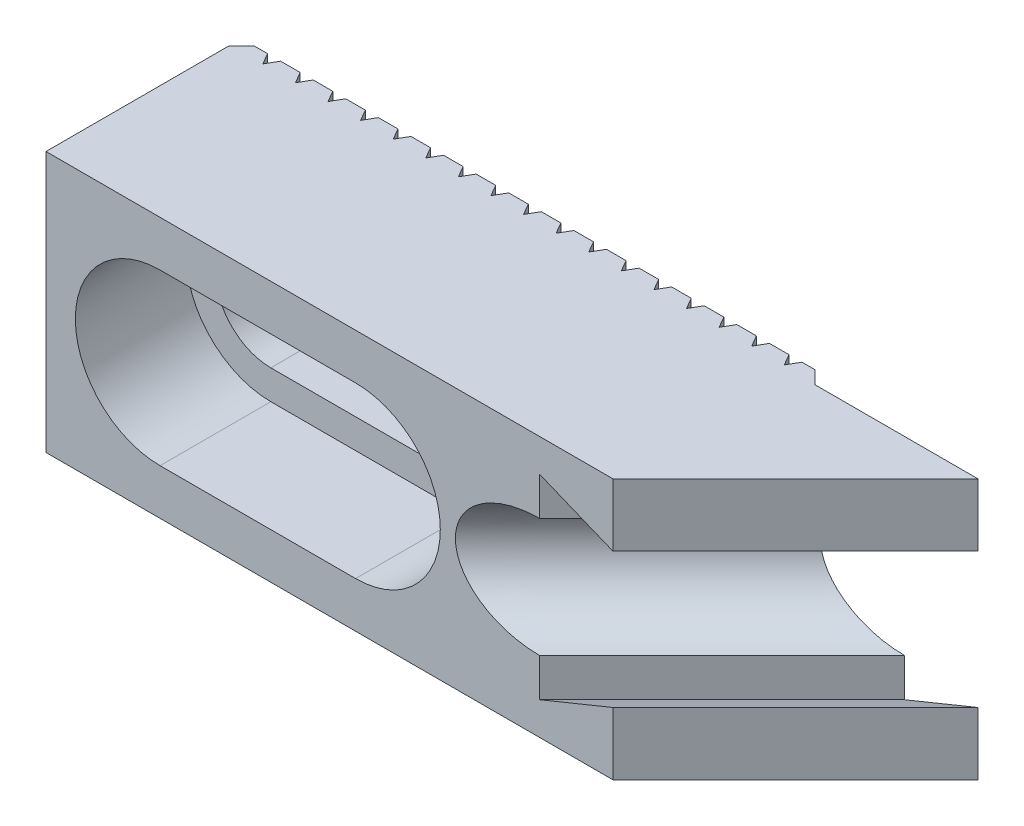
ISO-10303-21;
HEADER;
FILE_DESCRIPTION(('STEP AP214'),'2;1');
FILE_NAME('part.step','',(''),(''),'','','');
FILE_SCHEMA(('AUTOMOTIVE_DESIGN { 1 0 10303 214 1 1 1 1 }'));
ENDSEC;
DATA;
#1=APPLICATION_CONTEXT('core data for automotive mechanical design processes');
#2=APPLICATION_PROTOCOL_DEFINITION('international standard','automotive_design',2000,#1);
#3=PRODUCT_CONTEXT('',#1,'mechanical');
#4=PRODUCT('Part','Part','',(#3));
#5=PRODUCT_RELATED_PRODUCT_CATEGORY('part','',(#4));
#6=PRODUCT_DEFINITION_FORMATION('','',#4);
#7=PRODUCT_DEFINITION_CONTEXT('part definition',#1,'design');
#8=PRODUCT_DEFINITION('design','',#6,#7);
#9=PRODUCT_DEFINITION_SHAPE('','',#8);
#10=(LENGTH_UNIT() NAMED_UNIT(*) SI_UNIT(.MILLI.,.METRE.));
#11=(NAMED_UNIT(*) PLANE_ANGLE_UNIT() SI_UNIT($,.RADIAN.));
#12=(NAMED_UNIT(*) SI_UNIT($,.STERADIAN.) SOLID_ANGLE_UNIT());
#13=UNCERTAINTY_MEASURE_WITH_UNIT(LENGTH_MEASURE(1.E-05),#10,'distance_accuracy_value','');
#14=(GEOMETRIC_REPRESENTATION_CONTEXT(3) GLOBAL_UNCERTAINTY_ASSIGNED_CONTEXT((#13)) GLOBAL_UNIT_ASSIGNED_CONTEXT((#10,
#11,#12)) REPRESENTATION_CONTEXT('',''));
#15=CARTESIAN_POINT('',(0.,0.,0.));
#16=DIRECTION('',(0.,0.,1.));
#17=DIRECTION('',(1.,0.,0.));
#18=AXIS2_PLACEMENT_3D('',#15,#16,#17);
#19=CARTESIAN_POINT('',(-23.4988159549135,8.5,0.));
#20=DIRECTION('',(0.,0.,-1.));
#21=DIRECTION('',(-1.,0.,0.));
#22=AXIS2_PLACEMENT_3D('',#19,#20,#21);
#23=PLANE('',#22);
#24=CARTESIAN_POINT('',(-30.,0.,0.));
#25=DIRECTION('',(0.,0.,-1.));
#26=DIRECTION('',(-1.,0.,0.));
#27=AXIS2_PLACEMENT_3D('',#24,#25,#26);
#28=CIRCLE('',#27,8.5);
#29=CARTESIAN_POINT('',(-36.5011840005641,5.47582017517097,0.));
#30=VERTEX_POINT('',#29);
#31=CARTESIAN_POINT('',(-33.4988159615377,7.74650159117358,0.));
#32=VERTEX_POINT('',#31);
#33=EDGE_CURVE('E829',#30,#32,#28,.T.);
#34=ORIENTED_EDGE('',*,*,#33,.F.);
#35=DIRECTION('',(0.,1.,0.));
#36=VECTOR('',#35,1.);
#37=CARTESIAN_POINT('',(-36.5011840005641,-20.0050000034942,0.));
#38=LINE('',#37,#36);
#39=CARTESIAN_POINT('',(-36.5011840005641,11.2577947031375,0.));
#40=VERTEX_POINT('',#39);
#41=EDGE_CURVE('E1688',#30,#40,#38,.T.);
#42=ORIENTED_EDGE('',*,*,#41,.T.);
#43=CARTESIAN_POINT('',(-36.5011840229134,11.2577946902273,0.));
#44=DIRECTION('',(0.,1.,0.));
#45=VECTOR('',#44,1.);
#46=LINE('',#43,#45);
#47=CARTESIAN_POINT('',(-36.5011840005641,20.,0.));
#48=VERTEX_POINT('',#47);
#49=EDGE_CURVE('E1558',#40,#48,#46,.T.);
#50=ORIENTED_EDGE('',*,*,#49,.T.);
#51=CARTESIAN_POINT('',(-36.5011839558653,20.,0.));
#52=DIRECTION('',(1.,0.,0.));
#53=VECTOR('',#52,1.);
#54=LINE('',#51,#53);
#55=CARTESIAN_POINT('',(-33.4988159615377,20.,0.));
#56=VERTEX_POINT('',#55);
#57=EDGE_CURVE('E2047',#48,#56,#54,.T.);
#58=ORIENTED_EDGE('',*,*,#57,.T.);
#59=CARTESIAN_POINT('',(-33.4988159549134,12.5204500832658,0.));
#60=DIRECTION('',(0.,1.,0.));
#61=VECTOR('',#60,1.);
#62=LINE('',#59,#61);
#63=CARTESIAN_POINT('',(-33.4988159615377,12.5204500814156,0.));
#64=VERTEX_POINT('',#63);
#65=EDGE_CURVE('E1548',#64,#56,#62,.T.);
#66=ORIENTED_EDGE('',*,*,#65,.F.);
#67=DIRECTION('',(0.,1.,0.));
#68=VECTOR('',#67,1.);
#69=CARTESIAN_POINT('',(-33.4988159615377,-20.0050000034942,0.));
#70=LINE('',#69,#68);
#71=EDGE_CURVE('E1673',#32,#64,#70,.T.);
#72=ORIENTED_EDGE('',*,*,#71,.F.);
#73=EDGE_LOOP('',(#34,#42,#50,#58,#66,#72));
#74=FACE_BOUND('',#73,.T.);
#75=ADVANCED_FACE('F14',(#74),#23,.T.);
#76=CARTESIAN_POINT('',(-37.4999999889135,0.022721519,1.73));
#77=DIRECTION('',(0.866025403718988,0.,-0.500000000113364));
#78=DIRECTION('',(-0.500000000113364,0.,-0.866025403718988));
#79=AXIS2_PLACEMENT_3D('',#76,#77,#78);
#80=PLANE('',#79);
#81=CARTESIAN_POINT('',(-30.,0.,14.7203810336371));
#82=DIRECTION('',(0.866025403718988,0.,-0.500000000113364));
#83=DIRECTION('',(0.500000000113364,0.,0.866025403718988));
#84=AXIS2_PLACEMENT_3D('',#81,#82,#83);
#85=ELLIPSE('',#84,16.9999999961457,8.5);
#86=CARTESIAN_POINT('',(-37.4999999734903,-4.00000003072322,1.73000000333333));
#87=VERTEX_POINT('',#86);
#88=CARTESIAN_POINT('',(-38.4988159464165,-0.141871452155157,0.));
#89=VERTEX_POINT('',#88);
#90=EDGE_CURVE('E845',#87,#89,#85,.T.);
#91=ORIENTED_EDGE('',*,*,#90,.F.);
#92=DIRECTION('',(0.,1.,0.));
#93=VECTOR('',#92,1.);
#94=CARTESIAN_POINT('',(-37.4999999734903,-20.0050000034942,1.73000000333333));
#95=LINE('',#94,#93);
#96=CARTESIAN_POINT('',(-37.4999999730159,-10.6184313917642,1.73000002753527));
#97=VERTEX_POINT('',#96);
#98=EDGE_CURVE('E1690',#97,#87,#95,.T.);
#99=ORIENTED_EDGE('',*,*,#98,.F.);
#100=CARTESIAN_POINT('',(-37.4999999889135,-10.6184313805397,1.73));
#101=DIRECTION('',(0.,-1.,0.));
#102=VECTOR('',#101,1.);
#103=LINE('',#100,#102);
#104=CARTESIAN_POINT('',(-37.4999999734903,-20.,1.73000000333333));
#105=VERTEX_POINT('',#104);
#106=EDGE_CURVE('E1139',#97,#105,#103,.T.);
#107=ORIENTED_EDGE('',*,*,#106,.T.);
#108=DIRECTION('',(0.500000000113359,0.,0.866025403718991));
#109=VECTOR('',#108,1.);
#110=CARTESIAN_POINT('',(-38.4988159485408,-20.,1.10378477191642E-08));
#111=LINE('',#110,#109);
#112=CARTESIAN_POINT('',(-38.4988159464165,-20.,0.));
#113=VERTEX_POINT('',#112);
#114=EDGE_CURVE('E2493',#113,#105,#111,.T.);
#115=ORIENTED_EDGE('',*,*,#114,.F.);
#116=CARTESIAN_POINT('',(-38.4988159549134,-9.83734565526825,0.));
#117=DIRECTION('',(0.,-1.,0.));
#118=VECTOR('',#117,1.);
#119=LINE('',#116,#118);
#120=CARTESIAN_POINT('',(-38.4988159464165,-9.83734566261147,0.));
#121=VERTEX_POINT('',#120);
#122=EDGE_CURVE('E1603',#121,#113,#119,.T.);
#123=ORIENTED_EDGE('',*,*,#122,.F.);
#124=DIRECTION('',(0.,1.,0.));
#125=VECTOR('',#124,1.);
#126=CARTESIAN_POINT('',(-38.4988159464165,-20.0050000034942,0.));
#127=LINE('',#126,#125);
#128=EDGE_CURVE('E1693',#121,#89,#127,.T.);
#129=ORIENTED_EDGE('',*,*,#128,.T.);
#130=EDGE_LOOP('',(#91,#99,#107,#115,#123,#129));
#131=FACE_BOUND('',#130,.T.);
#132=ADVANCED_FACE('F2679',(#131),#80,.T.);
#133=CARTESIAN_POINT('',(-37.4999999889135,3.904,1.73));
#134=DIRECTION('',(0.866025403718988,0.,0.500000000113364));
#135=DIRECTION('',(0.500000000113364,0.,-0.866025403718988));
#136=AXIS2_PLACEMENT_3D('',#133,#134,#135);
#137=PLANE('',#136);
#138=ORIENTED_EDGE('',*,*,#98,.T.);
#139=CARTESIAN_POINT('',(-30.,0.,-11.2603810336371));
#140=DIRECTION('',(0.866025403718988,0.,0.500000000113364));
#141=DIRECTION('',(-0.500000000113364,0.,0.866025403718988));
#142=AXIS2_PLACEMENT_3D('',#139,#140,#141);
#143=ELLIPSE('',#142,16.9999999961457,8.5);
#144=CARTESIAN_POINT('',(-36.5011840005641,-5.47582015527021,0.));
#145=VERTEX_POINT('',#144);
#146=EDGE_CURVE('E836',#87,#145,#143,.T.);
#147=ORIENTED_EDGE('',*,*,#146,.T.);
#148=CARTESIAN_POINT('',(-36.5011840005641,-11.2577741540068,0.));
#149=VERTEX_POINT('',#148);
#150=EDGE_CURVE('E1686',#149,#145,#38,.T.);
#151=ORIENTED_EDGE('',*,*,#150,.F.);
#152=CARTESIAN_POINT('',(-36.5011840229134,-20.,0.));
#153=DIRECTION('',(0.,1.,0.));
#154=VECTOR('',#153,1.);
#155=LINE('',#152,#154);
#156=CARTESIAN_POINT('',(-36.5011840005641,-20.,0.));
#157=VERTEX_POINT('',#156);
#158=EDGE_CURVE('E1134',#157,#149,#155,.T.);
#159=ORIENTED_EDGE('',*,*,#158,.F.);
#160=DIRECTION('',(0.500000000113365,0.,-0.866025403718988));
#161=VECTOR('',#160,1.);
#162=CARTESIAN_POINT('',(-37.4999999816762,-20.,1.7299999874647));
#163=LINE('',#162,#161);
#164=EDGE_CURVE('E2484',#105,#157,#163,.T.);
#165=ORIENTED_EDGE('',*,*,#164,.F.);
#166=ORIENTED_EDGE('',*,*,#106,.F.);
#167=EDGE_LOOP('',(#138,#147,#151,#159,#165,#166));
#168=FACE_BOUND('',#167,.T.);
#169=ADVANCED_FACE('F2474',(#168),#137,.F.);
#170=CARTESIAN_POINT('',(-128.18003879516,9.09999999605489,186.366321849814));
#171=CARTESIAN_POINT('',(-128.602495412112,9.09996348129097,185.943865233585));
#172=CARTESIAN_POINT('',(-129.021271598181,9.04159847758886,185.525089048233));
#173=CARTESIAN_POINT('',(-129.849473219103,8.80869597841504,184.696887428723));
#174=CARTESIAN_POINT('',(-130.252393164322,8.63576988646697,184.29396748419));
#175=CARTESIAN_POINT('',(-131.032552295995,8.17884223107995,183.513808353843));
#176=CARTESIAN_POINT('',(-131.403875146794,7.89807350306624,183.142485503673));
#177=CARTESIAN_POINT('',(-132.106010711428,7.23468016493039,182.440349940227));
#178=CARTESIAN_POINT('',(-132.431466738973,6.85685858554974,182.114893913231));
#179=CARTESIAN_POINT('',(-133.028596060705,6.0124933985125,181.517764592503));
#180=CARTESIAN_POINT('',(-133.295678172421,5.55213843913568,181.250682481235));
#181=CARTESIAN_POINT('',(-133.76485390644,4.55924988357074,180.781506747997));
#182=CARTESIAN_POINT('',(-133.963298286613,4.03405272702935,180.583062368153));
#183=CARTESIAN_POINT('',(-134.286490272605,2.93079695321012,180.25987038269));
#184=CARTESIAN_POINT('',(-134.408670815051,2.36094063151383,180.137689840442));
#185=CARTESIAN_POINT('',(-134.573458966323,1.18971514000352,179.972901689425));
#186=CARTESIAN_POINT('',(-134.614680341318,0.597098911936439,179.931680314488));
#187=CARTESIAN_POINT('',(-134.61473194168,-0.597086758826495,179.9316287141));
#188=CARTESIAN_POINT('',(-134.57341003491,-1.1896889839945,179.972950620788));
#189=CARTESIAN_POINT('',(-134.408723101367,-2.36094294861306,180.137637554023));
#190=CARTESIAN_POINT('',(-134.286445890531,-2.93075779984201,180.259914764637));
#191=CARTESIAN_POINT('',(-133.963349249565,-4.03406942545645,180.583011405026));
#192=CARTESIAN_POINT('',(-133.76481577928,-4.55919923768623,180.781544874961));
#193=CARTESIAN_POINT('',(-133.295725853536,-5.55216887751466,181.25063479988));
#194=CARTESIAN_POINT('',(-133.028565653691,-6.01243320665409,181.517794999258));
#195=CARTESIAN_POINT('',(-132.431509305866,-6.85690159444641,182.114851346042));
#196=CARTESIAN_POINT('',(-132.105989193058,-7.23461274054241,182.440371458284));
#197=CARTESIAN_POINT('',(-131.403910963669,-7.89812742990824,183.142449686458));
#198=CARTESIAN_POINT('',(-131.032540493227,-8.17877016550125,183.513820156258));
#199=CARTESIAN_POINT('',(-130.252420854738,-8.6358326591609,184.293939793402));
#200=CARTESIAN_POINT('',(-129.84947158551,-8.80862204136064,184.696889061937));
#201=CARTESIAN_POINT('',(-129.021290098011,-9.0416676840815,185.525070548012));
#202=CARTESIAN_POINT('',(-128.602754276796,-9.09996347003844,185.943606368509));
#203=CARTESIAN_POINT('',(-128.180038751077,-9.10000000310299,186.366321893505));
#204=B_SPLINE_CURVE_WITH_KNOTS('',3,(#170,#171,#172,#173,#174,#175,#176,#177,#178,#179,#180,
#181,#182,#183,#184,#185,#186,#187,#188,#189,#190,#191,#192,#193,#194,#195,#196,#197,#198,#199,
#200,#201,#202,#203),.UNSPECIFIED.,.F.,.F.,(4,2,2,2,2,2,2,2,2,2,2,2,2,2,2,2,4),(0.,0.0625,0.125,
0.1875,0.25,0.3125,0.375,0.4375,0.5,0.5625,0.625,0.6875,0.75,0.8125,0.875,0.9375,1.),.UNSPECIFIED.);
#205=DIRECTION('',(0.707106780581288,1.52498014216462E-11,-0.707106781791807));
#206=VECTOR('',#205,1.);
#207=SURFACE_OF_LINEAR_EXTRUSION('',#204,#206);
#208=CARTESIAN_POINT('',(56.1862828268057,-9.09999999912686,1.99999999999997));
#209=CARTESIAN_POINT('',(56.0221524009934,-9.09999365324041,1.99999999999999));
#210=CARTESIAN_POINT('',(55.8580325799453,-9.09778966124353,2.));
#211=CARTESIAN_POINT('',(55.5299109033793,-9.08894684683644,2.));
#212=CARTESIAN_POINT('',(55.3659090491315,-9.0823079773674,2.));
#213=CARTESIAN_POINT('',(54.8738160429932,-9.05565735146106,2.));
#214=CARTESIAN_POINT('',(54.5460533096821,-9.02891137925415,2.));
#215=CARTESIAN_POINT('',(54.0558574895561,-8.97524329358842,2.));
#216=CARTESIAN_POINT('',(53.8926490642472,-8.95508725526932,2.));
#217=CARTESIAN_POINT('',(53.5668502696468,-8.91027081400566,2.));
#218=CARTESIAN_POINT('',(53.4042599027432,-8.88561039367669,2.));
#219=CARTESIAN_POINT('',(52.9143677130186,-8.80424021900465,2.));
#220=CARTESIAN_POINT('',(52.5882008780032,-8.74049483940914,2.));
#221=CARTESIAN_POINT('',(51.9403554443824,-8.59389655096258,2.));
#222=CARTESIAN_POINT('',(51.6186749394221,-8.51105203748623,2.));
#223=CARTESIAN_POINT('',(50.9810345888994,-8.3259791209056,2.));
#224=CARTESIAN_POINT('',(50.6650723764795,-8.22375894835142,2.));
#225=CARTESIAN_POINT('',(50.189537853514,-8.05280007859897,2.));
#226=CARTESIAN_POINT('',(50.0273090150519,-7.99137123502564,2.));
#227=CARTESIAN_POINT('',(49.7050927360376,-7.86291025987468,2.));
#228=CARTESIAN_POINT('',(49.5451051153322,-7.79587858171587,2.));
#229=CARTESIAN_POINT('',(49.227646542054,-7.65613341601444,2.));
#230=CARTESIAN_POINT('',(49.0701753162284,-7.58342055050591,2.));
#231=CARTESIAN_POINT('',(48.757976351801,-7.43222595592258,2.));
#232=CARTESIAN_POINT('',(48.6032495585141,-7.35374228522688,2.));
#233=CARTESIAN_POINT('',(48.144748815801,-7.10993066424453,2.));
#234=CARTESIAN_POINT('',(47.8455622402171,-6.93576512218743,2.00000000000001));
#235=CARTESIAN_POINT('',(47.4086146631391,-6.65628668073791,2.));
#236=CARTESIAN_POINT('',(47.2649430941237,-6.56009310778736,1.99999999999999));
#237=CARTESIAN_POINT('',(46.9819136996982,-6.36156369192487,2.00000000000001));
#238=CARTESIAN_POINT('',(46.8425555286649,-6.25922834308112,2.00000000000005));
#239=CARTESIAN_POINT('',(46.5024119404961,-5.997271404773,2.00000000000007));
#240=CARTESIAN_POINT('',(46.3045065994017,-5.83387626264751,2.00000000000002));
#241=CARTESIAN_POINT('',(45.9212265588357,-5.49298200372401,1.99999999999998));
#242=CARTESIAN_POINT('',(45.7358512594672,-5.31548356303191,2.));
#243=CARTESIAN_POINT('',(45.3797196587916,-4.94659535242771,2.));
#244=CARTESIAN_POINT('',(45.2089522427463,-4.75521635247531,1.99999999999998));
#245=CARTESIAN_POINT('',(44.884370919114,-4.35856152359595,2.00000000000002));
#246=CARTESIAN_POINT('',(44.7305533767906,-4.15328868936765,2.00000000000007));
#247=CARTESIAN_POINT('',(44.4717247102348,-3.7723148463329,2.00000000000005));
#248=CARTESIAN_POINT('',(44.3631368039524,-3.59903918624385,2.00000000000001));
#249=CARTESIAN_POINT('',(44.1597204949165,-3.24458146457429,1.99999999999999));
#250=CARTESIAN_POINT('',(44.0648905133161,-3.06340031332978,2.));
#251=CARTESIAN_POINT('',(43.8905693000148,-2.69387201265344,2.));
#252=CARTESIAN_POINT('',(43.8110713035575,-2.50552806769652,1.99999999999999));
#253=CARTESIAN_POINT('',(43.6687462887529,-2.12261931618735,2.00000000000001));
#254=CARTESIAN_POINT('',(43.6059195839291,-1.92805439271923,2.00000000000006));
#255=CARTESIAN_POINT('',(43.4975891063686,-1.53269880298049,2.00000000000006));
#256=CARTESIAN_POINT('',(43.4522075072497,-1.33187450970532,2.00000000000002));
#257=CARTESIAN_POINT('',(43.380506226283,-0.9268317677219,1.99999999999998));
#258=CARTESIAN_POINT('',(43.3541864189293,-0.72261334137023,2.));
#259=CARTESIAN_POINT('',(43.3212150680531,-0.312672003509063,2.));
#260=CARTESIAN_POINT('',(43.3145561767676,-0.106949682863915,2.));
#261=CARTESIAN_POINT('',(43.3208564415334,0.304186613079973,2.));
#262=CARTESIAN_POINT('',(43.3338142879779,0.509600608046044,2.));
#263=CARTESIAN_POINT('',(43.3767707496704,0.896098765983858,2.));
#264=CARTESIAN_POINT('',(43.4047715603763,1.07740825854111,2.));
#265=CARTESIAN_POINT('',(43.4757715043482,1.4370281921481,2.));
#266=CARTESIAN_POINT('',(43.5187682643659,1.61533910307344,2.));
#267=CARTESIAN_POINT('',(43.618910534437,1.96791946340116,2.));
#268=CARTESIAN_POINT('',(43.6760555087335,2.14218906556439,2.00000000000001));
#269=CARTESIAN_POINT('',(43.803755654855,2.48580159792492,1.99999999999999));
#270=CARTESIAN_POINT('',(43.8743156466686,2.65514273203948,1.99999999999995));
#271=CARTESIAN_POINT('',(44.0311523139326,2.99512867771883,1.99999999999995));
#272=CARTESIAN_POINT('',(44.1179688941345,3.16552383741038,1.99999999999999));
#273=CARTESIAN_POINT('',(44.3038670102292,3.49945770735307,2.00000000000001));
#274=CARTESIAN_POINT('',(44.4029483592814,3.66299652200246,2.));
#275=CARTESIAN_POINT('',(44.6123847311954,3.98298591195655,2.));
#276=CARTESIAN_POINT('',(44.7227548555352,4.13942657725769,2.00000000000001));
#277=CARTESIAN_POINT('',(44.9536007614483,4.4446341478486,1.99999999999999));
#278=CARTESIAN_POINT('',(45.0740758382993,4.59340158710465,1.99999999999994));
#279=CARTESIAN_POINT('',(45.2958030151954,4.85039741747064,1.99999999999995));
#280=CARTESIAN_POINT('',(45.3952501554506,4.96019224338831,1.99999999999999));
#281=CARTESIAN_POINT('',(45.5990423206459,5.17510704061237,2.00000000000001));
#282=CARTESIAN_POINT('',(45.703386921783,5.280227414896,2.));
#283=CARTESIAN_POINT('',(46.0230147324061,5.58835983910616,1.99999999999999));
#284=CARTESIAN_POINT('',(46.2450984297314,5.78438057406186,2.));
#285=CARTESIAN_POINT('',(46.7048720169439,6.15823911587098,2.));
#286=CARTESIAN_POINT('',(46.9425994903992,6.33603029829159,2.));
#287=CARTESIAN_POINT('',(47.43057439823,6.67360111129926,2.));
#288=CARTESIAN_POINT('',(47.6808258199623,6.83337495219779,2.));
#289=CARTESIAN_POINT('',(48.2890977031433,7.19266484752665,2.));
#290=CARTESIAN_POINT('',(48.6518733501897,7.38415144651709,2.));
#291=CARTESIAN_POINT('',(49.392587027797,7.7351245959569,2.));
#292=CARTESIAN_POINT('',(49.7705299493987,7.89460072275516,2.));
#293=CARTESIAN_POINT('',(50.5384542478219,8.18272195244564,2.));
#294=CARTESIAN_POINT('',(50.9284495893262,8.31132965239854,2.));
#295=CARTESIAN_POINT('',(51.7168770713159,8.53889612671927,2.));
#296=CARTESIAN_POINT('',(52.115307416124,8.6378611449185,2.));
#297=CARTESIAN_POINT('',(52.8190337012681,8.78589191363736,2.));
#298=CARTESIAN_POINT('',(53.1230282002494,8.8412450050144,2.));
#299=CARTESIAN_POINT('',(53.7334727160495,8.93592273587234,2.));
#300=CARTESIAN_POINT('',(54.0399224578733,8.97524914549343,2.));
#301=CARTESIAN_POINT('',(54.6526359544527,9.03783341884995,2.));
#302=CARTESIAN_POINT('',(54.958890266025,9.06118413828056,2.));
#303=CARTESIAN_POINT('',(55.5721925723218,9.09227653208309,2.));
#304=CARTESIAN_POINT('',(55.8792405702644,9.10001814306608,2.));
#305=CARTESIAN_POINT('',(56.1862827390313,9.10000000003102,2.));
#306=B_SPLINE_CURVE_WITH_KNOTS('',3,(#208,#209,#210,#211,#212,#213,#214,#215,#216,#217,#218,
#219,#220,#221,#222,#223,#224,#225,#226,#227,#228,#229,#230,#231,#232,#233,#234,#235,#236,#237,
#238,#239,#240,#241,#242,#243,#244,#245,#246,#247,#248,#249,#250,#251,#252,#253,#254,#255,#256,
#257,#258,#259,#260,#261,#262,#263,#264,#265,#266,#267,#268,#269,#270,#271,#272,#273,#274,#275,
#276,#277,#278,#279,#280,#281,#282,#283,#284,#285,#286,#287,#288,#289,#290,#291,#292,#293,#294,
#295,#296,#297,#298,#299,#300,#301,#302,#303,#304,#305),.UNSPECIFIED.,.F.,.F.,(4,2,2,2,2,2,2,2,
2,2,2,2,2,2,2,2,2,2,2,2,2,2,2,2,2,2,2,2,2,2,2,2,2,2,2,2,2,2,2,2,2,2,2,2,2,2,2,2,4),(0.,
0.492354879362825,0.984714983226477,1.97068118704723,2.46397526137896,2.95727123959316,
3.9536749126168,4.94964143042,5.94518581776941,6.46550649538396,6.98578510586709,
7.5060068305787,8.02640439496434,9.06363236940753,9.58220438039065,10.1007347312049,
10.8699891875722,11.6392067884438,12.4078338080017,13.1762956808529,13.7891989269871,
14.4020317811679,15.0145936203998,15.6271669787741,16.2439554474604,16.860739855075,
17.4772937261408,18.0938064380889,18.6435412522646,19.1931891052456,19.742816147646,
20.2926410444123,20.8657992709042,21.4389487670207,22.0128752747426,22.5867617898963,
23.0310156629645,23.4752311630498,24.3627217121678,25.2524283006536,26.1424199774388,
27.37126294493,28.6005054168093,29.8312299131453,31.0616949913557,31.9882612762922,
32.9147251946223,33.8357573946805,34.7567933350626),.UNSPECIFIED.);
#307=CARTESIAN_POINT('',(56.1862914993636,-9.09999997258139,2.));
#308=VERTEX_POINT('',#307);
#309=CARTESIAN_POINT('',(48.7427761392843,7.42344471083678,1.99999999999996));
#310=VERTEX_POINT('',#309);
#311=EDGE_CURVE('E41',#308,#310,#306,.T.);
#312=ORIENTED_EDGE('',*,*,#311,.T.);
#313=DIRECTION('',(0.707106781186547,6.8562368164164E-10,-0.707106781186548));
#314=VECTOR('',#313,1.);
#315=CARTESIAN_POINT('',(11.5351150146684,7.42344102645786,39.2076625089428));
#316=LINE('',#315,#314);
#317=CARTESIAN_POINT('',(20.7427761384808,7.42344468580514,30.));
#318=VERTEX_POINT('',#317);
#319=EDGE_CURVE('E896',#318,#310,#316,.T.);
#320=ORIENTED_EDGE('',*,*,#319,.F.);
#321=CARTESIAN_POINT('',(28.1862828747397,-9.09999999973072,30.));
#322=CARTESIAN_POINT('',(28.0221524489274,-9.09999365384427,30.));
#323=CARTESIAN_POINT('',(27.8580326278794,-9.09778966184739,30.));
#324=CARTESIAN_POINT('',(27.5299109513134,-9.08894684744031,30.));
#325=CARTESIAN_POINT('',(27.3659090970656,-9.08230797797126,30.));
#326=CARTESIAN_POINT('',(26.8738160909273,-9.05565735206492,30.));
#327=CARTESIAN_POINT('',(26.5460533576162,-9.02891137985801,30.));
#328=CARTESIAN_POINT('',(26.0558575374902,-8.97524329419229,30.));
#329=CARTESIAN_POINT('',(25.8926491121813,-8.95508725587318,30.));
#330=CARTESIAN_POINT('',(25.566850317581,-8.91027081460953,30.));
#331=CARTESIAN_POINT('',(25.4042599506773,-8.88561039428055,30.));
#332=CARTESIAN_POINT('',(24.9143677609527,-8.80424021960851,30.));
#333=CARTESIAN_POINT('',(24.5882009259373,-8.74049484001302,30.));
#334=CARTESIAN_POINT('',(23.9403554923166,-8.59389655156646,30.));
#335=CARTESIAN_POINT('',(23.6186749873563,-8.5110520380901,30.));
#336=CARTESIAN_POINT('',(22.9810346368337,-8.3259791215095,30.));
#337=CARTESIAN_POINT('',(22.6650724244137,-8.22375894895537,30.));
#338=CARTESIAN_POINT('',(22.1895379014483,-8.05280007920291,30.));
#339=CARTESIAN_POINT('',(22.0273090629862,-7.99137123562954,30.));
#340=CARTESIAN_POINT('',(21.7050927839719,-7.86291026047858,30.));
#341=CARTESIAN_POINT('',(21.5451051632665,-7.79587858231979,30.));
#342=CARTESIAN_POINT('',(21.2276465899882,-7.65613341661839,30.));
#343=CARTESIAN_POINT('',(21.0701753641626,-7.58342055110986,30.));
#344=CARTESIAN_POINT('',(20.7579763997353,-7.43222595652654,30.));
#345=CARTESIAN_POINT('',(20.6032496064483,-7.35374228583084,30.));
#346=CARTESIAN_POINT('',(20.1447488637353,-7.10993066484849,30.));
#347=CARTESIAN_POINT('',(19.8455622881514,-6.93576512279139,30.));
#348=CARTESIAN_POINT('',(19.4086147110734,-6.65628668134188,30.));
#349=CARTESIAN_POINT('',(19.264943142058,-6.56009310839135,30.));
#350=CARTESIAN_POINT('',(18.9819137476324,-6.36156369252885,30.));
#351=CARTESIAN_POINT('',(18.8425555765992,-6.2592283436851,30.));
#352=CARTESIAN_POINT('',(18.5024119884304,-5.99727140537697,30.));
#353=CARTESIAN_POINT('',(18.3045066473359,-5.83387626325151,30.));
#354=CARTESIAN_POINT('',(17.92122660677,-5.492982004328,30.));
#355=CARTESIAN_POINT('',(17.7358513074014,-5.31548356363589,30.));
#356=CARTESIAN_POINT('',(17.3797197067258,-4.94659535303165,30.));
#357=CARTESIAN_POINT('',(17.2089522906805,-4.75521635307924,30.));
#358=CARTESIAN_POINT('',(16.8843709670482,-4.35856152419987,30.));
#359=CARTESIAN_POINT('',(16.7305534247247,-4.15328868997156,30.));
#360=CARTESIAN_POINT('',(16.471724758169,-3.77231484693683,30.));
#361=CARTESIAN_POINT('',(16.3631368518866,-3.59903918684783,30.));
#362=CARTESIAN_POINT('',(16.1597205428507,-3.24458146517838,30.));
#363=CARTESIAN_POINT('',(16.0648905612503,-3.06340031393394,30.));
#364=CARTESIAN_POINT('',(15.890569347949,-2.69387201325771,30.));
#365=CARTESIAN_POINT('',(15.8110713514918,-2.50552806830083,30.));
#366=CARTESIAN_POINT('',(15.6687463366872,-2.12261931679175,30.));
#367=CARTESIAN_POINT('',(15.6059196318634,-1.92805439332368,30.));
#368=CARTESIAN_POINT('',(15.4975891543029,-1.53269880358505,30.));
#369=CARTESIAN_POINT('',(15.452207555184,-1.33187451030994,30.));
#370=CARTESIAN_POINT('',(15.3805062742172,-0.926831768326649,30.));
#371=CARTESIAN_POINT('',(15.3541864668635,-0.722613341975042,30.));
#372=CARTESIAN_POINT('',(15.3212151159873,-0.312672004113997,30.));
#373=CARTESIAN_POINT('',(15.3145562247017,-0.106949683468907,30.));
#374=CARTESIAN_POINT('',(15.3208564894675,0.304186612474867,30.));
#375=CARTESIAN_POINT('',(15.3338143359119,0.509600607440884,30.));
#376=CARTESIAN_POINT('',(15.3767707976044,0.896098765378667,30.));
#377=CARTESIAN_POINT('',(15.4047716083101,1.07740825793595,30.));
#378=CARTESIAN_POINT('',(15.475771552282,1.43702819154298,30.));
#379=CARTESIAN_POINT('',(15.5187683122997,1.61533910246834,30.));
#380=CARTESIAN_POINT('',(15.6189105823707,1.9679194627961,30.));
#381=CARTESIAN_POINT('',(15.6760555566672,2.14218906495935,30.));
#382=CARTESIAN_POINT('',(15.8037557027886,2.48580159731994,30.));
#383=CARTESIAN_POINT('',(15.8743156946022,2.65514273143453,30.));
#384=CARTESIAN_POINT('',(16.0311523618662,2.99512867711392,30.));
#385=CARTESIAN_POINT('',(16.1179689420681,3.16552383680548,30.));
#386=CARTESIAN_POINT('',(16.3038670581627,3.49945770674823,30.));
#387=CARTESIAN_POINT('',(16.402948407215,3.66299652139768,30.));
#388=CARTESIAN_POINT('',(16.6123847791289,3.98298591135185,30.));
#389=CARTESIAN_POINT('',(16.7227549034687,4.13942657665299,30.));
#390=CARTESIAN_POINT('',(16.9536008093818,4.44463414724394,30.));
#391=CARTESIAN_POINT('',(17.0740758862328,4.59340158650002,30.));
#392=CARTESIAN_POINT('',(17.2958030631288,4.85039741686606,30.));
#393=CARTESIAN_POINT('',(17.3952502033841,4.96019224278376,30.));
#394=CARTESIAN_POINT('',(17.5990423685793,5.17510704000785,30.));
#395=CARTESIAN_POINT('',(17.7033869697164,5.28022741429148,30.));
#396=CARTESIAN_POINT('',(18.0230147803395,5.58835983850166,30.));
#397=CARTESIAN_POINT('',(18.2450984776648,5.78438057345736,30.));
#398=CARTESIAN_POINT('',(18.7048720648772,6.15823911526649,30.));
#399=CARTESIAN_POINT('',(18.9425995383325,6.33603029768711,30.));
#400=CARTESIAN_POINT('',(19.4305744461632,6.67360111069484,30.));
#401=CARTESIAN_POINT('',(19.6808258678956,6.83337495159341,30.));
#402=CARTESIAN_POINT('',(20.2890977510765,7.1926648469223,30.));
#403=CARTESIAN_POINT('',(20.6518733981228,7.38415144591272,30.));
#404=CARTESIAN_POINT('',(21.3925870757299,7.73512459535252,30.));
#405=CARTESIAN_POINT('',(21.7705299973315,7.89460072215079,30.));
#406=CARTESIAN_POINT('',(22.5384542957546,8.18272195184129,30.));
#407=CARTESIAN_POINT('',(22.9284496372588,8.31132965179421,30.));
#408=CARTESIAN_POINT('',(23.7168771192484,8.53889612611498,30.));
#409=CARTESIAN_POINT('',(24.1153074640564,8.63786114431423,30.));
#410=CARTESIAN_POINT('',(24.8190337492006,8.78589191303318,30.));
#411=CARTESIAN_POINT('',(25.123028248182,8.84124500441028,30.));
#412=CARTESIAN_POINT('',(25.7334727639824,8.93592273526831,30.));
#413=CARTESIAN_POINT('',(26.0399225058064,8.97524914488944,30.));
#414=CARTESIAN_POINT('',(26.652636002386,9.03783341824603,30.));
#415=CARTESIAN_POINT('',(26.9588903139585,9.06118413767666,30.));
#416=CARTESIAN_POINT('',(27.5721926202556,9.09227653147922,30.));
#417=CARTESIAN_POINT('',(27.8792406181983,9.10001814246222,30.));
#418=CARTESIAN_POINT('',(28.1862827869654,9.09999999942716,30.));
#419=B_SPLINE_CURVE_WITH_KNOTS('',3,(#321,#322,#323,#324,#325,#326,#327,#328,#329,#330,#331,
#332,#333,#334,#335,#336,#337,#338,#339,#340,#341,#342,#343,#344,#345,#346,#347,#348,#349,#350,
#351,#352,#353,#354,#355,#356,#357,#358,#359,#360,#361,#362,#363,#364,#365,#366,#367,#368,#369,
#370,#371,#372,#373,#374,#375,#376,#377,#378,#379,#380,#381,#382,#383,#384,#385,#386,#387,#388,
#389,#390,#391,#392,#393,#394,#395,#396,#397,#398,#399,#400,#401,#402,#403,#404,#405,#406,#407,
#408,#409,#410,#411,#412,#413,#414,#415,#416,#417,#418),.UNSPECIFIED.,.F.,.F.,(4,2,2,2,2,2,2,2,
2,2,2,2,2,2,2,2,2,2,2,2,2,2,2,2,2,2,2,2,2,2,2,2,2,2,2,2,2,2,2,2,2,2,2,2,2,2,2,2,4),(0.,
0.492354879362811,0.984714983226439,1.97068118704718,2.46397526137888,2.95727123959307,
3.95367491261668,4.94964143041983,5.94518581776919,6.46550649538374,6.98578510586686,
7.50600683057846,8.02640439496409,9.06363236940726,9.58220438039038,10.1007347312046,
10.869989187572,11.6392067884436,12.4078338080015,13.1762956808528,13.7891989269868,
14.4020317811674,15.0145936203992,15.6271669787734,16.2439554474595,16.8607398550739,
17.4772937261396,18.0938064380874,18.6435412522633,19.1931891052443,19.7428161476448,
20.2926410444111,20.865799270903,21.4389487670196,22.0128752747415,22.5867617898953,
23.0310156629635,23.4752311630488,24.3627217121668,25.2524283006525,26.1424199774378,
27.3712629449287,28.6005054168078,29.8312299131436,31.0616949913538,31.9882612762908,
32.9147251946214,33.83575739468,34.7567933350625),.UNSPECIFIED.);
#420=CARTESIAN_POINT('',(28.1862914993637,-9.09999999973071,30.));
#421=VERTEX_POINT('',#420);
#422=EDGE_CURVE('E34',#421,#318,#419,.T.);
#423=ORIENTED_EDGE('',*,*,#422,.F.);
#424=DIRECTION('',(0.707106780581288,1.52498014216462E-11,-0.707106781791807));
#425=VECTOR('',#424,1.);
#426=CARTESIAN_POINT('',(-128.180038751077,-9.10000000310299,186.366321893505));
#427=LINE('',#426,#425);
#428=EDGE_CURVE('E1746',#421,#308,#427,.T.);
#429=ORIENTED_EDGE('',*,*,#428,.T.);
#430=EDGE_LOOP('',(#312,#320,#423,#429));
#431=FACE_BOUND('',#430,.T.);
#432=ADVANCED_FACE('F930',(#431),#207,.T.);
#433=CARTESIAN_POINT('',(-33.4988159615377,-7.74650158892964,0.));
#434=VERTEX_POINT('',#433);
#435=EDGE_CURVE('E832',#434,#145,#28,.T.);
#436=ORIENTED_EDGE('',*,*,#435,.F.);
#437=CARTESIAN_POINT('',(-33.4988159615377,-12.5204633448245,0.));
#438=VERTEX_POINT('',#437);
#439=EDGE_CURVE('E1670',#438,#434,#70,.T.);
#440=ORIENTED_EDGE('',*,*,#439,.F.);
#441=CARTESIAN_POINT('',(-33.4988159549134,-20.,0.));
#442=DIRECTION('',(0.,1.,0.));
#443=VECTOR('',#442,1.);
#444=LINE('',#441,#443);
#445=CARTESIAN_POINT('',(-33.4988159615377,-20.,0.));
#446=VERTEX_POINT('',#445);
#447=EDGE_CURVE('E1127',#446,#438,#444,.T.);
#448=ORIENTED_EDGE('',*,*,#447,.F.);
#449=CARTESIAN_POINT('',(-36.5011839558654,-20.,0.));
#450=DIRECTION('',(1.,0.,0.));
#451=VECTOR('',#450,1.);
#452=LINE('',#449,#451);
#453=EDGE_CURVE('E2477',#157,#446,#452,.T.);
#454=ORIENTED_EDGE('',*,*,#453,.F.);
#455=ORIENTED_EDGE('',*,*,#158,.T.);
#456=ORIENTED_EDGE('',*,*,#150,.T.);
#457=EDGE_LOOP('',(#436,#440,#448,#454,#455,#456));
#458=FACE_BOUND('',#457,.T.);
#459=ADVANCED_FACE('F2476',(#458),#23,.T.);
#460=CARTESIAN_POINT('',(-30.,0.,0.));
#461=DIRECTION('',(0.,0.,-1.));
#462=DIRECTION('',(-1.,0.,0.));
#463=AXIS2_PLACEMENT_3D('',#460,#461,#462);
#464=CIRCLE('',#463,8.5);
#465=CARTESIAN_POINT('',(-30.,-8.5,0.));
#466=VERTEX_POINT('',#465);
#467=CARTESIAN_POINT('',(-31.5011840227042,-8.36638790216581,0.));
#468=VERTEX_POINT('',#467);
#469=EDGE_CURVE('E2471',#466,#468,#464,.T.);
#470=ORIENTED_EDGE('',*,*,#469,.F.);
#471=DIRECTION('',(-1.,0.,0.));
#472=VECTOR('',#471,1.);
#473=CARTESIAN_POINT('',(-23.4988159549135,-8.5,0.));
#474=LINE('',#473,#472);
#475=CARTESIAN_POINT('',(-28.4988159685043,-8.5,-4.70800720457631E-09));
#476=VERTEX_POINT('',#475);
#477=EDGE_CURVE('E806',#476,#466,#474,.T.);
#478=ORIENTED_EDGE('',*,*,#477,.F.);
#479=DIRECTION('',(0.,1.,0.));
#480=VECTOR('',#479,1.);
#481=CARTESIAN_POINT('',(-28.4988159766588,-20.0050000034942,0.));
#482=LINE('',#481,#480);
#483=CARTESIAN_POINT('',(-28.4988159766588,-13.0000000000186,0.));
#484=VERTEX_POINT('',#483);
#485=EDGE_CURVE('E1647',#484,#476,#482,.T.);
#486=ORIENTED_EDGE('',*,*,#485,.F.);
#487=CARTESIAN_POINT('',(-28.4988159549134,-20.,0.));
#488=DIRECTION('',(0.,1.,0.));
#489=VECTOR('',#488,1.);
#490=LINE('',#487,#489);
#491=CARTESIAN_POINT('',(-28.4988159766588,-20.,0.));
#492=VERTEX_POINT('',#491);
#493=EDGE_CURVE('E1109',#492,#484,#490,.T.);
#494=ORIENTED_EDGE('',*,*,#493,.F.);
#495=CARTESIAN_POINT('',(-31.5011840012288,-20.,0.));
#496=DIRECTION('',(1.,0.,0.));
#497=VECTOR('',#496,1.);
#498=LINE('',#495,#497);
#499=CARTESIAN_POINT('',(-31.5011840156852,-20.,0.));
#500=VERTEX_POINT('',#499);
#501=EDGE_CURVE('E2482',#500,#492,#498,.T.);
#502=ORIENTED_EDGE('',*,*,#501,.F.);
#503=CARTESIAN_POINT('',(-31.5011840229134,-20.,0.));
#504=DIRECTION('',(0.,1.,0.));
#505=VECTOR('',#504,1.);
#506=LINE('',#503,#505);
#507=CARTESIAN_POINT('',(-31.5011840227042,-12.9131476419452,0.));
#508=VERTEX_POINT('',#507);
#509=EDGE_CURVE('E1116',#500,#508,#506,.T.);
#510=ORIENTED_EDGE('',*,*,#509,.T.);
#511=DIRECTION('',(0.,1.,0.));
#512=VECTOR('',#511,1.);
#513=CARTESIAN_POINT('',(-31.5011840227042,-20.0050000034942,0.));
#514=LINE('',#513,#512);
#515=EDGE_CURVE('E2314',#508,#468,#514,.T.);
#516=ORIENTED_EDGE('',*,*,#515,.T.);
#517=EDGE_LOOP('',(#470,#478,#486,#494,#502,#510,#516));
#518=FACE_BOUND('',#517,.T.);
#519=ADVANCED_FACE('F2697',(#518),#23,.T.);
#520=CARTESIAN_POINT('',(-30.,0.,0.));
#521=DIRECTION('',(0.,0.,-1.));
#522=DIRECTION('',(-1.,0.,0.));
#523=AXIS2_PLACEMENT_3D('',#520,#521,#522);
#524=CIRCLE('',#523,8.5);
#525=CARTESIAN_POINT('',(-31.5011840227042,8.36638790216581,0.));
#526=VERTEX_POINT('',#525);
#527=CARTESIAN_POINT('',(-30.,8.5,0.));
#528=VERTEX_POINT('',#527);
#529=EDGE_CURVE('E827',#526,#528,#524,.T.);
#530=ORIENTED_EDGE('',*,*,#529,.F.);
#531=CARTESIAN_POINT('',(-31.5011840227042,12.9131820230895,0.));
#532=VERTEX_POINT('',#531);
#533=EDGE_CURVE('E2313',#526,#532,#514,.T.);
#534=ORIENTED_EDGE('',*,*,#533,.T.);
#535=CARTESIAN_POINT('',(-31.5011840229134,12.9131820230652,0.));
#536=DIRECTION('',(0.,1.,0.));
#537=VECTOR('',#536,1.);
#538=LINE('',#535,#537);
#539=CARTESIAN_POINT('',(-31.5011840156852,20.,0.));
#540=VERTEX_POINT('',#539);
#541=EDGE_CURVE('E1581',#532,#540,#538,.T.);
#542=ORIENTED_EDGE('',*,*,#541,.T.);
#543=CARTESIAN_POINT('',(-31.5011840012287,20.,0.));
#544=DIRECTION('',(1.,0.,0.));
#545=VECTOR('',#544,1.);
#546=LINE('',#543,#545);
#547=CARTESIAN_POINT('',(-28.4988159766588,20.,0.));
#548=VERTEX_POINT('',#547);
#549=EDGE_CURVE('E2051',#540,#548,#546,.T.);
#550=ORIENTED_EDGE('',*,*,#549,.T.);
#551=CARTESIAN_POINT('',(-28.4988159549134,13.0000000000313,0.));
#552=DIRECTION('',(0.,1.,0.));
#553=VECTOR('',#552,1.);
#554=LINE('',#551,#553);
#555=CARTESIAN_POINT('',(-28.4988159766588,13.0000000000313,0.));
#556=VERTEX_POINT('',#555);
#557=EDGE_CURVE('E1582',#556,#548,#554,.T.);
#558=ORIENTED_EDGE('',*,*,#557,.F.);
#559=CARTESIAN_POINT('',(-28.4988159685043,8.5,-4.70800720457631E-09));
#560=VERTEX_POINT('',#559);
#561=EDGE_CURVE('E1648',#560,#556,#482,.T.);
#562=ORIENTED_EDGE('',*,*,#561,.F.);
#563=DIRECTION('',(1.,0.,0.));
#564=VECTOR('',#563,1.);
#565=CARTESIAN_POINT('',(-23.4988159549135,8.5,0.));
#566=LINE('',#565,#564);
#567=EDGE_CURVE('E823',#528,#560,#566,.T.);
#568=ORIENTED_EDGE('',*,*,#567,.F.);
#569=EDGE_LOOP('',(#530,#534,#542,#550,#558,#562,#568));
#570=FACE_BOUND('',#569,.T.);
#571=ADVANCED_FACE('F2461',(#570),#23,.T.);
#572=DIRECTION('',(0.,1.,0.));
#573=VECTOR('',#572,1.);
#574=CARTESIAN_POINT('',(-26.5011840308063,-20.0050000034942,0.));
#575=LINE('',#574,#573);
#576=CARTESIAN_POINT('',(-26.5011840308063,-13.0000000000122,0.));
#577=VERTEX_POINT('',#576);
#578=CARTESIAN_POINT('',(-26.5011840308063,-8.5,0.));
#579=VERTEX_POINT('',#578);
#580=EDGE_CURVE('E1662',#577,#579,#575,.T.);
#581=ORIENTED_EDGE('',*,*,#580,.T.);
#582=DIRECTION('',(-1.,0.,0.));
#583=VECTOR('',#582,1.);
#584=CARTESIAN_POINT('',(-23.4988159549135,-8.5,0.));
#585=LINE('',#584,#583);
#586=CARTESIAN_POINT('',(-23.4988159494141,-8.5,1.90502897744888E-09));
#587=VERTEX_POINT('',#586);
#588=EDGE_CURVE('E5107',#587,#579,#585,.T.);
#589=ORIENTED_EDGE('',*,*,#588,.F.);
#590=CARTESIAN_POINT('',(-23.4988159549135,-20.,0.));
#591=DIRECTION('',(0.,1.,0.));
#592=VECTOR('',#591,1.);
#593=LINE('',#590,#592);
#594=CARTESIAN_POINT('',(-23.4988159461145,-20.,0.));
#595=VERTEX_POINT('',#594);
#596=EDGE_CURVE('E1091',#595,#587,#593,.T.);
#597=ORIENTED_EDGE('',*,*,#596,.F.);
#598=CARTESIAN_POINT('',(-26.5011840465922,-20.,0.));
#599=DIRECTION('',(1.,0.,0.));
#600=VECTOR('',#599,1.);
#601=LINE('',#598,#600);
#602=CARTESIAN_POINT('',(-26.5011840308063,-20.,0.));
#603=VERTEX_POINT('',#602);
#604=EDGE_CURVE('E3557',#603,#595,#601,.T.);
#605=ORIENTED_EDGE('',*,*,#604,.F.);
#606=CARTESIAN_POINT('',(-26.5011840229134,-20.,0.));
#607=DIRECTION('',(0.,1.,0.));
#608=VECTOR('',#607,1.);
#609=LINE('',#606,#608);
#610=EDGE_CURVE('E1099',#603,#577,#609,.T.);
#611=ORIENTED_EDGE('',*,*,#610,.T.);
#612=EDGE_LOOP('',(#581,#589,#597,#605,#611));
#613=FACE_BOUND('',#612,.T.);
#614=ADVANCED_FACE('F2752',(#613),#23,.T.);
#615=CARTESIAN_POINT('',(-26.5011840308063,8.5,0.));
#616=VERTEX_POINT('',#615);
#617=CARTESIAN_POINT('',(-26.5011840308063,13.0000000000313,0.));
#618=VERTEX_POINT('',#617);
#619=EDGE_CURVE('E1661',#616,#618,#575,.T.);
#620=ORIENTED_EDGE('',*,*,#619,.T.);
#621=CARTESIAN_POINT('',(-26.5011840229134,13.0000000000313,0.));
#622=DIRECTION('',(0.,1.,0.));
#623=VECTOR('',#622,1.);
#624=LINE('',#621,#623);
#625=CARTESIAN_POINT('',(-26.5011840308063,20.,0.));
#626=VERTEX_POINT('',#625);
#627=EDGE_CURVE('E2431',#618,#626,#624,.T.);
#628=ORIENTED_EDGE('',*,*,#627,.T.);
#629=CARTESIAN_POINT('',(-26.5011840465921,20.,0.));
#630=DIRECTION('',(1.,0.,0.));
#631=VECTOR('',#630,1.);
#632=LINE('',#629,#631);
#633=CARTESIAN_POINT('',(-23.4988159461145,20.,0.));
#634=VERTEX_POINT('',#633);
#635=EDGE_CURVE('E2520',#626,#634,#632,.T.);
#636=ORIENTED_EDGE('',*,*,#635,.T.);
#637=CARTESIAN_POINT('',(-23.4988159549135,8.5,0.));
#638=DIRECTION('',(0.,1.,0.));
#639=VECTOR('',#638,1.);
#640=LINE('',#637,#639);
#641=CARTESIAN_POINT('',(-23.4988159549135,8.5,0.));
#642=VERTEX_POINT('',#641);
#643=EDGE_CURVE('E2427',#642,#634,#640,.T.);
#644=ORIENTED_EDGE('',*,*,#643,.F.);
#645=DIRECTION('',(1.,0.,0.));
#646=VECTOR('',#645,1.);
#647=CARTESIAN_POINT('',(-23.4988159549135,8.5,0.));
#648=LINE('',#647,#646);
#649=EDGE_CURVE('E1145',#616,#642,#648,.T.);
#650=ORIENTED_EDGE('',*,*,#649,.F.);
#651=EDGE_LOOP('',(#620,#628,#636,#644,#650));
#652=FACE_BOUND('',#651,.T.);
#653=ADVANCED_FACE('F2083',(#652),#23,.T.);
#654=CARTESIAN_POINT('',(11.5011840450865,-20.,0.));
#655=DIRECTION('',(0.,0.,-1.));
#656=DIRECTION('',(-1.,0.,0.));
#657=AXIS2_PLACEMENT_3D('',#654,#655,#656);
#658=PLANE('',#657);
#659=DIRECTION('',(0.,1.,0.));
#660=VECTOR('',#659,1.);
#661=CARTESIAN_POINT('',(11.5011840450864,-20.0050000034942,0.));
#662=LINE('',#661,#660);
#663=CARTESIAN_POINT('',(11.5011840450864,-6.06025013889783,0.));
#664=VERTEX_POINT('',#663);
#665=CARTESIAN_POINT('',(11.5011840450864,6.06024973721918,0.));
#666=VERTEX_POINT('',#665);
#667=EDGE_CURVE('E2298',#664,#666,#662,.T.);
#668=ORIENTED_EDGE('',*,*,#667,.F.);
#669=CARTESIAN_POINT('',(11.5011840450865,-20.,0.));
#670=DIRECTION('',(0.,1.,0.));
#671=VECTOR('',#670,1.);
#672=LINE('',#669,#671);
#673=CARTESIAN_POINT('',(11.5011840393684,-20.,0.));
#674=VERTEX_POINT('',#673);
#675=EDGE_CURVE('E2253',#674,#664,#672,.T.);
#676=ORIENTED_EDGE('',*,*,#675,.F.);
#677=CARTESIAN_POINT('',(8.4988159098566,-20.,0.));
#678=DIRECTION('',(1.,0.,0.));
#679=VECTOR('',#678,1.);
#680=LINE('',#677,#679);
#681=CARTESIAN_POINT('',(8.49881595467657,-20.,0.));
#682=VERTEX_POINT('',#681);
#683=EDGE_CURVE('E2292',#682,#674,#680,.T.);
#684=ORIENTED_EDGE('',*,*,#683,.F.);
#685=CARTESIAN_POINT('',(8.49881597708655,-20.,0.));
#686=DIRECTION('',(0.,1.,0.));
#687=VECTOR('',#686,1.);
#688=LINE('',#685,#687);
#689=CARTESIAN_POINT('',(8.49881595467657,-9.8373465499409,0.));
#690=VERTEX_POINT('',#689);
#691=EDGE_CURVE('E2280',#682,#690,#688,.T.);
#692=ORIENTED_EDGE('',*,*,#691,.T.);
#693=DIRECTION('',(0.,1.,0.));
#694=VECTOR('',#693,1.);
#695=CARTESIAN_POINT('',(8.49881595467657,-20.0050000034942,0.));
#696=LINE('',#695,#694);
#697=CARTESIAN_POINT('',(8.49881595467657,-0.141870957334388,0.));
#698=VERTEX_POINT('',#697);
#699=EDGE_CURVE('E2290',#690,#698,#696,.T.);
#700=ORIENTED_EDGE('',*,*,#699,.T.);
#701=CARTESIAN_POINT('',(0.,0.,0.));
#702=DIRECTION('',(0.,0.,-1.));
#703=DIRECTION('',(1.,0.,0.));
#704=AXIS2_PLACEMENT_3D('',#701,#702,#703);
#705=CIRCLE('',#704,8.5);
#706=CARTESIAN_POINT('',(8.49881595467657,0.141870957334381,0.));
#707=VERTEX_POINT('',#706);
#708=EDGE_CURVE('E2294',#707,#698,#705,.T.);
#709=ORIENTED_EDGE('',*,*,#708,.F.);
#710=CARTESIAN_POINT('',(8.49881595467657,9.83734557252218,0.));
#711=VERTEX_POINT('',#710);
#712=EDGE_CURVE('E2293',#707,#711,#696,.T.);
#713=ORIENTED_EDGE('',*,*,#712,.T.);
#714=CARTESIAN_POINT('',(8.49881597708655,9.83734555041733,0.));
#715=DIRECTION('',(0.,1.,0.));
#716=VECTOR('',#715,1.);
#717=LINE('',#714,#716);
#718=CARTESIAN_POINT('',(8.49881595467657,20.,0.));
#719=VERTEX_POINT('',#718);
#720=EDGE_CURVE('E1997',#711,#719,#717,.T.);
#721=ORIENTED_EDGE('',*,*,#720,.T.);
#722=CARTESIAN_POINT('',(8.49881590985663,20.,0.));
#723=DIRECTION('',(1.,0.,0.));
#724=VECTOR('',#723,1.);
#725=LINE('',#722,#724);
#726=CARTESIAN_POINT('',(11.5011840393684,20.,0.));
#727=VERTEX_POINT('',#726);
#728=EDGE_CURVE('E1635',#719,#727,#725,.T.);
#729=ORIENTED_EDGE('',*,*,#728,.T.);
#730=CARTESIAN_POINT('',(11.5011840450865,6.06024973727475,0.));
#731=DIRECTION('',(0.,1.,0.));
#732=VECTOR('',#731,1.);
#733=LINE('',#730,#732);
#734=EDGE_CURVE('E2240',#666,#727,#733,.T.);
#735=ORIENTED_EDGE('',*,*,#734,.F.);
#736=EDGE_LOOP('',(#668,#676,#684,#692,#700,#709,#713,#721,#729,#735));
#737=FACE_BOUND('',#736,.T.);
#738=ADVANCED_FACE('F2288',(#737),#658,.T.);
#739=DIRECTION('',(0.,1.,0.));
#740=VECTOR('',#739,1.);
#741=CARTESIAN_POINT('',(6.50118405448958,-20.0050000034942,0.));
#742=LINE('',#741,#740);
#743=CARTESIAN_POINT('',(6.50118405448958,-11.2577750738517,0.));
#744=VERTEX_POINT('',#743);
#745=CARTESIAN_POINT('',(6.50118405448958,-5.47582011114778,0.));
#746=VERTEX_POINT('',#745);
#747=EDGE_CURVE('E2647',#744,#746,#742,.T.);
#748=ORIENTED_EDGE('',*,*,#747,.F.);
#749=CARTESIAN_POINT('',(6.50118404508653,-20.,0.));
#750=DIRECTION('',(0.,1.,0.));
#751=VECTOR('',#750,1.);
#752=LINE('',#749,#751);
#753=CARTESIAN_POINT('',(6.50118405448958,-20.,0.));
#754=VERTEX_POINT('',#753);
#755=EDGE_CURVE('E981',#754,#744,#752,.T.);
#756=ORIENTED_EDGE('',*,*,#755,.F.);
#757=CARTESIAN_POINT('',(3.49881595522,-20.,0.));
#758=DIRECTION('',(1.,0.,0.));
#759=VECTOR('',#758,1.);
#760=LINE('',#757,#759);
#761=CARTESIAN_POINT('',(3.49881596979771,-20.,0.));
#762=VERTEX_POINT('',#761);
#763=EDGE_CURVE('E2594',#762,#754,#760,.T.);
#764=ORIENTED_EDGE('',*,*,#763,.F.);
#765=CARTESIAN_POINT('',(3.49881597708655,-20.,0.));
#766=DIRECTION('',(0.,1.,0.));
#767=VECTOR('',#766,1.);
#768=LINE('',#765,#767);
#769=CARTESIAN_POINT('',(3.49881596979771,-12.5204627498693,0.));
#770=VERTEX_POINT('',#769);
#771=EDGE_CURVE('E988',#762,#770,#768,.T.);
#772=ORIENTED_EDGE('',*,*,#771,.T.);
#773=DIRECTION('',(0.,1.,0.));
#774=VECTOR('',#773,1.);
#775=CARTESIAN_POINT('',(3.49881596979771,-20.0050000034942,0.));
#776=LINE('',#775,#774);
#777=CARTESIAN_POINT('',(3.49881596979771,-7.74650158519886,0.));
#778=VERTEX_POINT('',#777);
#779=EDGE_CURVE('E2650',#770,#778,#776,.T.);
#780=ORIENTED_EDGE('',*,*,#779,.T.);
#781=EDGE_CURVE('E5050',#746,#778,#705,.T.);
#782=ORIENTED_EDGE('',*,*,#781,.F.);
#783=EDGE_LOOP('',(#748,#756,#764,#772,#780,#782));
#784=FACE_BOUND('',#783,.T.);
#785=ADVANCED_FACE('F2771',(#784),#658,.T.);
#786=CARTESIAN_POINT('',(6.50118405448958,5.47582011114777,0.));
#787=VERTEX_POINT('',#786);
#788=CARTESIAN_POINT('',(6.50118405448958,11.2577740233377,0.));
#789=VERTEX_POINT('',#788);
#790=EDGE_CURVE('E2648',#787,#789,#742,.T.);
#791=ORIENTED_EDGE('',*,*,#790,.F.);
#792=CARTESIAN_POINT('',(3.49881596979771,7.74650158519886,0.));
#793=VERTEX_POINT('',#792);
#794=EDGE_CURVE('E2627',#793,#787,#705,.T.);
#795=ORIENTED_EDGE('',*,*,#794,.F.);
#796=CARTESIAN_POINT('',(3.49881596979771,12.5204634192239,0.));
#797=VERTEX_POINT('',#796);
#798=EDGE_CURVE('E2654',#793,#797,#776,.T.);
#799=ORIENTED_EDGE('',*,*,#798,.T.);
#800=CARTESIAN_POINT('',(3.49881597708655,12.5204634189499,0.));
#801=DIRECTION('',(0.,1.,0.));
#802=VECTOR('',#801,1.);
#803=LINE('',#800,#802);
#804=CARTESIAN_POINT('',(3.49881596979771,20.,0.));
#805=VERTEX_POINT('',#804);
#806=EDGE_CURVE('E2538',#797,#805,#803,.T.);
#807=ORIENTED_EDGE('',*,*,#806,.T.);
#808=CARTESIAN_POINT('',(3.49881595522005,20.,0.));
#809=DIRECTION('',(1.,0.,0.));
#810=VECTOR('',#809,1.);
#811=LINE('',#808,#810);
#812=CARTESIAN_POINT('',(6.50118405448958,20.,0.));
#813=VERTEX_POINT('',#812);
#814=EDGE_CURVE('E2034',#805,#813,#811,.T.);
#815=ORIENTED_EDGE('',*,*,#814,.T.);
#816=CARTESIAN_POINT('',(6.50118404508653,11.2577740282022,0.));
#817=DIRECTION('',(0.,1.,0.));
#818=VECTOR('',#817,1.);
#819=LINE('',#816,#818);
#820=EDGE_CURVE('E2005',#789,#813,#819,.T.);
#821=ORIENTED_EDGE('',*,*,#820,.F.);
#822=EDGE_LOOP('',(#791,#795,#799,#807,#815,#821));
#823=FACE_BOUND('',#822,.T.);
#824=ADVANCED_FACE('F2666',(#823),#658,.T.);
#825=DIRECTION('',(0.,1.,0.));
#826=VECTOR('',#825,1.);
#827=CARTESIAN_POINT('',(1.50118402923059,-20.0050000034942,0.));
#828=LINE('',#827,#826);
#829=CARTESIAN_POINT('',(1.50118402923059,-12.9131502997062,0.));
#830=VERTEX_POINT('',#829);
#831=CARTESIAN_POINT('',(1.50118402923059,-8.36638790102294,0.));
#832=VERTEX_POINT('',#831);
#833=EDGE_CURVE('E2316',#830,#832,#828,.T.);
#834=ORIENTED_EDGE('',*,*,#833,.F.);
#835=CARTESIAN_POINT('',(1.50118404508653,-20.,0.));
#836=DIRECTION('',(0.,1.,0.));
#837=VECTOR('',#836,1.);
#838=LINE('',#835,#837);
#839=CARTESIAN_POINT('',(1.50118402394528,-20.,0.));
#840=VERTEX_POINT('',#839);
#841=EDGE_CURVE('E998',#840,#830,#838,.T.);
#842=ORIENTED_EDGE('',*,*,#841,.F.);
#843=CARTESIAN_POINT('',(-1.5011839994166,-20.,0.));
#844=DIRECTION('',(1.,0.,0.));
#845=VECTOR('',#844,1.);
#846=LINE('',#843,#845);
#847=CARTESIAN_POINT('',(-1.50118401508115,-20.,0.));
#848=VERTEX_POINT('',#847);
#849=EDGE_CURVE('E2567',#848,#840,#846,.T.);
#850=ORIENTED_EDGE('',*,*,#849,.F.);
#851=CARTESIAN_POINT('',(-1.50118402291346,-20.,0.));
#852=DIRECTION('',(0.,1.,0.));
#853=VECTOR('',#852,1.);
#854=LINE('',#851,#853);
#855=CARTESIAN_POINT('',(-1.50118401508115,-13.,0.));
#856=VERTEX_POINT('',#855);
#857=EDGE_CURVE('E1005',#848,#856,#854,.T.);
#858=ORIENTED_EDGE('',*,*,#857,.T.);
#859=DIRECTION('',(0.,1.,0.));
#860=VECTOR('',#859,1.);
#861=CARTESIAN_POINT('',(-1.50118401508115,-20.0050000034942,0.));
#862=LINE('',#861,#860);
#863=CARTESIAN_POINT('',(-1.50118401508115,-8.5,0.));
#864=VERTEX_POINT('',#863);
#865=EDGE_CURVE('E2337',#856,#864,#862,.T.);
#866=ORIENTED_EDGE('',*,*,#865,.T.);
#867=DIRECTION('',(-1.,0.,0.));
#868=VECTOR('',#867,1.);
#869=CARTESIAN_POINT('',(11.5011840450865,-8.5,0.));
#870=LINE('',#869,#868);
#871=CARTESIAN_POINT('',(0.,-8.5,0.));
#872=VERTEX_POINT('',#871);
#873=EDGE_CURVE('E2626',#872,#864,#870,.T.);
#874=ORIENTED_EDGE('',*,*,#873,.F.);
#875=EDGE_CURVE('E2623',#832,#872,#705,.T.);
#876=ORIENTED_EDGE('',*,*,#875,.F.);
#877=EDGE_LOOP('',(#834,#842,#850,#858,#866,#874,#876));
#878=FACE_BOUND('',#877,.T.);
#879=ADVANCED_FACE('F2784',(#878),#658,.T.);
#880=CARTESIAN_POINT('',(1.10865344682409E-08,-13.,13.));
#881=DIRECTION('',(0.,1.,0.));
#882=DIRECTION('',(-1.,0.,0.));
#883=AXIS2_PLACEMENT_3D('',#880,#881,#882);
#884=PLANE('',#883);
#885=DIRECTION('',(1.,0.,0.));
#886=VECTOR('',#885,1.);
#887=CARTESIAN_POINT('',(-47.4999999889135,-13.,30.));
#888=LINE('',#887,#886);
#889=CARTESIAN_POINT('',(0.,-13.,30.));
#890=VERTEX_POINT('',#889);
#891=CARTESIAN_POINT('',(-30.,-13.,30.));
#892=VERTEX_POINT('',#891);
#893=EDGE_CURVE('E2614',#890,#892,#888,.F.);
#894=ORIENTED_EDGE('',*,*,#893,.F.);
#895=DIRECTION('',(0.,0.,1.));
#896=VECTOR('',#895,1.);
#897=CARTESIAN_POINT('',(0.,-13.,-48.7413961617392));
#898=LINE('',#897,#896);
#899=CARTESIAN_POINT('',(0.,-13.,13.));
#900=VERTEX_POINT('',#899);
#901=EDGE_CURVE('E1716',#900,#890,#898,.T.);
#902=ORIENTED_EDGE('',*,*,#901,.F.);
#903=DIRECTION('',(-1.,0.,0.));
#904=VECTOR('',#903,1.);
#905=CARTESIAN_POINT('',(1.10865344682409E-08,-13.,13.));
#906=LINE('',#905,#904);
#907=CARTESIAN_POINT('',(-30.,-13.0000000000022,13.));
#908=VERTEX_POINT('',#907);
#909=EDGE_CURVE('E2617',#900,#908,#906,.T.);
#910=ORIENTED_EDGE('',*,*,#909,.T.);
#911=DIRECTION('',(0.,0.,1.));
#912=VECTOR('',#911,1.);
#913=CARTESIAN_POINT('',(-30.,-13.,-48.7413961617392));
#914=LINE('',#913,#912);
#915=EDGE_CURVE('E1727',#908,#892,#914,.T.);
#916=ORIENTED_EDGE('',*,*,#915,.T.);
#917=EDGE_LOOP('',(#894,#902,#910,#916));
#918=FACE_BOUND('',#917,.T.);
#919=ADVANCED_FACE('F2791',(#918),#884,.T.);
#920=CARTESIAN_POINT('',(1.10865344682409E-08,13.,13.));
#921=DIRECTION('',(0.,1.,0.));
#922=DIRECTION('',(-1.,0.,0.));
#923=AXIS2_PLACEMENT_3D('',#920,#921,#922);
#924=PLANE('',#923);
#925=DIRECTION('',(1.,0.,0.));
#926=VECTOR('',#925,1.);
#927=CARTESIAN_POINT('',(-43.3812693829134,13.,13.));
#928=LINE('',#927,#926);
#929=CARTESIAN_POINT('',(0.,13.0000000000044,13.));
#930=VERTEX_POINT('',#929);
#931=CARTESIAN_POINT('',(-30.,13.0000000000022,13.));
#932=VERTEX_POINT('',#931);
#933=EDGE_CURVE('E2619',#930,#932,#928,.F.);
#934=ORIENTED_EDGE('',*,*,#933,.F.);
#935=DIRECTION('',(0.,0.,1.));
#936=VECTOR('',#935,1.);
#937=CARTESIAN_POINT('',(0.,13.0000000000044,-48.7413961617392));
#938=LINE('',#937,#936);
#939=CARTESIAN_POINT('',(0.,13.0000000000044,30.));
#940=VERTEX_POINT('',#939);
#941=EDGE_CURVE('E1724',#930,#940,#938,.T.);
#942=ORIENTED_EDGE('',*,*,#941,.T.);
#943=DIRECTION('',(1.,0.,0.));
#944=VECTOR('',#943,1.);
#945=CARTESIAN_POINT('',(-47.4999999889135,13.,30.));
#946=LINE('',#945,#944);
#947=CARTESIAN_POINT('',(-30.,13.0000000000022,30.));
#948=VERTEX_POINT('',#947);
#949=EDGE_CURVE('E2606',#948,#940,#946,.T.);
#950=ORIENTED_EDGE('',*,*,#949,.F.);
#951=DIRECTION('',(0.,0.,1.));
#952=VECTOR('',#951,1.);
#953=CARTESIAN_POINT('',(-30.,13.0000000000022,-48.7413961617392));
#954=LINE('',#953,#952);
#955=EDGE_CURVE('E1730',#932,#948,#954,.T.);
#956=ORIENTED_EDGE('',*,*,#955,.F.);
#957=EDGE_LOOP('',(#934,#942,#950,#956));
#958=FACE_BOUND('',#957,.T.);
#959=ADVANCED_FACE('F929',(#958),#924,.F.);
#960=CARTESIAN_POINT('',(-122.523180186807,19.9999999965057,192.023180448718));
#961=DIRECTION('',(0.707106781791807,-1.54113073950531E-10,0.707106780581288));
#962=DIRECTION('',(-0.707106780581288,0.,0.707106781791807));
#963=AXIS2_PLACEMENT_3D('',#960,#961,#962);
#964=PLANE('',#963);
#965=CARTESIAN_POINT('',(67.500000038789,10.3811978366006,1.99999989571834));
#966=DIRECTION('',(2.17957455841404E-10,1.,0.));
#967=VECTOR('',#966,1.);
#968=LINE('',#965,#967);
#969=CARTESIAN_POINT('',(67.4999999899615,10.3811978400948,1.99999994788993));
#970=VERTEX_POINT('',#969);
#971=CARTESIAN_POINT('',(67.4999999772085,20.,1.99999994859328));
#972=VERTEX_POINT('',#971);
#973=EDGE_CURVE('E962',#970,#972,#968,.T.);
#974=ORIENTED_EDGE('',*,*,#973,.T.);
#975=DIRECTION('',(0.707106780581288,1.52498014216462E-11,-0.707106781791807));
#976=VECTOR('',#975,1.);
#977=CARTESIAN_POINT('',(-122.523180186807,19.9999999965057,192.023180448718));
#978=LINE('',#977,#976);
#979=CARTESIAN_POINT('',(39.5000000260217,20.,29.9999999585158));
#980=VERTEX_POINT('',#979);
#981=EDGE_CURVE('E1754',#980,#972,#978,.T.);
#982=ORIENTED_EDGE('',*,*,#981,.F.);
#983=CARTESIAN_POINT('',(39.5000000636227,20.0000000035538,29.9999999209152));
#984=DIRECTION('',(-2.17957455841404E-10,-1.,0.));
#985=VECTOR('',#984,1.);
#986=LINE('',#983,#985);
#987=CARTESIAN_POINT('',(39.499999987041,10.3811978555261,29.9999999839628));
#988=VERTEX_POINT('',#987);
#989=EDGE_CURVE('E1776',#980,#988,#986,.T.);
#990=ORIENTED_EDGE('',*,*,#989,.T.);
#991=DIRECTION('',(0.707106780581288,1.52498014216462E-11,-0.707106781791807));
#992=VECTOR('',#991,1.);
#993=CARTESIAN_POINT('',(-122.523180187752,10.3811978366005,192.023180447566));
#994=LINE('',#993,#992);
#995=EDGE_CURVE('E1752',#988,#970,#994,.T.);
#996=ORIENTED_EDGE('',*,*,#995,.T.);
#997=EDGE_LOOP('',(#974,#982,#990,#996));
#998=FACE_BOUND('',#997,.T.);
#999=ADVANCED_FACE('F927',(#998),#964,.T.);
#1000=CARTESIAN_POINT('',(-122.523180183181,-10.3811978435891,192.023180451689));
#1001=DIRECTION('',(0.707106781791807,-4.85027904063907E-10,0.707106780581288));
#1002=DIRECTION('',(-0.707106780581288,0.,0.707106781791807));
#1003=AXIS2_PLACEMENT_3D('',#1000,#1001,#1002);
#1004=PLANE('',#1003);
#1005=CARTESIAN_POINT('',(39.5000000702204,-10.381197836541,29.9999999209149));
#1006=DIRECTION('',(-6.85939532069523E-10,-1.,0.));
#1007=VECTOR('',#1006,1.);
#1008=LINE('',#1005,#1007);
#1009=CARTESIAN_POINT('',(39.4999999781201,-10.3811978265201,30.0000000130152));
#1010=VERTEX_POINT('',#1009);
#1011=CARTESIAN_POINT('',(39.5000000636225,-20.,29.9999999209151));
#1012=VERTEX_POINT('',#1011);
#1013=EDGE_CURVE('E2613',#1010,#1012,#1008,.T.);
#1014=ORIENTED_EDGE('',*,*,#1013,.T.);
#1015=DIRECTION('',(0.707106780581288,1.52498014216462E-11,-0.707106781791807));
#1016=VECTOR('',#1015,1.);
#1017=CARTESIAN_POINT('',(-122.523180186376,-20.0000000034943,192.023180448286));
#1018=LINE('',#1017,#1016);
#1019=CARTESIAN_POINT('',(67.4999999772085,-20.,1.99999994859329));
#1020=VERTEX_POINT('',#1019);
#1021=EDGE_CURVE('E957',#1012,#1020,#1018,.T.);
#1022=ORIENTED_EDGE('',*,*,#1021,.T.);
#1023=CARTESIAN_POINT('',(67.5000000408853,-20.0000000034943,1.99999989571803));
#1024=DIRECTION('',(6.85939532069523E-10,1.,0.));
#1025=VECTOR('',#1024,1.);
#1026=LINE('',#1023,#1025);
#1027=CARTESIAN_POINT('',(67.4999999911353,-10.3811977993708,2.));
#1028=VERTEX_POINT('',#1027);
#1029=EDGE_CURVE('E954',#1020,#1028,#1026,.T.);
#1030=ORIENTED_EDGE('',*,*,#1029,.T.);
#1031=DIRECTION('',(0.707106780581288,1.52498014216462E-11,-0.707106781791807));
#1032=VECTOR('',#1031,1.);
#1033=CARTESIAN_POINT('',(-122.523180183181,-10.3811978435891,192.023180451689));
#1034=LINE('',#1033,#1032);
#1035=EDGE_CURVE('E955',#1010,#1028,#1034,.T.);
#1036=ORIENTED_EDGE('',*,*,#1035,.F.);
#1037=EDGE_LOOP('',(#1014,#1022,#1030,#1036));
#1038=FACE_BOUND('',#1037,.T.);
#1039=ADVANCED_FACE('F923',(#1038),#1004,.T.);
#1040=CARTESIAN_POINT('',(-29.0311631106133,-8.5,-4.40668871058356));
#1041=DIRECTION('',(0.,-1.,0.));
#1042=DIRECTION('',(1.,0.,0.));
#1043=AXIS2_PLACEMENT_3D('',#1040,#1041,#1042);
#1044=PLANE('',#1043);
#1045=DIRECTION('',(-1.,0.,0.));
#1046=VECTOR('',#1045,1.);
#1047=CARTESIAN_POINT('',(-18.4988159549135,-8.5,0.));
#1048=LINE('',#1047,#1046);
#1049=CARTESIAN_POINT('',(-18.4988159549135,-8.5,0.));
#1050=VERTEX_POINT('',#1049);
#1051=CARTESIAN_POINT('',(-21.5011840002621,-8.5,0.));
#1052=VERTEX_POINT('',#1051);
#1053=EDGE_CURVE('E5094',#1050,#1052,#1048,.T.);
#1054=ORIENTED_EDGE('',*,*,#1053,.T.);
#1055=DIRECTION('',(0.500000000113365,0.,-0.866025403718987));
#1056=VECTOR('',#1055,1.);
#1057=CARTESIAN_POINT('',(-22.4999999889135,-8.5,1.73));
#1058=LINE('',#1057,#1056);
#1059=CARTESIAN_POINT('',(-22.4999999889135,-8.5,1.73));
#1060=VERTEX_POINT('',#1059);
#1061=EDGE_CURVE('E5098',#1060,#1052,#1058,.T.);
#1062=ORIENTED_EDGE('',*,*,#1061,.F.);
#1063=DIRECTION('',(-0.500000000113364,0.,-0.866025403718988));
#1064=VECTOR('',#1063,1.);
#1065=CARTESIAN_POINT('',(-22.4999999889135,-8.5,1.73));
#1066=LINE('',#1065,#1064);
#1067=EDGE_CURVE('E5103',#1060,#587,#1066,.T.);
#1068=ORIENTED_EDGE('',*,*,#1067,.T.);
#1069=ORIENTED_EDGE('',*,*,#588,.T.);
#1070=DIRECTION('',(-0.500000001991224,0.,0.866025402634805));
#1071=VECTOR('',#1070,1.);
#1072=CARTESIAN_POINT('',(-25.225526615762,-8.5,-2.20950344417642));
#1073=LINE('',#1072,#1071);
#1074=CARTESIAN_POINT('',(-27.4999999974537,-8.5,1.72999999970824));
#1075=VERTEX_POINT('',#1074);
#1076=EDGE_CURVE('E1664',#579,#1075,#1073,.T.);
#1077=ORIENTED_EDGE('',*,*,#1076,.T.);
#1078=DIRECTION('',(-0.500000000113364,0.,-0.866025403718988));
#1079=VECTOR('',#1078,1.);
#1080=CARTESIAN_POINT('',(-27.4999999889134,-8.5,1.73));
#1081=LINE('',#1080,#1079);
#1082=EDGE_CURVE('E816',#1075,#476,#1081,.T.);
#1083=ORIENTED_EDGE('',*,*,#1082,.T.);
#1084=ORIENTED_EDGE('',*,*,#477,.T.);
#1085=DIRECTION('',(0.,0.,1.));
#1086=VECTOR('',#1085,1.);
#1087=CARTESIAN_POINT('',(-30.,-8.5,-0.005000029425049));
#1088=LINE('',#1087,#1086);
#1089=CARTESIAN_POINT('',(-30.,-8.5,13.));
#1090=VERTEX_POINT('',#1089);
#1091=EDGE_CURVE('E803',#466,#1090,#1088,.T.);
#1092=ORIENTED_EDGE('',*,*,#1091,.T.);
#1093=DIRECTION('',(1.,0.,0.));
#1094=VECTOR('',#1093,1.);
#1095=CARTESIAN_POINT('',(-29.0311631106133,-8.5,13.));
#1096=LINE('',#1095,#1094);
#1097=CARTESIAN_POINT('',(0.,-8.5,13.));
#1098=VERTEX_POINT('',#1097);
#1099=EDGE_CURVE('E789',#1090,#1098,#1096,.T.);
#1100=ORIENTED_EDGE('',*,*,#1099,.T.);
#1101=DIRECTION('',(0.,0.,1.));
#1102=VECTOR('',#1101,1.);
#1103=CARTESIAN_POINT('',(0.,-8.5,-0.005000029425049));
#1104=LINE('',#1103,#1102);
#1105=EDGE_CURVE('E1707',#872,#1098,#1104,.T.);
#1106=ORIENTED_EDGE('',*,*,#1105,.F.);
#1107=ORIENTED_EDGE('',*,*,#873,.T.);
#1108=DIRECTION('',(-0.500000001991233,0.,0.8660254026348));
#1109=VECTOR('',#1108,1.);
#1110=CARTESIAN_POINT('',(-6.47552665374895,-8.5,8.61581413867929));
#1111=LINE('',#1110,#1109);
#1112=CARTESIAN_POINT('',(-2.49999998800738,-8.5,1.73000000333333));
#1113=VERTEX_POINT('',#1112);
#1114=EDGE_CURVE('E1706',#864,#1113,#1111,.T.);
#1115=ORIENTED_EDGE('',*,*,#1114,.T.);
#1116=DIRECTION('',(-0.50000000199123,0.,-0.866025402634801));
#1117=VECTOR('',#1116,1.);
#1118=CARTESIAN_POINT('',(-11.7900549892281,-8.5,-14.3608471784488));
#1119=LINE('',#1118,#1117);
#1120=CARTESIAN_POINT('',(-3.49439296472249,-8.5,0.00766085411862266));
#1121=VERTEX_POINT('',#1120);
#1122=EDGE_CURVE('E2341',#1113,#1121,#1119,.T.);
#1123=ORIENTED_EDGE('',*,*,#1122,.T.);
#1124=DIRECTION('',(-0.500000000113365,0.,-0.866025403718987));
#1125=VECTOR('',#1124,1.);
#1126=CARTESIAN_POINT('',(-2.49999998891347,-8.5,1.73));
#1127=LINE('',#1126,#1125);
#1128=CARTESIAN_POINT('',(-3.49881595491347,-8.5,0.));
#1129=VERTEX_POINT('',#1128);
#1130=EDGE_CURVE('E1800',#1121,#1129,#1127,.T.);
#1131=ORIENTED_EDGE('',*,*,#1130,.T.);
#1132=DIRECTION('',(-1.,0.,0.));
#1133=VECTOR('',#1132,1.);
#1134=CARTESIAN_POINT('',(-3.49881595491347,-8.5,0.));
#1135=LINE('',#1134,#1133);
#1136=CARTESIAN_POINT('',(-6.50118402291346,-8.5,0.));
#1137=VERTEX_POINT('',#1136);
#1138=EDGE_CURVE('E1803',#1129,#1137,#1135,.T.);
#1139=ORIENTED_EDGE('',*,*,#1138,.T.);
#1140=DIRECTION('',(0.500000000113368,0.,-0.866025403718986));
#1141=VECTOR('',#1140,1.);
#1142=CARTESIAN_POINT('',(-7.49999998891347,-8.5,1.73));
#1143=LINE('',#1142,#1141);
#1144=CARTESIAN_POINT('',(-7.49999998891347,-8.5,1.73));
#1145=VERTEX_POINT('',#1144);
#1146=EDGE_CURVE('E5058',#1145,#1137,#1143,.T.);
#1147=ORIENTED_EDGE('',*,*,#1146,.F.);
#1148=DIRECTION('',(-0.500000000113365,0.,-0.866025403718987));
#1149=VECTOR('',#1148,1.);
#1150=CARTESIAN_POINT('',(-7.49999998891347,-8.5,1.73));
#1151=LINE('',#1150,#1149);
#1152=CARTESIAN_POINT('',(-8.49881594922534,-8.5,1.97042664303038E-09));
#1153=VERTEX_POINT('',#1152);
#1154=EDGE_CURVE('E5061',#1145,#1153,#1151,.T.);
#1155=ORIENTED_EDGE('',*,*,#1154,.T.);
#1156=DIRECTION('',(-1.,0.,0.));
#1157=VECTOR('',#1156,1.);
#1158=CARTESIAN_POINT('',(-8.49881595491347,-8.5,0.));
#1159=LINE('',#1158,#1157);
#1160=CARTESIAN_POINT('',(-11.5011840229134,-8.5,0.));
#1161=VERTEX_POINT('',#1160);
#1162=EDGE_CURVE('E5063',#1153,#1161,#1159,.T.);
#1163=ORIENTED_EDGE('',*,*,#1162,.T.);
#1164=DIRECTION('',(0.500000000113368,0.,-0.866025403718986));
#1165=VECTOR('',#1164,1.);
#1166=CARTESIAN_POINT('',(-12.4999999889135,-8.5,1.73));
#1167=LINE('',#1166,#1165);
#1168=CARTESIAN_POINT('',(-12.4999999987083,-8.5,1.73000000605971));
#1169=VERTEX_POINT('',#1168);
#1170=EDGE_CURVE('E5072',#1169,#1161,#1167,.T.);
#1171=ORIENTED_EDGE('',*,*,#1170,.F.);
#1172=DIRECTION('',(-0.500000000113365,0.,-0.866025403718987));
#1173=VECTOR('',#1172,1.);
#1174=CARTESIAN_POINT('',(-12.4999999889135,-8.5,1.73));
#1175=LINE('',#1174,#1173);
#1176=CARTESIAN_POINT('',(-13.4988159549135,-8.5,0.));
#1177=VERTEX_POINT('',#1176);
#1178=EDGE_CURVE('E5077',#1169,#1177,#1175,.T.);
#1179=ORIENTED_EDGE('',*,*,#1178,.T.);
#1180=DIRECTION('',(-1.,0.,0.));
#1181=VECTOR('',#1180,1.);
#1182=CARTESIAN_POINT('',(-13.4988159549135,-8.5,0.));
#1183=LINE('',#1182,#1181);
#1184=CARTESIAN_POINT('',(-16.5011840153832,-8.5,0.));
#1185=VERTEX_POINT('',#1184);
#1186=EDGE_CURVE('E5081',#1177,#1185,#1183,.T.);
#1187=ORIENTED_EDGE('',*,*,#1186,.T.);
#1188=DIRECTION('',(0.500000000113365,0.,-0.866025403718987));
#1189=VECTOR('',#1188,1.);
#1190=CARTESIAN_POINT('',(-17.4999999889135,-8.5,1.73));
#1191=LINE('',#1190,#1189);
#1192=CARTESIAN_POINT('',(-17.4999999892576,-8.5,1.73000000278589));
#1193=VERTEX_POINT('',#1192);
#1194=EDGE_CURVE('E5085',#1193,#1185,#1191,.T.);
#1195=ORIENTED_EDGE('',*,*,#1194,.F.);
#1196=DIRECTION('',(-0.500000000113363,0.,-0.866025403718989));
#1197=VECTOR('',#1196,1.);
#1198=CARTESIAN_POINT('',(-17.4999999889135,-8.5,1.73));
#1199=LINE('',#1198,#1197);
#1200=EDGE_CURVE('E5090',#1193,#1050,#1199,.T.);
#1201=ORIENTED_EDGE('',*,*,#1200,.T.);
#1202=EDGE_LOOP('',(#1054,#1062,#1068,#1069,#1077,#1083,#1084,#1092,#1100,#1106,#1107,#1115,
#1123,#1131,#1139,#1147,#1155,#1163,#1171,#1179,#1187,#1195,#1201));
#1203=FACE_BOUND('',#1202,.T.);
#1204=ADVANCED_FACE('F804',(#1203),#1044,.F.);
#1205=CARTESIAN_POINT('',(-29.0311631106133,8.5,-4.40668871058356));
#1206=DIRECTION('',(0.,1.,0.));
#1207=DIRECTION('',(-1.,0.,0.));
#1208=AXIS2_PLACEMENT_3D('',#1205,#1206,#1207);
#1209=PLANE('',#1208);
#1210=DIRECTION('',(-1.,0.,0.));
#1211=VECTOR('',#1210,1.);
#1212=CARTESIAN_POINT('',(-29.0311631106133,8.5,13.));
#1213=LINE('',#1212,#1211);
#1214=CARTESIAN_POINT('',(0.,8.5,13.));
#1215=VERTEX_POINT('',#1214);
#1216=CARTESIAN_POINT('',(-30.,8.5,13.));
#1217=VERTEX_POINT('',#1216);
#1218=EDGE_CURVE('E800',#1215,#1217,#1213,.T.);
#1219=ORIENTED_EDGE('',*,*,#1218,.T.);
#1220=DIRECTION('',(0.,0.,1.));
#1221=VECTOR('',#1220,1.);
#1222=CARTESIAN_POINT('',(-30.,8.5,-0.005000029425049));
#1223=LINE('',#1222,#1221);
#1224=EDGE_CURVE('E809',#528,#1217,#1223,.T.);
#1225=ORIENTED_EDGE('',*,*,#1224,.F.);
#1226=ORIENTED_EDGE('',*,*,#567,.T.);
#1227=DIRECTION('',(0.500000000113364,0.,0.866025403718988));
#1228=VECTOR('',#1227,1.);
#1229=CARTESIAN_POINT('',(-27.4999999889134,8.5,1.73));
#1230=LINE('',#1229,#1228);
#1231=CARTESIAN_POINT('',(-27.4999999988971,8.5,1.7300000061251));
#1232=VERTEX_POINT('',#1231);
#1233=EDGE_CURVE('E820',#560,#1232,#1230,.T.);
#1234=ORIENTED_EDGE('',*,*,#1233,.T.);
#1235=DIRECTION('',(0.500000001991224,0.,-0.866025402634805));
#1236=VECTOR('',#1235,1.);
#1237=CARTESIAN_POINT('',(-25.225526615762,8.5,-2.20950344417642));
#1238=LINE('',#1237,#1236);
#1239=EDGE_CURVE('E1667',#1232,#616,#1238,.T.);
#1240=ORIENTED_EDGE('',*,*,#1239,.T.);
#1241=ORIENTED_EDGE('',*,*,#649,.T.);
#1242=DIRECTION('',(0.500000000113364,0.,0.866025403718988));
#1243=VECTOR('',#1242,1.);
#1244=CARTESIAN_POINT('',(-22.4999999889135,8.5,1.73));
#1245=LINE('',#1244,#1243);
#1246=CARTESIAN_POINT('',(-22.4999999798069,8.5,1.72999999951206));
#1247=VERTEX_POINT('',#1246);
#1248=EDGE_CURVE('E1151',#642,#1247,#1245,.T.);
#1249=ORIENTED_EDGE('',*,*,#1248,.T.);
#1250=DIRECTION('',(-0.500000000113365,0.,0.866025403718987));
#1251=VECTOR('',#1250,1.);
#1252=CARTESIAN_POINT('',(-22.4999999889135,8.5,1.73));
#1253=LINE('',#1252,#1251);
#1254=CARTESIAN_POINT('',(-21.5011840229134,8.5,0.));
#1255=VERTEX_POINT('',#1254);
#1256=EDGE_CURVE('E1157',#1255,#1247,#1253,.T.);
#1257=ORIENTED_EDGE('',*,*,#1256,.F.);
#1258=DIRECTION('',(1.,0.,0.));
#1259=VECTOR('',#1258,1.);
#1260=CARTESIAN_POINT('',(-18.4988159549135,8.5,0.));
#1261=LINE('',#1260,#1259);
#1262=CARTESIAN_POINT('',(-18.4988159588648,8.5,-1.3687867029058E-09));
#1263=VERTEX_POINT('',#1262);
#1264=EDGE_CURVE('E5155',#1255,#1263,#1261,.T.);
#1265=ORIENTED_EDGE('',*,*,#1264,.T.);
#1266=DIRECTION('',(0.500000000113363,0.,0.866025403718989));
#1267=VECTOR('',#1266,1.);
#1268=CARTESIAN_POINT('',(-17.4999999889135,8.5,1.73));
#1269=LINE('',#1268,#1267);
#1270=CARTESIAN_POINT('',(-17.4999999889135,8.5,1.73));
#1271=VERTEX_POINT('',#1270);
#1272=EDGE_CURVE('E5151',#1263,#1271,#1269,.T.);
#1273=ORIENTED_EDGE('',*,*,#1272,.T.);
#1274=DIRECTION('',(-0.500000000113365,0.,0.866025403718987));
#1275=VECTOR('',#1274,1.);
#1276=CARTESIAN_POINT('',(-17.4999999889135,8.5,1.73));
#1277=LINE('',#1276,#1275);
#1278=CARTESIAN_POINT('',(-16.5011840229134,8.5,0.));
#1279=VERTEX_POINT('',#1278);
#1280=EDGE_CURVE('E5146',#1279,#1271,#1277,.T.);
#1281=ORIENTED_EDGE('',*,*,#1280,.F.);
#1282=DIRECTION('',(1.,0.,0.));
#1283=VECTOR('',#1282,1.);
#1284=CARTESIAN_POINT('',(-13.4988159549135,8.5,0.));
#1285=LINE('',#1284,#1283);
#1286=CARTESIAN_POINT('',(-13.4988159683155,8.5,-4.64260596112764E-09));
#1287=VERTEX_POINT('',#1286);
#1288=EDGE_CURVE('E5142',#1279,#1287,#1285,.T.);
#1289=ORIENTED_EDGE('',*,*,#1288,.T.);
#1290=DIRECTION('',(0.500000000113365,0.,0.866025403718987));
#1291=VECTOR('',#1290,1.);
#1292=CARTESIAN_POINT('',(-12.4999999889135,8.5,1.73));
#1293=LINE('',#1292,#1291);
#1294=CARTESIAN_POINT('',(-12.4999999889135,8.5,1.73));
#1295=VERTEX_POINT('',#1294);
#1296=EDGE_CURVE('E5138',#1287,#1295,#1293,.T.);
#1297=ORIENTED_EDGE('',*,*,#1296,.T.);
#1298=DIRECTION('',(-0.500000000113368,0.,0.866025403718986));
#1299=VECTOR('',#1298,1.);
#1300=CARTESIAN_POINT('',(-12.4999999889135,8.5,1.73));
#1301=LINE('',#1300,#1299);
#1302=CARTESIAN_POINT('',(-11.5011840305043,8.5,0.));
#1303=VERTEX_POINT('',#1302);
#1304=EDGE_CURVE('E5133',#1303,#1295,#1301,.T.);
#1305=ORIENTED_EDGE('',*,*,#1304,.F.);
#1306=DIRECTION('',(1.,0.,0.));
#1307=VECTOR('',#1306,1.);
#1308=CARTESIAN_POINT('',(-8.49881595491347,8.5,0.));
#1309=LINE('',#1308,#1307);
#1310=CARTESIAN_POINT('',(-8.49881595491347,8.5,0.));
#1311=VERTEX_POINT('',#1310);
#1312=EDGE_CURVE('E5129',#1303,#1311,#1309,.T.);
#1313=ORIENTED_EDGE('',*,*,#1312,.T.);
#1314=DIRECTION('',(0.500000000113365,0.,0.866025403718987));
#1315=VECTOR('',#1314,1.);
#1316=CARTESIAN_POINT('',(-7.49999998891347,8.5,1.73));
#1317=LINE('',#1316,#1315);
#1318=CARTESIAN_POINT('',(-7.49999997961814,8.5,1.72999999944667));
#1319=VERTEX_POINT('',#1318);
#1320=EDGE_CURVE('E5125',#1311,#1319,#1317,.T.);
#1321=ORIENTED_EDGE('',*,*,#1320,.T.);
#1322=DIRECTION('',(-0.500000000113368,0.,0.866025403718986));
#1323=VECTOR('',#1322,1.);
#1324=CARTESIAN_POINT('',(-7.49999998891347,8.5,1.73));
#1325=LINE('',#1324,#1323);
#1326=CARTESIAN_POINT('',(-6.50118404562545,8.5,0.));
#1327=VERTEX_POINT('',#1326);
#1328=EDGE_CURVE('E5120',#1327,#1319,#1325,.T.);
#1329=ORIENTED_EDGE('',*,*,#1328,.F.);
#1330=DIRECTION('',(1.,0.,0.));
#1331=VECTOR('',#1330,1.);
#1332=CARTESIAN_POINT('',(-3.49881595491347,8.5,0.));
#1333=LINE('',#1332,#1331);
#1334=CARTESIAN_POINT('',(-3.49881595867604,8.5,-1.30339391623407E-09));
#1335=VERTEX_POINT('',#1334);
#1336=EDGE_CURVE('E5116',#1327,#1335,#1333,.T.);
#1337=ORIENTED_EDGE('',*,*,#1336,.T.);
#1338=DIRECTION('',(0.500000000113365,0.,0.866025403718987));
#1339=VECTOR('',#1338,1.);
#1340=CARTESIAN_POINT('',(-2.49999998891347,8.5,1.73));
#1341=LINE('',#1340,#1339);
#1342=CARTESIAN_POINT('',(-3.49439296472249,8.5,0.00766085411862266));
#1343=VERTEX_POINT('',#1342);
#1344=EDGE_CURVE('E5112',#1335,#1343,#1341,.T.);
#1345=ORIENTED_EDGE('',*,*,#1344,.T.);
#1346=DIRECTION('',(0.50000000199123,0.,0.866025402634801));
#1347=VECTOR('',#1346,1.);
#1348=CARTESIAN_POINT('',(-11.7900549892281,8.5,-14.3608471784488));
#1349=LINE('',#1348,#1347);
#1350=CARTESIAN_POINT('',(-2.49999998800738,8.5,1.73000000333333));
#1351=VERTEX_POINT('',#1350);
#1352=EDGE_CURVE('E1669',#1343,#1351,#1349,.T.);
#1353=ORIENTED_EDGE('',*,*,#1352,.T.);
#1354=DIRECTION('',(0.500000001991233,0.,-0.8660254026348));
#1355=VECTOR('',#1354,1.);
#1356=CARTESIAN_POINT('',(-6.47552665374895,8.5,8.61581413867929));
#1357=LINE('',#1356,#1355);
#1358=CARTESIAN_POINT('',(-1.50118401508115,8.5,0.));
#1359=VERTEX_POINT('',#1358);
#1360=EDGE_CURVE('E2343',#1351,#1359,#1357,.T.);
#1361=ORIENTED_EDGE('',*,*,#1360,.T.);
#1362=DIRECTION('',(1.,0.,0.));
#1363=VECTOR('',#1362,1.);
#1364=CARTESIAN_POINT('',(11.5011840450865,8.5,0.));
#1365=LINE('',#1364,#1363);
#1366=CARTESIAN_POINT('',(0.,8.5,0.));
#1367=VERTEX_POINT('',#1366);
#1368=EDGE_CURVE('E2356',#1359,#1367,#1365,.T.);
#1369=ORIENTED_EDGE('',*,*,#1368,.T.);
#1370=DIRECTION('',(0.,0.,1.));
#1371=VECTOR('',#1370,1.);
#1372=CARTESIAN_POINT('',(0.,8.5,-0.005000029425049));
#1373=LINE('',#1372,#1371);
#1374=EDGE_CURVE('E1705',#1367,#1215,#1373,.T.);
#1375=ORIENTED_EDGE('',*,*,#1374,.T.);
#1376=EDGE_LOOP('',(#1219,#1225,#1226,#1234,#1240,#1241,#1249,#1257,#1265,#1273,#1281,#1289,
#1297,#1305,#1313,#1321,#1329,#1337,#1345,#1353,#1361,#1369,#1375));
#1377=FACE_BOUND('',#1376,.T.);
#1378=ADVANCED_FACE('F1789',(#1377),#1209,.F.);
#1379=CARTESIAN_POINT('',(-43.3812693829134,-13.,13.));
#1380=DIRECTION('',(0.,0.,1.));
#1381=DIRECTION('',(1.,0.,0.));
#1382=AXIS2_PLACEMENT_3D('',#1379,#1380,#1381);
#1383=PLANE('',#1382);
#1384=CARTESIAN_POINT('',(-30.,0.,13.));
#1385=DIRECTION('',(0.,0.,1.));
#1386=DIRECTION('',(1.,0.,0.));
#1387=AXIS2_PLACEMENT_3D('',#1384,#1385,#1386);
#1388=CIRCLE('',#1387,8.5);
#1389=EDGE_CURVE('E794',#1217,#1090,#1388,.T.);
#1390=ORIENTED_EDGE('',*,*,#1389,.F.);
#1391=ORIENTED_EDGE('',*,*,#1218,.F.);
#1392=CARTESIAN_POINT('',(0.,0.,13.));
#1393=DIRECTION('',(0.,0.,1.));
#1394=DIRECTION('',(-1.,0.,0.));
#1395=AXIS2_PLACEMENT_3D('',#1392,#1393,#1394);
#1396=CIRCLE('',#1395,8.5);
#1397=EDGE_CURVE('E796',#1098,#1215,#1396,.T.);
#1398=ORIENTED_EDGE('',*,*,#1397,.F.);
#1399=ORIENTED_EDGE('',*,*,#1099,.F.);
#1400=EDGE_LOOP('',(#1390,#1391,#1398,#1399));
#1401=FACE_BOUND('',#1400,.T.);
#1402=ORIENTED_EDGE('',*,*,#933,.T.);
#1403=CARTESIAN_POINT('',(-30.,0.,13.));
#1404=DIRECTION('',(0.,0.,1.));
#1405=DIRECTION('',(-1.,0.,0.));
#1406=AXIS2_PLACEMENT_3D('',#1403,#1404,#1405);
#1407=CIRCLE('',#1406,13.0000000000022);
#1408=EDGE_CURVE('E1712',#908,#932,#1407,.F.);
#1409=ORIENTED_EDGE('',*,*,#1408,.F.);
#1410=ORIENTED_EDGE('',*,*,#909,.F.);
#1411=CARTESIAN_POINT('',(0.,0.,13.));
#1412=DIRECTION('',(0.,0.,1.));
#1413=DIRECTION('',(-1.,0.,0.));
#1414=AXIS2_PLACEMENT_3D('',#1411,#1412,#1413);
#1415=CIRCLE('',#1414,13.0000000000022);
#1416=EDGE_CURVE('E1715',#930,#900,#1415,.F.);
#1417=ORIENTED_EDGE('',*,*,#1416,.F.);
#1418=EDGE_LOOP('',(#1402,#1409,#1410,#1417));
#1419=FACE_BOUND('',#1418,.T.);
#1420=ADVANCED_FACE('F791',(#1401,#1419),#1383,.T.);
#1421=CARTESIAN_POINT('',(7.50000001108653,0.022721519,1.73));
#1422=DIRECTION('',(0.866025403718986,0.,0.500000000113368));
#1423=DIRECTION('',(0.500000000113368,0.,-0.866025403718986));
#1424=AXIS2_PLACEMENT_3D('',#1421,#1422,#1423);
#1425=PLANE('',#1424);
#1426=CARTESIAN_POINT('',(7.50000001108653,-10.6184302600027,1.73));
#1427=DIRECTION('',(0.,-1.,0.));
#1428=VECTOR('',#1427,1.);
#1429=LINE('',#1426,#1428);
#1430=CARTESIAN_POINT('',(7.50000002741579,-10.6184302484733,1.73000000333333));
#1431=VERTEX_POINT('',#1430);
#1432=CARTESIAN_POINT('',(7.50000002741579,-20.,1.73000000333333));
#1433=VERTEX_POINT('',#1432);
#1434=EDGE_CURVE('E977',#1431,#1433,#1429,.T.);
#1435=ORIENTED_EDGE('',*,*,#1434,.F.);
#1436=DIRECTION('',(0.,1.,0.));
#1437=VECTOR('',#1436,1.);
#1438=CARTESIAN_POINT('',(7.50000002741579,-20.0050000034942,1.73000000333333));
#1439=LINE('',#1438,#1437);
#1440=CARTESIAN_POINT('',(7.50000002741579,-3.9999999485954,1.73000000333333));
#1441=VERTEX_POINT('',#1440);
#1442=EDGE_CURVE('E2296',#1431,#1441,#1439,.T.);
#1443=ORIENTED_EDGE('',*,*,#1442,.T.);
#1444=CARTESIAN_POINT('',(0.,0.,14.7203816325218));
#1445=DIRECTION('',(0.866025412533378,0.,0.499999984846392));
#1446=DIRECTION('',(-0.499999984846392,0.,0.866025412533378));
#1447=AXIS2_PLACEMENT_3D('',#1444,#1445,#1446);
#1448=ELLIPSE('',#1447,17.0000005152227,8.5);
#1449=EDGE_CURVE('E26',#698,#1441,#1448,.F.);
#1450=ORIENTED_EDGE('',*,*,#1449,.F.);
#1451=ORIENTED_EDGE('',*,*,#699,.F.);
#1452=ORIENTED_EDGE('',*,*,#691,.F.);
#1453=DIRECTION('',(0.500000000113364,0.,-0.866025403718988));
#1454=VECTOR('',#1453,1.);
#1455=CARTESIAN_POINT('',(7.5000000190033,-20.,1.72999998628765));
#1456=LINE('',#1455,#1454);
#1457=EDGE_CURVE('E3583',#1433,#682,#1456,.T.);
#1458=ORIENTED_EDGE('',*,*,#1457,.F.);
#1459=EDGE_LOOP('',(#1435,#1443,#1450,#1451,#1452,#1458));
#1460=FACE_BOUND('',#1459,.T.);
#1461=ADVANCED_FACE('F1968',(#1460),#1425,.F.);
#1462=CARTESIAN_POINT('',(7.50000001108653,3.904,1.73));
#1463=DIRECTION('',(0.866025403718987,0.,-0.500000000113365));
#1464=DIRECTION('',(-0.500000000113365,0.,-0.866025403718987));
#1465=AXIS2_PLACEMENT_3D('',#1462,#1463,#1464);
#1466=PLANE('',#1465);
#1467=ORIENTED_EDGE('',*,*,#755,.T.);
#1468=ORIENTED_EDGE('',*,*,#747,.T.);
#1469=CARTESIAN_POINT('',(0.,0.,-11.2603810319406));
#1470=DIRECTION('',(-0.866025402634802,0.,0.500000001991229));
#1471=DIRECTION('',(0.500000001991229,0.,0.866025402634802));
#1472=AXIS2_PLACEMENT_3D('',#1469,#1470,#1471);
#1473=ELLIPSE('',#1472,16.9999999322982,8.5);
#1474=EDGE_CURVE('E2639',#1441,#746,#1473,.F.);
#1475=ORIENTED_EDGE('',*,*,#1474,.F.);
#1476=ORIENTED_EDGE('',*,*,#1442,.F.);
#1477=ORIENTED_EDGE('',*,*,#1434,.T.);
#1478=DIRECTION('',(0.500000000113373,0.,0.866025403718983));
#1479=VECTOR('',#1478,1.);
#1480=CARTESIAN_POINT('',(6.5011840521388,-20.,1.22148992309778E-08));
#1481=LINE('',#1480,#1479);
#1482=EDGE_CURVE('E3581',#754,#1433,#1481,.T.);
#1483=ORIENTED_EDGE('',*,*,#1482,.F.);
#1484=EDGE_LOOP('',(#1467,#1468,#1475,#1476,#1477,#1483));
#1485=FACE_BOUND('',#1484,.T.);
#1486=ADVANCED_FACE('F2646',(#1485),#1466,.T.);
#1487=CARTESIAN_POINT('',(2.50000001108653,7.672980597,1.73));
#1488=DIRECTION('',(0.866025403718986,0.,0.500000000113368));
#1489=DIRECTION('',(0.500000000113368,0.,-0.866025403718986));
#1490=AXIS2_PLACEMENT_3D('',#1487,#1488,#1489);
#1491=PLANE('',#1490);
#1492=CARTESIAN_POINT('',(2.50000001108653,-12.7573497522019,1.73));
#1493=DIRECTION('',(0.,-1.,0.));
#1494=VECTOR('',#1493,1.);
#1495=LINE('',#1492,#1494);
#1496=CARTESIAN_POINT('',(2.49999999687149,-12.7573497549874,1.73000000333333));
#1497=VERTEX_POINT('',#1496);
#1498=CARTESIAN_POINT('',(2.49999999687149,-20.,1.73000000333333));
#1499=VERTEX_POINT('',#1498);
#1500=EDGE_CURVE('E992',#1497,#1499,#1495,.T.);
#1501=ORIENTED_EDGE('',*,*,#1500,.F.);
#1502=DIRECTION('',(0.,1.,0.));
#1503=VECTOR('',#1502,1.);
#1504=CARTESIAN_POINT('',(2.49999999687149,-20.0050000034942,1.73000000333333));
#1505=LINE('',#1504,#1503);
#1506=CARTESIAN_POINT('',(2.49999999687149,-8.1240384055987,1.73000000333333));
#1507=VERTEX_POINT('',#1506);
#1508=EDGE_CURVE('E2662',#1497,#1507,#1505,.T.);
#1509=ORIENTED_EDGE('',*,*,#1508,.T.);
#1510=CARTESIAN_POINT('',(0.,0.,6.06012699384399));
#1511=DIRECTION('',(0.866025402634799,0.,0.500000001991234));
#1512=DIRECTION('',(-0.500000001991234,0.,0.866025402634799));
#1513=AXIS2_PLACEMENT_3D('',#1510,#1511,#1512);
#1514=ELLIPSE('',#1513,16.999999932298,8.5);
#1515=EDGE_CURVE('E2636',#778,#1507,#1514,.F.);
#1516=ORIENTED_EDGE('',*,*,#1515,.F.);
#1517=ORIENTED_EDGE('',*,*,#779,.F.);
#1518=ORIENTED_EDGE('',*,*,#771,.F.);
#1519=DIRECTION('',(0.500000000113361,0.,-0.86602540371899));
#1520=VECTOR('',#1519,1.);
#1521=CARTESIAN_POINT('',(2.4999999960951,-20.,1.7300000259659));
#1522=LINE('',#1521,#1520);
#1523=EDGE_CURVE('E3575',#1499,#762,#1522,.T.);
#1524=ORIENTED_EDGE('',*,*,#1523,.F.);
#1525=EDGE_LOOP('',(#1501,#1509,#1516,#1517,#1518,#1524));
#1526=FACE_BOUND('',#1525,.T.);
#1527=ADVANCED_FACE('F2852',(#1526),#1491,.F.);
#1528=CARTESIAN_POINT('',(2.50000001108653,8.052782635,1.73));
#1529=DIRECTION('',(0.866025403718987,0.,-0.500000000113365));
#1530=DIRECTION('',(-0.500000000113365,0.,-0.866025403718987));
#1531=AXIS2_PLACEMENT_3D('',#1528,#1529,#1530);
#1532=PLANE('',#1531);
#1533=ORIENTED_EDGE('',*,*,#841,.T.);
#1534=ORIENTED_EDGE('',*,*,#833,.T.);
#1535=CARTESIAN_POINT('',(0.,0.,-2.60012701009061));
#1536=DIRECTION('',(-0.866025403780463,0.,0.500000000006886));
#1537=DIRECTION('',(0.500000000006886,0.,0.866025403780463));
#1538=AXIS2_PLACEMENT_3D('',#1535,#1536,#1537);
#1539=ELLIPSE('',#1538,16.9999999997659,8.5);
#1540=EDGE_CURVE('E2634',#1507,#832,#1539,.F.);
#1541=ORIENTED_EDGE('',*,*,#1540,.F.);
#1542=ORIENTED_EDGE('',*,*,#1508,.F.);
#1543=ORIENTED_EDGE('',*,*,#1500,.T.);
#1544=DIRECTION('',(0.500000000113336,0.,0.866025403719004));
#1545=VECTOR('',#1544,1.);
#1546=CARTESIAN_POINT('',(1.5011840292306,-20.,-2.74632989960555E-08));
#1547=LINE('',#1546,#1545);
#1548=EDGE_CURVE('E3573',#840,#1499,#1547,.T.);
#1549=ORIENTED_EDGE('',*,*,#1548,.F.);
#1550=EDGE_LOOP('',(#1533,#1534,#1541,#1542,#1543,#1549));
#1551=FACE_BOUND('',#1550,.T.);
#1552=ADVANCED_FACE('F1897',(#1551),#1532,.T.);
#1553=CARTESIAN_POINT('',(-2.49999998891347,8.5,1.73));
#1554=DIRECTION('',(0.866025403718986,0.,0.500000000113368));
#1555=DIRECTION('',(0.500000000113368,0.,-0.866025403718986));
#1556=AXIS2_PLACEMENT_3D('',#1553,#1554,#1555);
#1557=PLANE('',#1556);
#1558=CARTESIAN_POINT('',(-2.49999998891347,-13.,1.73));
#1559=DIRECTION('',(0.,-1.,0.));
#1560=VECTOR('',#1559,1.);
#1561=LINE('',#1558,#1560);
#1562=CARTESIAN_POINT('',(-2.49999998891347,-13.,1.73));
#1563=VERTEX_POINT('',#1562);
#1564=CARTESIAN_POINT('',(-2.49999998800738,-20.,1.73000000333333));
#1565=VERTEX_POINT('',#1564);
#1566=EDGE_CURVE('E1009',#1563,#1565,#1561,.T.);
#1567=ORIENTED_EDGE('',*,*,#1566,.F.);
#1568=DIRECTION('',(0.,1.,0.));
#1569=VECTOR('',#1568,1.);
#1570=CARTESIAN_POINT('',(-2.49999998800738,-20.0050000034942,1.73000000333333));
#1571=LINE('',#1570,#1569);
#1572=EDGE_CURVE('E2344',#1563,#1113,#1571,.T.);
#1573=ORIENTED_EDGE('',*,*,#1572,.T.);
#1574=ORIENTED_EDGE('',*,*,#1114,.F.);
#1575=ORIENTED_EDGE('',*,*,#865,.F.);
#1576=ORIENTED_EDGE('',*,*,#857,.F.);
#1577=DIRECTION('',(0.500000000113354,0.,-0.866025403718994));
#1578=VECTOR('',#1577,1.);
#1579=CARTESIAN_POINT('',(-2.49999999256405,-20.,1.73000000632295));
#1580=LINE('',#1579,#1578);
#1581=EDGE_CURVE('E3566',#1565,#848,#1580,.T.);
#1582=ORIENTED_EDGE('',*,*,#1581,.F.);
#1583=EDGE_LOOP('',(#1567,#1573,#1574,#1575,#1576,#1582));
#1584=FACE_BOUND('',#1583,.T.);
#1585=ADVANCED_FACE('F1831',(#1584),#1557,.F.);
#1586=CARTESIAN_POINT('',(-2.49999998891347,8.5,1.73));
#1587=DIRECTION('',(0.866025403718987,0.,-0.500000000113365));
#1588=DIRECTION('',(-0.500000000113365,0.,-0.866025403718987));
#1589=AXIS2_PLACEMENT_3D('',#1586,#1587,#1588);
#1590=PLANE('',#1589);
#1591=ORIENTED_EDGE('',*,*,#1130,.F.);
#1592=ORIENTED_EDGE('',*,*,#1122,.F.);
#1593=ORIENTED_EDGE('',*,*,#1572,.F.);
#1594=ORIENTED_EDGE('',*,*,#1566,.T.);
#1595=DIRECTION('',(0.500000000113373,0.,0.866025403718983));
#1596=VECTOR('',#1595,1.);
#1597=CARTESIAN_POINT('',(-3.4988159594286,-20.,-7.82034853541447E-09));
#1598=LINE('',#1597,#1596);
#1599=CARTESIAN_POINT('',(-3.49881596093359,-20.,0.));
#1600=VERTEX_POINT('',#1599);
#1601=EDGE_CURVE('E3564',#1600,#1565,#1598,.T.);
#1602=ORIENTED_EDGE('',*,*,#1601,.F.);
#1603=CARTESIAN_POINT('',(-3.49881595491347,-20.,0.));
#1604=DIRECTION('',(0.,1.,0.));
#1605=VECTOR('',#1604,1.);
#1606=LINE('',#1603,#1605);
#1607=EDGE_CURVE('E1015',#1600,#1129,#1606,.T.);
#1608=ORIENTED_EDGE('',*,*,#1607,.T.);
#1609=EDGE_LOOP('',(#1591,#1592,#1593,#1594,#1602,#1608));
#1610=FACE_BOUND('',#1609,.T.);
#1611=ADVANCED_FACE('F1821',(#1610),#1590,.T.);
#1612=CARTESIAN_POINT('',(-3.49881595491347,8.5,0.));
#1613=DIRECTION('',(0.,0.,-1.));
#1614=DIRECTION('',(-1.,0.,0.));
#1615=AXIS2_PLACEMENT_3D('',#1612,#1613,#1614);
#1616=PLANE('',#1615);
#1617=ORIENTED_EDGE('',*,*,#1138,.F.);
#1618=ORIENTED_EDGE('',*,*,#1607,.F.);
#1619=CARTESIAN_POINT('',(-6.50118409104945,-20.,0.));
#1620=DIRECTION('',(1.,0.,0.));
#1621=VECTOR('',#1620,1.);
#1622=LINE('',#1619,#1621);
#1623=CARTESIAN_POINT('',(-6.50118404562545,-20.,0.));
#1624=VERTEX_POINT('',#1623);
#1625=EDGE_CURVE('E3567',#1624,#1600,#1622,.T.);
#1626=ORIENTED_EDGE('',*,*,#1625,.F.);
#1627=CARTESIAN_POINT('',(-6.50118402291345,-20.,0.));
#1628=DIRECTION('',(0.,1.,0.));
#1629=VECTOR('',#1628,1.);
#1630=LINE('',#1627,#1629);
#1631=EDGE_CURVE('E1022',#1624,#1137,#1630,.T.);
#1632=ORIENTED_EDGE('',*,*,#1631,.T.);
#1633=EDGE_LOOP('',(#1617,#1618,#1626,#1632));
#1634=FACE_BOUND('',#1633,.T.);
#1635=ADVANCED_FACE('F1830',(#1634),#1616,.T.);
#1636=CARTESIAN_POINT('',(-7.49999998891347,8.5,1.73));
#1637=DIRECTION('',(0.866025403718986,0.,0.500000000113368));
#1638=DIRECTION('',(0.500000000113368,0.,-0.866025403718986));
#1639=AXIS2_PLACEMENT_3D('',#1636,#1637,#1638);
#1640=PLANE('',#1639);
#1641=CARTESIAN_POINT('',(-7.49999998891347,-8.49999999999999,1.73));
#1642=DIRECTION('',(0.,-1.,0.));
#1643=VECTOR('',#1642,1.);
#1644=LINE('',#1641,#1643);
#1645=CARTESIAN_POINT('',(-7.49999997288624,-20.,1.73000000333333));
#1646=VERTEX_POINT('',#1645);
#1647=EDGE_CURVE('E1027',#1145,#1646,#1644,.T.);
#1648=ORIENTED_EDGE('',*,*,#1647,.F.);
#1649=ORIENTED_EDGE('',*,*,#1146,.T.);
#1650=ORIENTED_EDGE('',*,*,#1631,.F.);
#1651=CARTESIAN_POINT('',(-7.4999999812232,-20.,1.72999998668));
#1652=DIRECTION('',(0.500000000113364,0.,-0.866025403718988));
#1653=VECTOR('',#1652,1.);
#1654=LINE('',#1651,#1653);
#1655=EDGE_CURVE('E5041',#1646,#1624,#1654,.T.);
#1656=ORIENTED_EDGE('',*,*,#1655,.F.);
#1657=EDGE_LOOP('',(#1648,#1649,#1650,#1656));
#1658=FACE_BOUND('',#1657,.T.);
#1659=ADVANCED_FACE('F2882',(#1658),#1640,.F.);
#1660=CARTESIAN_POINT('',(-7.49999998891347,8.5,1.73));
#1661=DIRECTION('',(0.866025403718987,0.,-0.500000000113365));
#1662=DIRECTION('',(-0.500000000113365,0.,-0.866025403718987));
#1663=AXIS2_PLACEMENT_3D('',#1660,#1661,#1662);
#1664=PLANE('',#1663);
#1665=ORIENTED_EDGE('',*,*,#1154,.F.);
#1666=ORIENTED_EDGE('',*,*,#1647,.T.);
#1667=CARTESIAN_POINT('',(-8.49881594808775,-20.,1.18225464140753E-08));
#1668=DIRECTION('',(0.500000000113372,0.,0.866025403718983));
#1669=VECTOR('',#1668,1.);
#1670=LINE('',#1667,#1669);
#1671=CARTESIAN_POINT('',(-8.49881594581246,-20.,0.));
#1672=VERTEX_POINT('',#1671);
#1673=EDGE_CURVE('E5040',#1672,#1646,#1670,.T.);
#1674=ORIENTED_EDGE('',*,*,#1673,.F.);
#1675=CARTESIAN_POINT('',(-8.49881595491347,-20.,0.));
#1676=DIRECTION('',(0.,1.,0.));
#1677=VECTOR('',#1676,1.);
#1678=LINE('',#1675,#1677);
#1679=EDGE_CURVE('E1034',#1672,#1153,#1678,.T.);
#1680=ORIENTED_EDGE('',*,*,#1679,.T.);
#1681=EDGE_LOOP('',(#1665,#1666,#1674,#1680));
#1682=FACE_BOUND('',#1681,.T.);
#1683=ADVANCED_FACE('F2890',(#1682),#1664,.T.);
#1684=CARTESIAN_POINT('',(-8.49881595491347,8.5,0.));
#1685=DIRECTION('',(0.,0.,-1.));
#1686=DIRECTION('',(-1.,0.,0.));
#1687=AXIS2_PLACEMENT_3D('',#1684,#1685,#1686);
#1688=PLANE('',#1687);
#1689=ORIENTED_EDGE('',*,*,#1162,.F.);
#1690=ORIENTED_EDGE('',*,*,#1679,.F.);
#1691=CARTESIAN_POINT('',(-11.501184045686,-20.,0.));
#1692=DIRECTION('',(1.,0.,0.));
#1693=VECTOR('',#1692,1.);
#1694=LINE('',#1691,#1693);
#1695=CARTESIAN_POINT('',(-11.5011840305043,-20.,0.));
#1696=VERTEX_POINT('',#1695);
#1697=EDGE_CURVE('E5039',#1696,#1672,#1694,.T.);
#1698=ORIENTED_EDGE('',*,*,#1697,.F.);
#1699=CARTESIAN_POINT('',(-11.5011840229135,-20.,0.));
#1700=DIRECTION('',(0.,1.,0.));
#1701=VECTOR('',#1700,1.);
#1702=LINE('',#1699,#1701);
#1703=EDGE_CURVE('E1042',#1696,#1161,#1702,.T.);
#1704=ORIENTED_EDGE('',*,*,#1703,.T.);
#1705=EDGE_LOOP('',(#1689,#1690,#1698,#1704));
#1706=FACE_BOUND('',#1705,.T.);
#1707=ADVANCED_FACE('F2899',(#1706),#1688,.T.);
#1708=CARTESIAN_POINT('',(-12.4999999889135,8.5,1.73));
#1709=DIRECTION('',(0.866025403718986,0.,0.500000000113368));
#1710=DIRECTION('',(0.500000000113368,0.,-0.866025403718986));
#1711=AXIS2_PLACEMENT_3D('',#1708,#1709,#1710);
#1712=PLANE('',#1711);
#1713=CARTESIAN_POINT('',(-12.4999999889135,-8.49999999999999,1.73));
#1714=DIRECTION('',(0.,-1.,0.));
#1715=VECTOR('',#1714,1.);
#1716=LINE('',#1713,#1715);
#1717=CARTESIAN_POINT('',(-12.5000000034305,-20.,1.73000000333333));
#1718=VERTEX_POINT('',#1717);
#1719=EDGE_CURVE('E1046',#1169,#1718,#1716,.T.);
#1720=ORIENTED_EDGE('',*,*,#1719,.F.);
#1721=ORIENTED_EDGE('',*,*,#1170,.T.);
#1722=ORIENTED_EDGE('',*,*,#1703,.F.);
#1723=CARTESIAN_POINT('',(-12.5000000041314,-20.,1.73000002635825));
#1724=DIRECTION('',(0.500000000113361,0.,-0.86602540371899));
#1725=VECTOR('',#1724,1.);
#1726=LINE('',#1723,#1725);
#1727=EDGE_CURVE('E5038',#1718,#1696,#1726,.T.);
#1728=ORIENTED_EDGE('',*,*,#1727,.F.);
#1729=EDGE_LOOP('',(#1720,#1721,#1722,#1728));
#1730=FACE_BOUND('',#1729,.T.);
#1731=ADVANCED_FACE('F2908',(#1730),#1712,.F.);
#1732=CARTESIAN_POINT('',(-12.4999999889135,8.5,1.73));
#1733=DIRECTION('',(0.866025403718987,0.,-0.500000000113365));
#1734=DIRECTION('',(-0.500000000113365,0.,-0.866025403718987));
#1735=AXIS2_PLACEMENT_3D('',#1732,#1733,#1734);
#1736=PLANE('',#1735);
#1737=ORIENTED_EDGE('',*,*,#1178,.F.);
#1738=ORIENTED_EDGE('',*,*,#1719,.T.);
#1739=CARTESIAN_POINT('',(-13.498815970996,-20.,-2.78556483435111E-08));
#1740=DIRECTION('',(0.500000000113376,0.,0.866025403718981));
#1741=VECTOR('',#1740,1.);
#1742=LINE('',#1739,#1741);
#1743=CARTESIAN_POINT('',(-13.4988159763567,-20.,0.));
#1744=VERTEX_POINT('',#1743);
#1745=EDGE_CURVE('E5037',#1744,#1718,#1742,.T.);
#1746=ORIENTED_EDGE('',*,*,#1745,.F.);
#1747=CARTESIAN_POINT('',(-13.4988159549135,-20.,0.));
#1748=DIRECTION('',(0.,1.,0.));
#1749=VECTOR('',#1748,1.);
#1750=LINE('',#1747,#1749);
#1751=EDGE_CURVE('E1053',#1744,#1177,#1750,.T.);
#1752=ORIENTED_EDGE('',*,*,#1751,.T.);
#1753=EDGE_LOOP('',(#1737,#1738,#1746,#1752));
#1754=FACE_BOUND('',#1753,.T.);
#1755=ADVANCED_FACE('F2917',(#1754),#1736,.T.);
#1756=CARTESIAN_POINT('',(-13.4988159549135,8.5,0.));
#1757=DIRECTION('',(0.,0.,-1.));
#1758=DIRECTION('',(-1.,0.,0.));
#1759=AXIS2_PLACEMENT_3D('',#1756,#1757,#1758);
#1760=PLANE('',#1759);
#1761=ORIENTED_EDGE('',*,*,#1186,.F.);
#1762=ORIENTED_EDGE('',*,*,#1751,.F.);
#1763=CARTESIAN_POINT('',(-16.5011840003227,-20.,0.));
#1764=DIRECTION('',(1.,0.,0.));
#1765=VECTOR('',#1764,1.);
#1766=LINE('',#1763,#1765);
#1767=CARTESIAN_POINT('',(-16.5011840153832,-20.,0.));
#1768=VERTEX_POINT('',#1767);
#1769=EDGE_CURVE('E5036',#1768,#1744,#1766,.T.);
#1770=ORIENTED_EDGE('',*,*,#1769,.F.);
#1771=CARTESIAN_POINT('',(-16.5011840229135,-20.,0.));
#1772=DIRECTION('',(0.,1.,0.));
#1773=VECTOR('',#1772,1.);
#1774=LINE('',#1771,#1773);
#1775=EDGE_CURVE('E1061',#1768,#1185,#1774,.T.);
#1776=ORIENTED_EDGE('',*,*,#1775,.T.);
#1777=EDGE_LOOP('',(#1761,#1762,#1770,#1776));
#1778=FACE_BOUND('',#1777,.T.);
#1779=ADVANCED_FACE('F2927',(#1778),#1760,.T.);
#1780=CARTESIAN_POINT('',(-17.4999999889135,8.5,1.73));
#1781=DIRECTION('',(0.866025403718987,0.,0.500000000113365));
#1782=DIRECTION('',(0.500000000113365,0.,-0.866025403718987));
#1783=AXIS2_PLACEMENT_3D('',#1780,#1781,#1782);
#1784=PLANE('',#1783);
#1785=CARTESIAN_POINT('',(-17.4999999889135,-8.50000000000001,1.73));
#1786=DIRECTION('',(0.,-1.,0.));
#1787=VECTOR('',#1786,1.);
#1788=LINE('',#1785,#1787);
#1789=CARTESIAN_POINT('',(-17.4999999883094,-20.,1.73000000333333));
#1790=VERTEX_POINT('',#1789);
#1791=EDGE_CURVE('E1065',#1193,#1790,#1788,.T.);
#1792=ORIENTED_EDGE('',*,*,#1791,.F.);
#1793=ORIENTED_EDGE('',*,*,#1194,.T.);
#1794=ORIENTED_EDGE('',*,*,#1775,.F.);
#1795=CARTESIAN_POINT('',(-17.4999999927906,-20.,1.7300000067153));
#1796=DIRECTION('',(0.500000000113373,0.,-0.866025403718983));
#1797=VECTOR('',#1796,1.);
#1798=LINE('',#1795,#1797);
#1799=EDGE_CURVE('E5035',#1790,#1768,#1798,.T.);
#1800=ORIENTED_EDGE('',*,*,#1799,.F.);
#1801=EDGE_LOOP('',(#1792,#1793,#1794,#1800));
#1802=FACE_BOUND('',#1801,.T.);
#1803=ADVANCED_FACE('F2936',(#1802),#1784,.F.);
#1804=CARTESIAN_POINT('',(-17.4999999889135,8.5,1.73));
#1805=DIRECTION('',(0.866025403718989,0.,-0.500000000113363));
#1806=DIRECTION('',(-0.500000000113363,0.,-0.866025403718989));
#1807=AXIS2_PLACEMENT_3D('',#1804,#1805,#1806);
#1808=PLANE('',#1807);
#1809=ORIENTED_EDGE('',*,*,#1200,.F.);
#1810=ORIENTED_EDGE('',*,*,#1791,.T.);
#1811=CARTESIAN_POINT('',(-18.4988159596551,-20.,-8.212701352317E-09));
#1812=DIRECTION('',(0.500000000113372,0.,0.866025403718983));
#1813=VECTOR('',#1812,1.);
#1814=LINE('',#1811,#1813);
#1815=CARTESIAN_POINT('',(-18.4988159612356,-20.,0.));
#1816=VERTEX_POINT('',#1815);
#1817=EDGE_CURVE('E5034',#1816,#1790,#1814,.T.);
#1818=ORIENTED_EDGE('',*,*,#1817,.F.);
#1819=CARTESIAN_POINT('',(-18.4988159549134,-20.,0.));
#1820=DIRECTION('',(0.,1.,0.));
#1821=VECTOR('',#1820,1.);
#1822=LINE('',#1819,#1821);
#1823=EDGE_CURVE('E1072',#1816,#1050,#1822,.T.);
#1824=ORIENTED_EDGE('',*,*,#1823,.T.);
#1825=EDGE_LOOP('',(#1809,#1810,#1818,#1824));
#1826=FACE_BOUND('',#1825,.T.);
#1827=ADVANCED_FACE('F2945',(#1826),#1808,.T.);
#1828=CARTESIAN_POINT('',(-18.4988159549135,8.5,0.));
#1829=DIRECTION('',(0.,0.,-1.));
#1830=DIRECTION('',(-1.,0.,0.));
#1831=AXIS2_PLACEMENT_3D('',#1828,#1829,#1830);
#1832=PLANE('',#1831);
#1833=ORIENTED_EDGE('',*,*,#1053,.F.);
#1834=ORIENTED_EDGE('',*,*,#1823,.F.);
#1835=CARTESIAN_POINT('',(-21.5011839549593,-20.,0.));
#1836=DIRECTION('',(1.,0.,0.));
#1837=VECTOR('',#1836,1.);
#1838=LINE('',#1835,#1837);
#1839=CARTESIAN_POINT('',(-21.5011840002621,-20.,0.));
#1840=VERTEX_POINT('',#1839);
#1841=EDGE_CURVE('E5033',#1840,#1816,#1838,.T.);
#1842=ORIENTED_EDGE('',*,*,#1841,.F.);
#1843=CARTESIAN_POINT('',(-21.5011840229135,-20.,0.));
#1844=DIRECTION('',(0.,1.,0.));
#1845=VECTOR('',#1844,1.);
#1846=LINE('',#1843,#1845);
#1847=EDGE_CURVE('E1080',#1840,#1052,#1846,.T.);
#1848=ORIENTED_EDGE('',*,*,#1847,.T.);
#1849=EDGE_LOOP('',(#1833,#1834,#1842,#1848));
#1850=FACE_BOUND('',#1849,.T.);
#1851=ADVANCED_FACE('F2955',(#1850),#1832,.T.);
#1852=CARTESIAN_POINT('',(-22.4999999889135,8.5,1.73));
#1853=DIRECTION('',(0.866025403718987,0.,0.500000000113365));
#1854=DIRECTION('',(0.500000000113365,0.,-0.866025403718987));
#1855=AXIS2_PLACEMENT_3D('',#1852,#1853,#1854);
#1856=PLANE('',#1855);
#1857=CARTESIAN_POINT('',(-22.4999999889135,-8.5,1.73));
#1858=DIRECTION('',(0.,-1.,0.));
#1859=VECTOR('',#1858,1.);
#1860=LINE('',#1857,#1859);
#1861=CARTESIAN_POINT('',(-22.4999999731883,-20.,1.73000000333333));
#1862=VERTEX_POINT('',#1861);
#1863=EDGE_CURVE('E1084',#1060,#1862,#1860,.T.);
#1864=ORIENTED_EDGE('',*,*,#1863,.F.);
#1865=ORIENTED_EDGE('',*,*,#1061,.T.);
#1866=ORIENTED_EDGE('',*,*,#1847,.F.);
#1867=CARTESIAN_POINT('',(-22.4999999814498,-20.,1.72999998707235));
#1868=DIRECTION('',(0.500000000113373,0.,-0.866025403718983));
#1869=VECTOR('',#1868,1.);
#1870=LINE('',#1867,#1869);
#1871=EDGE_CURVE('E5031',#1862,#1840,#1870,.T.);
#1872=ORIENTED_EDGE('',*,*,#1871,.F.);
#1873=EDGE_LOOP('',(#1864,#1865,#1866,#1872));
#1874=FACE_BOUND('',#1873,.T.);
#1875=ADVANCED_FACE('F2964',(#1874),#1856,.F.);
#1876=CARTESIAN_POINT('',(-22.4999999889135,8.5,1.73));
#1877=DIRECTION('',(0.866025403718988,0.,-0.500000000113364));
#1878=DIRECTION('',(-0.500000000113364,0.,-0.866025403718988));
#1879=AXIS2_PLACEMENT_3D('',#1876,#1877,#1878);
#1880=PLANE('',#1879);
#1881=ORIENTED_EDGE('',*,*,#1067,.F.);
#1882=ORIENTED_EDGE('',*,*,#1863,.T.);
#1883=CARTESIAN_POINT('',(-23.4988159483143,-20.,1.14301970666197E-08));
#1884=DIRECTION('',(0.500000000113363,0.,0.866025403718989));
#1885=VECTOR('',#1884,1.);
#1886=LINE('',#1883,#1885);
#1887=EDGE_CURVE('E3559',#595,#1862,#1886,.T.);
#1888=ORIENTED_EDGE('',*,*,#1887,.F.);
#1889=ORIENTED_EDGE('',*,*,#596,.T.);
#1890=EDGE_LOOP('',(#1881,#1882,#1888,#1889));
#1891=FACE_BOUND('',#1890,.T.);
#1892=ADVANCED_FACE('F2082',(#1891),#1880,.T.);
#1893=CARTESIAN_POINT('',(-30.,0.,0.));
#1894=DIRECTION('',(0.,0.,-1.));
#1895=DIRECTION('',(-0.999860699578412,-0.0166907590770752,0.));
#1896=AXIS2_PLACEMENT_3D('',#1893,#1894,#1895);
#1897=CIRCLE('',#1896,8.5);
#1898=CARTESIAN_POINT('',(-38.4988159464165,0.141871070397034,0.));
#1899=VERTEX_POINT('',#1898);
#1900=EDGE_CURVE('E847',#89,#1899,#1897,.T.);
#1901=ORIENTED_EDGE('',*,*,#1900,.F.);
#1902=ORIENTED_EDGE('',*,*,#128,.F.);
#1903=ORIENTED_EDGE('',*,*,#122,.T.);
#1904=CARTESIAN_POINT('',(-41.5011840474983,-20.,0.));
#1905=DIRECTION('',(1.,0.,0.));
#1906=VECTOR('',#1905,1.);
#1907=LINE('',#1904,#1906);
#1908=CARTESIAN_POINT('',(-41.5011840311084,-20.,0.));
#1909=VERTEX_POINT('',#1908);
#1910=EDGE_CURVE('E2495',#1909,#113,#1907,.T.);
#1911=ORIENTED_EDGE('',*,*,#1910,.F.);
#1912=CARTESIAN_POINT('',(-41.5011840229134,-20.,0.));
#1913=DIRECTION('',(0.,1.,0.));
#1914=VECTOR('',#1913,1.);
#1915=LINE('',#1912,#1914);
#1916=CARTESIAN_POINT('',(-41.5011840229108,-6.06024978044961,0.));
#1917=VERTEX_POINT('',#1916);
#1918=EDGE_CURVE('E1594',#1909,#1917,#1915,.T.);
#1919=ORIENTED_EDGE('',*,*,#1918,.T.);
#1920=DIRECTION('',(0.,1.,0.));
#1921=VECTOR('',#1920,1.);
#1922=CARTESIAN_POINT('',(-41.5011840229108,-20.0050000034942,0.));
#1923=LINE('',#1922,#1921);
#1924=CARTESIAN_POINT('',(-41.5011840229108,6.0602575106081,0.));
#1925=VERTEX_POINT('',#1924);
#1926=EDGE_CURVE('E2673',#1917,#1925,#1923,.T.);
#1927=ORIENTED_EDGE('',*,*,#1926,.T.);
#1928=CARTESIAN_POINT('',(-41.5011840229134,6.06025751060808,0.));
#1929=DIRECTION('',(0.,1.,0.));
#1930=VECTOR('',#1929,1.);
#1931=LINE('',#1928,#1930);
#1932=CARTESIAN_POINT('',(-41.5011840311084,20.,0.));
#1933=VERTEX_POINT('',#1932);
#1934=EDGE_CURVE('E1599',#1925,#1933,#1931,.T.);
#1935=ORIENTED_EDGE('',*,*,#1934,.T.);
#1936=CARTESIAN_POINT('',(-41.5011840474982,20.,0.));
#1937=DIRECTION('',(1.,0.,0.));
#1938=VECTOR('',#1937,1.);
#1939=LINE('',#1936,#1938);
#1940=CARTESIAN_POINT('',(-38.4988159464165,20.,0.));
#1941=VERTEX_POINT('',#1940);
#1942=EDGE_CURVE('E1621',#1933,#1941,#1939,.T.);
#1943=ORIENTED_EDGE('',*,*,#1942,.T.);
#1944=CARTESIAN_POINT('',(-38.4988159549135,9.8373647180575,0.));
#1945=DIRECTION('',(0.,1.,0.));
#1946=VECTOR('',#1945,1.);
#1947=LINE('',#1944,#1946);
#1948=CARTESIAN_POINT('',(-38.4988159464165,9.83736472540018,0.));
#1949=VERTEX_POINT('',#1948);
#1950=EDGE_CURVE('E1589',#1949,#1941,#1947,.T.);
#1951=ORIENTED_EDGE('',*,*,#1950,.F.);
#1952=EDGE_CURVE('E1694',#1899,#1949,#127,.T.);
#1953=ORIENTED_EDGE('',*,*,#1952,.F.);
#1954=EDGE_LOOP('',(#1901,#1902,#1903,#1911,#1919,#1927,#1935,#1943,#1951,#1953));
#1955=FACE_BOUND('',#1954,.T.);
#1956=ADVANCED_FACE('F2071',(#1955),#23,.T.);
#1957=CARTESIAN_POINT('',(-27.4999999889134,8.5,1.73));
#1958=DIRECTION('',(0.866025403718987,0.,0.500000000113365));
#1959=DIRECTION('',(0.500000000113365,0.,-0.866025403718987));
#1960=AXIS2_PLACEMENT_3D('',#1957,#1958,#1959);
#1961=PLANE('',#1960);
#1962=DIRECTION('',(0.,1.,0.));
#1963=VECTOR('',#1962,1.);
#1964=CARTESIAN_POINT('',(-27.5000000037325,-20.0050000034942,1.73000000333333));
#1965=LINE('',#1964,#1963);
#1966=CARTESIAN_POINT('',(-27.5000000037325,-13.0000000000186,1.73000000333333));
#1967=VERTEX_POINT('',#1966);
#1968=EDGE_CURVE('E1646',#1967,#1075,#1965,.T.);
#1969=ORIENTED_EDGE('',*,*,#1968,.T.);
#1970=ORIENTED_EDGE('',*,*,#1076,.F.);
#1971=ORIENTED_EDGE('',*,*,#580,.F.);
#1972=ORIENTED_EDGE('',*,*,#610,.F.);
#1973=DIRECTION('',(0.500000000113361,0.,-0.866025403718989));
#1974=VECTOR('',#1973,1.);
#1975=CARTESIAN_POINT('',(-27.500000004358,-20.,1.7300000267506));
#1976=LINE('',#1975,#1974);
#1977=CARTESIAN_POINT('',(-27.5000000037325,-20.,1.73000000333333));
#1978=VERTEX_POINT('',#1977);
#1979=EDGE_CURVE('E3555',#1978,#603,#1976,.T.);
#1980=ORIENTED_EDGE('',*,*,#1979,.F.);
#1981=CARTESIAN_POINT('',(-27.4999999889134,-13.0000000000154,1.73));
#1982=DIRECTION('',(0.,-1.,0.));
#1983=VECTOR('',#1982,1.);
#1984=LINE('',#1981,#1983);
#1985=EDGE_CURVE('E1103',#1967,#1978,#1984,.T.);
#1986=ORIENTED_EDGE('',*,*,#1985,.F.);
#1987=EDGE_LOOP('',(#1969,#1970,#1971,#1972,#1980,#1986));
#1988=FACE_BOUND('',#1987,.T.);
#1989=ADVANCED_FACE('F2081',(#1988),#1961,.F.);
#1990=CARTESIAN_POINT('',(-27.4999999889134,8.5,1.73));
#1991=DIRECTION('',(0.866025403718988,0.,-0.500000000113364));
#1992=DIRECTION('',(-0.500000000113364,0.,-0.866025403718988));
#1993=AXIS2_PLACEMENT_3D('',#1990,#1991,#1992);
#1994=PLANE('',#1993);
#1995=ORIENTED_EDGE('',*,*,#1082,.F.);
#1996=ORIENTED_EDGE('',*,*,#1968,.F.);
#1997=ORIENTED_EDGE('',*,*,#1985,.T.);
#1998=DIRECTION('',(0.500000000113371,0.,0.866025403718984));
#1999=VECTOR('',#1998,1.);
#2000=CARTESIAN_POINT('',(-28.4988159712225,-20.,-2.82480011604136E-08));
#2001=LINE('',#2000,#1999);
#2002=EDGE_CURVE('E1164',#492,#1978,#2001,.T.);
#2003=ORIENTED_EDGE('',*,*,#2002,.F.);
#2004=ORIENTED_EDGE('',*,*,#493,.T.);
#2005=ORIENTED_EDGE('',*,*,#485,.T.);
#2006=EDGE_LOOP('',(#1995,#1996,#1997,#2003,#2004,#2005));
#2007=FACE_BOUND('',#2006,.T.);
#2008=ADVANCED_FACE('F2996',(#2007),#1994,.T.);
#2009=CARTESIAN_POINT('',(-32.4999999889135,8.052782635,1.73));
#2010=DIRECTION('',(0.866025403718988,0.,0.500000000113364));
#2011=DIRECTION('',(0.500000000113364,0.,-0.866025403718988));
#2012=AXIS2_PLACEMENT_3D('',#2009,#2010,#2011);
#2013=PLANE('',#2012);
#2014=DIRECTION('',(0.,1.,0.));
#2015=VECTOR('',#2014,1.);
#2016=CARTESIAN_POINT('',(-32.4999999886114,-20.0050000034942,1.73000000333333));
#2017=LINE('',#2016,#2015);
#2018=CARTESIAN_POINT('',(-32.4999999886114,-12.7573495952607,1.73000000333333));
#2019=VERTEX_POINT('',#2018);
#2020=CARTESIAN_POINT('',(-32.4999999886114,-8.12403840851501,1.73000000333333));
#2021=VERTEX_POINT('',#2020);
#2022=EDGE_CURVE('E1674',#2019,#2021,#2017,.T.);
#2023=ORIENTED_EDGE('',*,*,#2022,.T.);
#2024=CARTESIAN_POINT('',(-30.,0.,-2.60012699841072));
#2025=DIRECTION('',(0.866025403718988,0.,0.500000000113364));
#2026=DIRECTION('',(-0.500000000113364,0.,0.866025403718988));
#2027=AXIS2_PLACEMENT_3D('',#2024,#2025,#2026);
#2028=ELLIPSE('',#2027,16.9999999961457,8.5);
#2029=EDGE_CURVE('E2467',#2021,#468,#2028,.T.);
#2030=ORIENTED_EDGE('',*,*,#2029,.T.);
#2031=ORIENTED_EDGE('',*,*,#515,.F.);
#2032=ORIENTED_EDGE('',*,*,#509,.F.);
#2033=DIRECTION('',(0.500000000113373,0.,-0.866025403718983));
#2034=VECTOR('',#2033,1.);
#2035=CARTESIAN_POINT('',(-32.4999999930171,-20.,1.73000000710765));
#2036=LINE('',#2035,#2034);
#2037=CARTESIAN_POINT('',(-32.4999999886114,-20.,1.73000000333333));
#2038=VERTEX_POINT('',#2037);
#2039=EDGE_CURVE('E2480',#2038,#500,#2036,.T.);
#2040=ORIENTED_EDGE('',*,*,#2039,.F.);
#2041=CARTESIAN_POINT('',(-32.4999999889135,-12.7573495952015,1.73));
#2042=DIRECTION('',(0.,-1.,0.));
#2043=VECTOR('',#2042,1.);
#2044=LINE('',#2041,#2043);
#2045=EDGE_CURVE('E1121',#2019,#2038,#2044,.T.);
#2046=ORIENTED_EDGE('',*,*,#2045,.F.);
#2047=EDGE_LOOP('',(#2023,#2030,#2031,#2032,#2040,#2046));
#2048=FACE_BOUND('',#2047,.T.);
#2049=ADVANCED_FACE('F2466',(#2048),#2013,.F.);
#2050=CARTESIAN_POINT('',(-32.4999999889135,7.672980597,1.73));
#2051=DIRECTION('',(0.866025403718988,0.,-0.500000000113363));
#2052=DIRECTION('',(-0.500000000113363,0.,-0.866025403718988));
#2053=AXIS2_PLACEMENT_3D('',#2050,#2051,#2052);
#2054=PLANE('',#2053);
#2055=CARTESIAN_POINT('',(-30.,0.,6.06012699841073));
#2056=DIRECTION('',(0.866025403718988,0.,-0.500000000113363));
#2057=DIRECTION('',(0.500000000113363,0.,0.866025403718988));
#2058=AXIS2_PLACEMENT_3D('',#2055,#2056,#2057);
#2059=ELLIPSE('',#2058,16.9999999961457,8.5);
#2060=EDGE_CURVE('E839',#2021,#434,#2059,.T.);
#2061=ORIENTED_EDGE('',*,*,#2060,.F.);
#2062=ORIENTED_EDGE('',*,*,#2022,.F.);
#2063=ORIENTED_EDGE('',*,*,#2045,.T.);
#2064=DIRECTION('',(0.50000000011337,0.,0.866025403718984));
#2065=VECTOR('',#2064,1.);
#2066=CARTESIAN_POINT('',(-33.4988159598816,-20.,-8.60505069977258E-09));
#2067=LINE('',#2066,#2065);
#2068=EDGE_CURVE('E2478',#446,#2038,#2067,.T.);
#2069=ORIENTED_EDGE('',*,*,#2068,.F.);
#2070=ORIENTED_EDGE('',*,*,#447,.T.);
#2071=ORIENTED_EDGE('',*,*,#439,.T.);
#2072=EDGE_LOOP('',(#2061,#2062,#2063,#2069,#2070,#2071));
#2073=FACE_BOUND('',#2072,.T.);
#2074=ADVANCED_FACE('F1371',(#2073),#2054,.T.);
#2075=CARTESIAN_POINT('',(-47.4999999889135,-20.,2.));
#2076=DIRECTION('',(0.707106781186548,0.,0.707106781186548));
#2077=DIRECTION('',(0.707106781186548,0.,-0.707106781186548));
#2078=AXIS2_PLACEMENT_3D('',#2075,#2076,#2077);
#2079=PLANE('',#2078);
#2080=CARTESIAN_POINT('',(-47.4999999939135,20.0000000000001,2.000000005));
#2081=DIRECTION('',(0.707106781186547,0.,-0.707106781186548));
#2082=VECTOR('',#2081,1.);
#2083=LINE('',#2080,#2082);
#2084=CARTESIAN_POINT('',(-47.4999999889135,20.,2.00000000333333));
#2085=VERTEX_POINT('',#2084);
#2086=CARTESIAN_POINT('',(-45.500000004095,20.,0.));
#2087=VERTEX_POINT('',#2086);
#2088=EDGE_CURVE('E1356',#2085,#2087,#2083,.T.);
#2089=ORIENTED_EDGE('',*,*,#2088,.T.);
#2090=CARTESIAN_POINT('',(-45.4999999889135,-20.,0.));
#2091=DIRECTION('',(0.,1.,0.));
#2092=VECTOR('',#2091,1.);
#2093=LINE('',#2090,#2092);
#2094=CARTESIAN_POINT('',(-45.500000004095,-20.,0.));
#2095=VERTEX_POINT('',#2094);
#2096=EDGE_CURVE('E964',#2095,#2087,#2093,.T.);
#2097=ORIENTED_EDGE('',*,*,#2096,.F.);
#2098=CARTESIAN_POINT('',(-47.4999999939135,-20.,2.000000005));
#2099=DIRECTION('',(0.707106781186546,0.,-0.707106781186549));
#2100=VECTOR('',#2099,1.);
#2101=LINE('',#2098,#2100);
#2102=CARTESIAN_POINT('',(-47.4999999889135,-20.,2.00000000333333));
#2103=VERTEX_POINT('',#2102);
#2104=EDGE_CURVE('E4273',#2103,#2095,#2101,.T.);
#2105=ORIENTED_EDGE('',*,*,#2104,.F.);
#2106=CARTESIAN_POINT('',(-47.4999999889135,20.,2.));
#2107=DIRECTION('',(0.,-1.,0.));
#2108=VECTOR('',#2107,1.);
#2109=LINE('',#2106,#2108);
#2110=EDGE_CURVE('E1391',#2085,#2103,#2109,.T.);
#2111=ORIENTED_EDGE('',*,*,#2110,.F.);
#2112=EDGE_LOOP('',(#2089,#2097,#2105,#2111));
#2113=FACE_BOUND('',#2112,.T.);
#2114=ADVANCED_FACE('F1361',(#2113),#2079,.F.);
#2115=CARTESIAN_POINT('',(-43.4988159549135,-20.,0.));
#2116=DIRECTION('',(0.,0.,-1.));
#2117=DIRECTION('',(-1.,0.,0.));
#2118=AXIS2_PLACEMENT_3D('',#2115,#2116,#2117);
#2119=PLANE('',#2118);
#2120=CARTESIAN_POINT('',(-45.5000000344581,-20.,0.));
#2121=DIRECTION('',(1.,0.,0.));
#2122=VECTOR('',#2121,1.);
#2123=LINE('',#2120,#2122);
#2124=CARTESIAN_POINT('',(-43.4988159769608,-20.,0.));
#2125=VERTEX_POINT('',#2124);
#2126=EDGE_CURVE('E1404',#2095,#2125,#2123,.T.);
#2127=ORIENTED_EDGE('',*,*,#2126,.F.);
#2128=ORIENTED_EDGE('',*,*,#2096,.T.);
#2129=CARTESIAN_POINT('',(-45.5000000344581,20.,0.));
#2130=DIRECTION('',(1.,0.,0.));
#2131=VECTOR('',#2130,1.);
#2132=LINE('',#2129,#2131);
#2133=CARTESIAN_POINT('',(-43.4988159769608,20.,0.));
#2134=VERTEX_POINT('',#2133);
#2135=EDGE_CURVE('E1425',#2087,#2134,#2132,.T.);
#2136=ORIENTED_EDGE('',*,*,#2135,.T.);
#2137=CARTESIAN_POINT('',(-43.4988159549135,-20.,0.));
#2138=DIRECTION('',(0.,1.,0.));
#2139=VECTOR('',#2138,1.);
#2140=LINE('',#2137,#2139);
#2141=EDGE_CURVE('E1435',#2125,#2134,#2140,.T.);
#2142=ORIENTED_EDGE('',*,*,#2141,.F.);
#2143=EDGE_LOOP('',(#2127,#2128,#2136,#2142));
#2144=FACE_BOUND('',#2143,.T.);
#2145=ADVANCED_FACE('F1370',(#2144),#2119,.T.);
#2146=CARTESIAN_POINT('',(-42.4999999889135,-20.,1.73));
#2147=DIRECTION('',(0.866025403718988,0.,-0.500000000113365));
#2148=DIRECTION('',(-0.500000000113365,0.,-0.866025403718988));
#2149=AXIS2_PLACEMENT_3D('',#2146,#2147,#2148);
#2150=PLANE('',#2149);
#2151=CARTESIAN_POINT('',(-42.4999999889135,20.,1.73));
#2152=DIRECTION('',(0.,-1.,0.));
#2153=VECTOR('',#2152,1.);
#2154=LINE('',#2151,#2153);
#2155=CARTESIAN_POINT('',(-42.5000000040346,20.,1.73000000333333));
#2156=VERTEX_POINT('',#2155);
#2157=CARTESIAN_POINT('',(-42.5000000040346,3.57125314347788,1.73000000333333));
#2158=VERTEX_POINT('',#2157);
#2159=EDGE_CURVE('E1449',#2156,#2158,#2154,.T.);
#2160=ORIENTED_EDGE('',*,*,#2159,.T.);
#2161=DIRECTION('',(0.,1.,0.));
#2162=VECTOR('',#2161,1.);
#2163=CARTESIAN_POINT('',(-42.5000000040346,-20.0050000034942,1.73000000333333));
#2164=LINE('',#2163,#2162);
#2165=CARTESIAN_POINT('',(-42.4999999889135,-3.57121806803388,1.73));
#2166=VERTEX_POINT('',#2165);
#2167=EDGE_CURVE('E2672',#2166,#2158,#2164,.T.);
#2168=ORIENTED_EDGE('',*,*,#2167,.F.);
#2169=CARTESIAN_POINT('',(-42.4999999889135,-3.57121806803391,1.73));
#2170=DIRECTION('',(0.,-1.,0.));
#2171=VECTOR('',#2170,1.);
#2172=LINE('',#2169,#2171);
#2173=CARTESIAN_POINT('',(-42.5000000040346,-20.,1.73000000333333));
#2174=VERTEX_POINT('',#2173);
#2175=EDGE_CURVE('E1495',#2166,#2174,#2172,.T.);
#2176=ORIENTED_EDGE('',*,*,#2175,.T.);
#2177=DIRECTION('',(0.50000000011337,0.,0.866025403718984));
#2178=VECTOR('',#2177,1.);
#2179=CARTESIAN_POINT('',(-43.498815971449,-20.,-2.86403505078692E-08));
#2180=LINE('',#2179,#2178);
#2181=EDGE_CURVE('E1614',#2125,#2174,#2180,.T.);
#2182=ORIENTED_EDGE('',*,*,#2181,.F.);
#2183=ORIENTED_EDGE('',*,*,#2141,.T.);
#2184=DIRECTION('',(-0.500000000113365,0.,-0.866025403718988));
#2185=VECTOR('',#2184,1.);
#2186=CARTESIAN_POINT('',(-42.4999999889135,20.,1.73));
#2187=LINE('',#2186,#2185);
#2188=EDGE_CURVE('E1613',#2134,#2156,#2187,.F.);
#2189=ORIENTED_EDGE('',*,*,#2188,.T.);
#2190=EDGE_LOOP('',(#2160,#2168,#2176,#2182,#2183,#2189));
#2191=FACE_BOUND('',#2190,.T.);
#2192=ADVANCED_FACE('F1455',(#2191),#2150,.T.);
#2193=CARTESIAN_POINT('',(-42.4999999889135,-20.,1.73));
#2194=DIRECTION('',(0.866025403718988,0.,0.500000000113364));
#2195=DIRECTION('',(0.500000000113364,0.,-0.866025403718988));
#2196=AXIS2_PLACEMENT_3D('',#2193,#2194,#2195);
#2197=PLANE('',#2196);
#2198=ORIENTED_EDGE('',*,*,#2175,.F.);
#2199=ORIENTED_EDGE('',*,*,#2167,.T.);
#2200=ORIENTED_EDGE('',*,*,#2159,.F.);
#2201=DIRECTION('',(0.500000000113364,0.,-0.866025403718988));
#2202=VECTOR('',#2201,1.);
#2203=CARTESIAN_POINT('',(-42.4999999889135,20.,1.73));
#2204=LINE('',#2203,#2202);
#2205=EDGE_CURVE('E1619',#2156,#1933,#2204,.T.);
#2206=ORIENTED_EDGE('',*,*,#2205,.T.);
#2207=ORIENTED_EDGE('',*,*,#1934,.F.);
#2208=ORIENTED_EDGE('',*,*,#1926,.F.);
#2209=ORIENTED_EDGE('',*,*,#1918,.F.);
#2210=DIRECTION('',(0.500000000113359,0.,-0.866025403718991));
#2211=VECTOR('',#2210,1.);
#2212=CARTESIAN_POINT('',(-42.5000000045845,-20.,1.73000002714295));
#2213=LINE('',#2212,#2211);
#2214=EDGE_CURVE('E2502',#2174,#1909,#2213,.T.);
#2215=ORIENTED_EDGE('',*,*,#2214,.F.);
#2216=EDGE_LOOP('',(#2198,#2199,#2200,#2206,#2207,#2208,#2209,#2215));
#2217=FACE_BOUND('',#2216,.T.);
#2218=ADVANCED_FACE('F1464',(#2217),#2197,.F.);
#2219=CARTESIAN_POINT('',(-37.4999999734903,4.00000002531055,1.73000000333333));
#2220=VERTEX_POINT('',#2219);
#2221=EDGE_CURVE('E835',#1899,#2220,#85,.T.);
#2222=ORIENTED_EDGE('',*,*,#2221,.F.);
#2223=ORIENTED_EDGE('',*,*,#1952,.T.);
#2224=ORIENTED_EDGE('',*,*,#1950,.T.);
#2225=DIRECTION('',(-0.500000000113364,0.,-0.866025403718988));
#2226=VECTOR('',#2225,1.);
#2227=CARTESIAN_POINT('',(-37.4999999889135,20.,1.73));
#2228=LINE('',#2227,#2226);
#2229=CARTESIAN_POINT('',(-37.4999999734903,20.,1.73000000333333));
#2230=VERTEX_POINT('',#2229);
#2231=EDGE_CURVE('E2054',#1941,#2230,#2228,.F.);
#2232=ORIENTED_EDGE('',*,*,#2231,.T.);
#2233=CARTESIAN_POINT('',(-37.4999999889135,20.,1.73));
#2234=DIRECTION('',(0.,-1.,0.));
#2235=VECTOR('',#2234,1.);
#2236=LINE('',#2233,#2235);
#2237=CARTESIAN_POINT('',(-37.4999999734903,10.6184067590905,1.73000000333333));
#2238=VERTEX_POINT('',#2237);
#2239=EDGE_CURVE('E1583',#2230,#2238,#2236,.T.);
#2240=ORIENTED_EDGE('',*,*,#2239,.T.);
#2241=EDGE_CURVE('E1691',#2220,#2238,#95,.T.);
#2242=ORIENTED_EDGE('',*,*,#2241,.F.);
#2243=EDGE_LOOP('',(#2222,#2223,#2224,#2232,#2240,#2242));
#2244=FACE_BOUND('',#2243,.T.);
#2245=ADVANCED_FACE('F2682',(#2244),#80,.T.);
#2246=ORIENTED_EDGE('',*,*,#41,.F.);
#2247=EDGE_CURVE('E831',#30,#2220,#143,.T.);
#2248=ORIENTED_EDGE('',*,*,#2247,.T.);
#2249=ORIENTED_EDGE('',*,*,#2241,.T.);
#2250=ORIENTED_EDGE('',*,*,#2239,.F.);
#2251=DIRECTION('',(0.500000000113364,0.,-0.866025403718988));
#2252=VECTOR('',#2251,1.);
#2253=CARTESIAN_POINT('',(-37.4999999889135,20.,1.73));
#2254=LINE('',#2253,#2252);
#2255=EDGE_CURVE('E2056',#2230,#48,#2254,.T.);
#2256=ORIENTED_EDGE('',*,*,#2255,.T.);
#2257=ORIENTED_EDGE('',*,*,#49,.F.);
#2258=EDGE_LOOP('',(#2246,#2248,#2249,#2250,#2256,#2257));
#2259=FACE_BOUND('',#2258,.T.);
#2260=ADVANCED_FACE('F1521',(#2259),#137,.F.);
#2261=CARTESIAN_POINT('',(-30.,0.,6.06012699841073));
#2262=DIRECTION('',(0.866025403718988,0.,-0.500000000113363));
#2263=DIRECTION('',(0.500000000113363,0.,0.866025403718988));
#2264=AXIS2_PLACEMENT_3D('',#2261,#2262,#2263);
#2265=ELLIPSE('',#2264,16.9999999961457,8.5);
#2266=CARTESIAN_POINT('',(-32.4999999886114,8.12403840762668,1.73000000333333));
#2267=VERTEX_POINT('',#2266);
#2268=EDGE_CURVE('E825',#32,#2267,#2265,.T.);
#2269=ORIENTED_EDGE('',*,*,#2268,.F.);
#2270=ORIENTED_EDGE('',*,*,#71,.T.);
#2271=ORIENTED_EDGE('',*,*,#65,.T.);
#2272=DIRECTION('',(-0.500000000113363,0.,-0.866025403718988));
#2273=VECTOR('',#2272,1.);
#2274=CARTESIAN_POINT('',(-32.4999999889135,20.,1.73));
#2275=LINE('',#2274,#2273);
#2276=CARTESIAN_POINT('',(-32.4999999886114,20.,1.73000000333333));
#2277=VERTEX_POINT('',#2276);
#2278=EDGE_CURVE('E1577',#56,#2277,#2275,.F.);
#2279=ORIENTED_EDGE('',*,*,#2278,.T.);
#2280=CARTESIAN_POINT('',(-32.4999999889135,20.,1.73));
#2281=DIRECTION('',(0.,-1.,0.));
#2282=VECTOR('',#2281,1.);
#2283=LINE('',#2280,#2282);
#2284=CARTESIAN_POINT('',(-32.4999999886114,12.7573529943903,1.73000000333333));
#2285=VERTEX_POINT('',#2284);
#2286=EDGE_CURVE('E1574',#2277,#2285,#2283,.T.);
#2287=ORIENTED_EDGE('',*,*,#2286,.T.);
#2288=EDGE_CURVE('E1576',#2267,#2285,#2017,.T.);
#2289=ORIENTED_EDGE('',*,*,#2288,.F.);
#2290=EDGE_LOOP('',(#2269,#2270,#2271,#2279,#2287,#2289));
#2291=FACE_BOUND('',#2290,.T.);
#2292=ADVANCED_FACE('F1511',(#2291),#2054,.T.);
#2293=ORIENTED_EDGE('',*,*,#533,.F.);
#2294=CARTESIAN_POINT('',(-30.,0.,-2.60012699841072));
#2295=DIRECTION('',(0.866025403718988,0.,0.500000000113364));
#2296=DIRECTION('',(-0.500000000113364,0.,0.866025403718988));
#2297=AXIS2_PLACEMENT_3D('',#2294,#2295,#2296);
#2298=ELLIPSE('',#2297,16.9999999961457,8.5);
#2299=EDGE_CURVE('E9',#526,#2267,#2298,.T.);
#2300=ORIENTED_EDGE('',*,*,#2299,.T.);
#2301=ORIENTED_EDGE('',*,*,#2288,.T.);
#2302=ORIENTED_EDGE('',*,*,#2286,.F.);
#2303=DIRECTION('',(0.500000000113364,0.,-0.866025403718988));
#2304=VECTOR('',#2303,1.);
#2305=CARTESIAN_POINT('',(-32.4999999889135,20.,1.73));
#2306=LINE('',#2305,#2304);
#2307=EDGE_CURVE('E2046',#2277,#540,#2306,.T.);
#2308=ORIENTED_EDGE('',*,*,#2307,.T.);
#2309=ORIENTED_EDGE('',*,*,#541,.F.);
#2310=EDGE_LOOP('',(#2293,#2300,#2301,#2302,#2308,#2309));
#2311=FACE_BOUND('',#2310,.T.);
#2312=ADVANCED_FACE('F1520',(#2311),#2013,.F.);
#2313=ORIENTED_EDGE('',*,*,#1233,.F.);
#2314=ORIENTED_EDGE('',*,*,#561,.T.);
#2315=ORIENTED_EDGE('',*,*,#557,.T.);
#2316=DIRECTION('',(-0.500000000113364,0.,-0.866025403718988));
#2317=VECTOR('',#2316,1.);
#2318=CARTESIAN_POINT('',(-27.4999999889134,20.,1.73));
#2319=LINE('',#2318,#2317);
#2320=CARTESIAN_POINT('',(-27.5000000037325,20.,1.73000000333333));
#2321=VERTEX_POINT('',#2320);
#2322=EDGE_CURVE('E2448',#548,#2321,#2319,.F.);
#2323=ORIENTED_EDGE('',*,*,#2322,.T.);
#2324=CARTESIAN_POINT('',(-27.4999999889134,20.,1.73));
#2325=DIRECTION('',(0.,-1.,0.));
#2326=VECTOR('',#2325,1.);
#2327=LINE('',#2324,#2326);
#2328=CARTESIAN_POINT('',(-27.5000000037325,13.0000000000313,1.73000000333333));
#2329=VERTEX_POINT('',#2328);
#2330=EDGE_CURVE('E2434',#2321,#2329,#2327,.T.);
#2331=ORIENTED_EDGE('',*,*,#2330,.T.);
#2332=EDGE_CURVE('E1643',#1232,#2329,#1965,.T.);
#2333=ORIENTED_EDGE('',*,*,#2332,.F.);
#2334=EDGE_LOOP('',(#2313,#2314,#2315,#2323,#2331,#2333));
#2335=FACE_BOUND('',#2334,.T.);
#2336=ADVANCED_FACE('F2447',(#2335),#1994,.T.);
#2337=ORIENTED_EDGE('',*,*,#1239,.F.);
#2338=ORIENTED_EDGE('',*,*,#2332,.T.);
#2339=ORIENTED_EDGE('',*,*,#2330,.F.);
#2340=DIRECTION('',(0.500000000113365,0.,-0.866025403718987));
#2341=VECTOR('',#2340,1.);
#2342=CARTESIAN_POINT('',(-27.4999999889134,20.,1.73));
#2343=LINE('',#2342,#2341);
#2344=EDGE_CURVE('E2458',#2321,#626,#2343,.T.);
#2345=ORIENTED_EDGE('',*,*,#2344,.T.);
#2346=ORIENTED_EDGE('',*,*,#627,.F.);
#2347=ORIENTED_EDGE('',*,*,#619,.F.);
#2348=EDGE_LOOP('',(#2337,#2338,#2339,#2345,#2346,#2347));
#2349=FACE_BOUND('',#2348,.T.);
#2350=ADVANCED_FACE('F2998',(#2349),#1961,.F.);
#2351=ORIENTED_EDGE('',*,*,#1248,.F.);
#2352=ORIENTED_EDGE('',*,*,#643,.T.);
#2353=CARTESIAN_POINT('',(-23.4988159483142,20.,1.14302085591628E-08));
#2354=DIRECTION('',(0.500000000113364,0.,0.866025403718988));
#2355=VECTOR('',#2354,1.);
#2356=LINE('',#2353,#2355);
#2357=CARTESIAN_POINT('',(-22.4999999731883,20.,1.73000000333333));
#2358=VERTEX_POINT('',#2357);
#2359=EDGE_CURVE('E4110',#634,#2358,#2356,.T.);
#2360=ORIENTED_EDGE('',*,*,#2359,.T.);
#2361=CARTESIAN_POINT('',(-22.4999999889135,20.,1.73));
#2362=DIRECTION('',(0.,-1.,0.));
#2363=VECTOR('',#2362,1.);
#2364=LINE('',#2361,#2363);
#2365=EDGE_CURVE('E2419',#2358,#1247,#2364,.T.);
#2366=ORIENTED_EDGE('',*,*,#2365,.T.);
#2367=EDGE_LOOP('',(#2351,#2352,#2360,#2366));
#2368=FACE_BOUND('',#2367,.T.);
#2369=ADVANCED_FACE('F2980',(#2368),#1880,.T.);
#2370=CARTESIAN_POINT('',(-21.5011840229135,8.5,0.));
#2371=DIRECTION('',(0.,1.,0.));
#2372=VECTOR('',#2371,1.);
#2373=LINE('',#2370,#2372);
#2374=CARTESIAN_POINT('',(-21.5011840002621,20.,0.));
#2375=VERTEX_POINT('',#2374);
#2376=EDGE_CURVE('E2415',#1255,#2375,#2373,.T.);
#2377=ORIENTED_EDGE('',*,*,#2376,.F.);
#2378=ORIENTED_EDGE('',*,*,#1256,.T.);
#2379=ORIENTED_EDGE('',*,*,#2365,.F.);
#2380=CARTESIAN_POINT('',(-22.4999999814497,20.,1.72999998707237));
#2381=DIRECTION('',(0.500000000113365,0.,-0.866025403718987));
#2382=VECTOR('',#2381,1.);
#2383=LINE('',#2380,#2382);
#2384=EDGE_CURVE('E4100',#2358,#2375,#2383,.T.);
#2385=ORIENTED_EDGE('',*,*,#2384,.T.);
#2386=EDGE_LOOP('',(#2377,#2378,#2379,#2385));
#2387=FACE_BOUND('',#2386,.T.);
#2388=ADVANCED_FACE('F2974',(#2387),#1856,.F.);
#2389=ORIENTED_EDGE('',*,*,#1264,.F.);
#2390=ORIENTED_EDGE('',*,*,#2376,.T.);
#2391=CARTESIAN_POINT('',(-21.5011839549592,20.,0.));
#2392=DIRECTION('',(1.,0.,0.));
#2393=VECTOR('',#2392,1.);
#2394=LINE('',#2391,#2393);
#2395=CARTESIAN_POINT('',(-18.4988159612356,20.,0.));
#2396=VERTEX_POINT('',#2395);
#2397=EDGE_CURVE('E4089',#2375,#2396,#2394,.T.);
#2398=ORIENTED_EDGE('',*,*,#2397,.T.);
#2399=CARTESIAN_POINT('',(-18.4988159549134,8.5,0.));
#2400=DIRECTION('',(0.,1.,0.));
#2401=VECTOR('',#2400,1.);
#2402=LINE('',#2399,#2401);
#2403=EDGE_CURVE('E2410',#1263,#2396,#2402,.T.);
#2404=ORIENTED_EDGE('',*,*,#2403,.F.);
#2405=EDGE_LOOP('',(#2389,#2390,#2398,#2404));
#2406=FACE_BOUND('',#2405,.T.);
#2407=ADVANCED_FACE('F2966',(#2406),#1832,.T.);
#2408=ORIENTED_EDGE('',*,*,#1272,.F.);
#2409=ORIENTED_EDGE('',*,*,#2403,.T.);
#2410=CARTESIAN_POINT('',(-18.4988159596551,20.,-8.21271739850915E-09));
#2411=DIRECTION('',(0.500000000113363,0.,0.866025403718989));
#2412=VECTOR('',#2411,1.);
#2413=LINE('',#2410,#2412);
#2414=CARTESIAN_POINT('',(-17.4999999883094,20.,1.73000000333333));
#2415=VERTEX_POINT('',#2414);
#2416=EDGE_CURVE('E4078',#2396,#2415,#2413,.T.);
#2417=ORIENTED_EDGE('',*,*,#2416,.T.);
#2418=CARTESIAN_POINT('',(-17.4999999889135,20.,1.73));
#2419=DIRECTION('',(0.,-1.,0.));
#2420=VECTOR('',#2419,1.);
#2421=LINE('',#2418,#2420);
#2422=EDGE_CURVE('E2402',#2415,#1271,#2421,.T.);
#2423=ORIENTED_EDGE('',*,*,#2422,.T.);
#2424=EDGE_LOOP('',(#2408,#2409,#2417,#2423));
#2425=FACE_BOUND('',#2424,.T.);
#2426=ADVANCED_FACE('F2957',(#2425),#1808,.T.);
#2427=CARTESIAN_POINT('',(-16.5011840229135,8.5,0.));
#2428=DIRECTION('',(0.,1.,0.));
#2429=VECTOR('',#2428,1.);
#2430=LINE('',#2427,#2429);
#2431=CARTESIAN_POINT('',(-16.5011840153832,20.,0.));
#2432=VERTEX_POINT('',#2431);
#2433=EDGE_CURVE('E2398',#1279,#2432,#2430,.T.);
#2434=ORIENTED_EDGE('',*,*,#2433,.F.);
#2435=ORIENTED_EDGE('',*,*,#1280,.T.);
#2436=ORIENTED_EDGE('',*,*,#2422,.F.);
#2437=CARTESIAN_POINT('',(-17.4999999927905,20.,1.7300000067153));
#2438=DIRECTION('',(0.500000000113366,0.,-0.866025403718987));
#2439=VECTOR('',#2438,1.);
#2440=LINE('',#2437,#2439);
#2441=EDGE_CURVE('E4068',#2415,#2432,#2440,.T.);
#2442=ORIENTED_EDGE('',*,*,#2441,.T.);
#2443=EDGE_LOOP('',(#2434,#2435,#2436,#2442));
#2444=FACE_BOUND('',#2443,.T.);
#2445=ADVANCED_FACE('F2948',(#2444),#1784,.F.);
#2446=ORIENTED_EDGE('',*,*,#1288,.F.);
#2447=ORIENTED_EDGE('',*,*,#2433,.T.);
#2448=CARTESIAN_POINT('',(-16.5011840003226,20.,0.));
#2449=DIRECTION('',(1.,0.,0.));
#2450=VECTOR('',#2449,1.);
#2451=LINE('',#2448,#2450);
#2452=CARTESIAN_POINT('',(-13.4988159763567,20.,0.));
#2453=VERTEX_POINT('',#2452);
#2454=EDGE_CURVE('E4057',#2432,#2453,#2451,.T.);
#2455=ORIENTED_EDGE('',*,*,#2454,.T.);
#2456=CARTESIAN_POINT('',(-13.4988159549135,8.5,0.));
#2457=DIRECTION('',(0.,1.,0.));
#2458=VECTOR('',#2457,1.);
#2459=LINE('',#2456,#2458);
#2460=EDGE_CURVE('E2393',#1287,#2453,#2459,.T.);
#2461=ORIENTED_EDGE('',*,*,#2460,.F.);
#2462=EDGE_LOOP('',(#2446,#2447,#2455,#2461));
#2463=FACE_BOUND('',#2462,.T.);
#2464=ADVANCED_FACE('F2938',(#2463),#1760,.T.);
#2465=ORIENTED_EDGE('',*,*,#1296,.F.);
#2466=ORIENTED_EDGE('',*,*,#2460,.T.);
#2467=CARTESIAN_POINT('',(-13.4988159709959,20.,-2.78556420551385E-08));
#2468=DIRECTION('',(0.500000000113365,0.,0.866025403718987));
#2469=VECTOR('',#2468,1.);
#2470=LINE('',#2467,#2469);
#2471=CARTESIAN_POINT('',(-12.5000000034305,20.,1.73000000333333));
#2472=VERTEX_POINT('',#2471);
#2473=EDGE_CURVE('E4046',#2453,#2472,#2470,.T.);
#2474=ORIENTED_EDGE('',*,*,#2473,.T.);
#2475=CARTESIAN_POINT('',(-12.4999999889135,20.,1.73));
#2476=DIRECTION('',(0.,-1.,0.));
#2477=VECTOR('',#2476,1.);
#2478=LINE('',#2475,#2477);
#2479=EDGE_CURVE('E2385',#2472,#1295,#2478,.T.);
#2480=ORIENTED_EDGE('',*,*,#2479,.T.);
#2481=EDGE_LOOP('',(#2465,#2466,#2474,#2480));
#2482=FACE_BOUND('',#2481,.T.);
#2483=ADVANCED_FACE('F2929',(#2482),#1736,.T.);
#2484=CARTESIAN_POINT('',(-11.5011840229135,8.5,0.));
#2485=DIRECTION('',(0.,1.,0.));
#2486=VECTOR('',#2485,1.);
#2487=LINE('',#2484,#2486);
#2488=CARTESIAN_POINT('',(-11.5011840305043,20.,0.));
#2489=VERTEX_POINT('',#2488);
#2490=EDGE_CURVE('E2381',#1303,#2489,#2487,.T.);
#2491=ORIENTED_EDGE('',*,*,#2490,.F.);
#2492=ORIENTED_EDGE('',*,*,#1304,.T.);
#2493=ORIENTED_EDGE('',*,*,#2479,.F.);
#2494=CARTESIAN_POINT('',(-12.5000000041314,20.,1.73000002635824));
#2495=DIRECTION('',(0.500000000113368,0.,-0.866025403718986));
#2496=VECTOR('',#2495,1.);
#2497=LINE('',#2494,#2496);
#2498=EDGE_CURVE('E4036',#2472,#2489,#2497,.T.);
#2499=ORIENTED_EDGE('',*,*,#2498,.T.);
#2500=EDGE_LOOP('',(#2491,#2492,#2493,#2499));
#2501=FACE_BOUND('',#2500,.T.);
#2502=ADVANCED_FACE('F2920',(#2501),#1712,.F.);
#2503=ORIENTED_EDGE('',*,*,#1312,.F.);
#2504=ORIENTED_EDGE('',*,*,#2490,.T.);
#2505=CARTESIAN_POINT('',(-11.501184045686,20.,0.));
#2506=DIRECTION('',(1.,0.,0.));
#2507=VECTOR('',#2506,1.);
#2508=LINE('',#2505,#2507);
#2509=CARTESIAN_POINT('',(-8.49881594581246,20.,0.));
#2510=VERTEX_POINT('',#2509);
#2511=EDGE_CURVE('E4025',#2489,#2510,#2508,.T.);
#2512=ORIENTED_EDGE('',*,*,#2511,.T.);
#2513=CARTESIAN_POINT('',(-8.49881595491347,8.5,0.));
#2514=DIRECTION('',(0.,1.,0.));
#2515=VECTOR('',#2514,1.);
#2516=LINE('',#2513,#2515);
#2517=EDGE_CURVE('E2376',#1311,#2510,#2516,.T.);
#2518=ORIENTED_EDGE('',*,*,#2517,.F.);
#2519=EDGE_LOOP('',(#2503,#2504,#2512,#2518));
#2520=FACE_BOUND('',#2519,.T.);
#2521=ADVANCED_FACE('F2910',(#2520),#1688,.T.);
#2522=ORIENTED_EDGE('',*,*,#1320,.F.);
#2523=ORIENTED_EDGE('',*,*,#2517,.T.);
#2524=CARTESIAN_POINT('',(-8.49881594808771,20.,1.1822559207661E-08));
#2525=DIRECTION('',(0.500000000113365,0.,0.866025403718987));
#2526=VECTOR('',#2525,1.);
#2527=LINE('',#2524,#2526);
#2528=CARTESIAN_POINT('',(-7.49999997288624,20.,1.73000000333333));
#2529=VERTEX_POINT('',#2528);
#2530=EDGE_CURVE('E4014',#2510,#2529,#2527,.T.);
#2531=ORIENTED_EDGE('',*,*,#2530,.T.);
#2532=CARTESIAN_POINT('',(-7.49999998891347,20.,1.73));
#2533=DIRECTION('',(0.,-1.,0.));
#2534=VECTOR('',#2533,1.);
#2535=LINE('',#2532,#2534);
#2536=EDGE_CURVE('E2368',#2529,#1319,#2535,.T.);
#2537=ORIENTED_EDGE('',*,*,#2536,.T.);
#2538=EDGE_LOOP('',(#2522,#2523,#2531,#2537));
#2539=FACE_BOUND('',#2538,.T.);
#2540=ADVANCED_FACE('F2901',(#2539),#1664,.T.);
#2541=CARTESIAN_POINT('',(-6.50118402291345,8.5,0.));
#2542=DIRECTION('',(0.,1.,0.));
#2543=VECTOR('',#2542,1.);
#2544=LINE('',#2541,#2543);
#2545=CARTESIAN_POINT('',(-6.50118404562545,20.,0.));
#2546=VERTEX_POINT('',#2545);
#2547=EDGE_CURVE('E2364',#1327,#2546,#2544,.T.);
#2548=ORIENTED_EDGE('',*,*,#2547,.F.);
#2549=ORIENTED_EDGE('',*,*,#1328,.T.);
#2550=ORIENTED_EDGE('',*,*,#2536,.F.);
#2551=CARTESIAN_POINT('',(-7.49999998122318,20.,1.72999998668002));
#2552=DIRECTION('',(0.500000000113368,0.,-0.866025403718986));
#2553=VECTOR('',#2552,1.);
#2554=LINE('',#2551,#2553);
#2555=EDGE_CURVE('E4004',#2529,#2546,#2554,.T.);
#2556=ORIENTED_EDGE('',*,*,#2555,.T.);
#2557=EDGE_LOOP('',(#2548,#2549,#2550,#2556));
#2558=FACE_BOUND('',#2557,.T.);
#2559=ADVANCED_FACE('F2892',(#2558),#1640,.F.);
#2560=ORIENTED_EDGE('',*,*,#1336,.F.);
#2561=ORIENTED_EDGE('',*,*,#2547,.T.);
#2562=CARTESIAN_POINT('',(-6.50118409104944,20.,0.));
#2563=DIRECTION('',(1.,0.,0.));
#2564=VECTOR('',#2563,1.);
#2565=LINE('',#2562,#2564);
#2566=CARTESIAN_POINT('',(-3.49881596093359,20.,0.));
#2567=VERTEX_POINT('',#2566);
#2568=EDGE_CURVE('E2525',#2546,#2567,#2565,.T.);
#2569=ORIENTED_EDGE('',*,*,#2568,.T.);
#2570=CARTESIAN_POINT('',(-3.49881595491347,8.5,0.));
#2571=DIRECTION('',(0.,1.,0.));
#2572=VECTOR('',#2571,1.);
#2573=LINE('',#2570,#2572);
#2574=EDGE_CURVE('E2360',#1335,#2567,#2573,.T.);
#2575=ORIENTED_EDGE('',*,*,#2574,.F.);
#2576=EDGE_LOOP('',(#2560,#2561,#2569,#2575));
#2577=FACE_BOUND('',#2576,.T.);
#2578=ADVANCED_FACE('F2883',(#2577),#1616,.T.);
#2579=CARTESIAN_POINT('',(-2.49999998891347,20.,1.73));
#2580=DIRECTION('',(0.,-1.,0.));
#2581=VECTOR('',#2580,1.);
#2582=LINE('',#2579,#2581);
#2583=CARTESIAN_POINT('',(-2.49999998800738,20.,1.73000000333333));
#2584=VERTEX_POINT('',#2583);
#2585=CARTESIAN_POINT('',(-2.49999998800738,13.0000000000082,1.73000000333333));
#2586=VERTEX_POINT('',#2585);
#2587=EDGE_CURVE('E1858',#2584,#2586,#2582,.T.);
#2588=ORIENTED_EDGE('',*,*,#2587,.T.);
#2589=EDGE_CURVE('E895',#1351,#2586,#1571,.T.);
#2590=ORIENTED_EDGE('',*,*,#2589,.F.);
#2591=ORIENTED_EDGE('',*,*,#1352,.F.);
#2592=ORIENTED_EDGE('',*,*,#1344,.F.);
#2593=ORIENTED_EDGE('',*,*,#2574,.T.);
#2594=DIRECTION('',(-0.500000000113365,0.,-0.866025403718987));
#2595=VECTOR('',#2594,1.);
#2596=CARTESIAN_POINT('',(-2.49999998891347,20.,1.73));
#2597=LINE('',#2596,#2595);
#2598=EDGE_CURVE('E2523',#2567,#2584,#2597,.F.);
#2599=ORIENTED_EDGE('',*,*,#2598,.T.);
#2600=EDGE_LOOP('',(#2588,#2590,#2591,#2592,#2593,#2599));
#2601=FACE_BOUND('',#2600,.T.);
#2602=ADVANCED_FACE('F1832',(#2601),#1590,.T.);
#2603=CARTESIAN_POINT('',(-1.50118402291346,13.0000000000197,0.));
#2604=DIRECTION('',(0.,1.,0.));
#2605=VECTOR('',#2604,1.);
#2606=LINE('',#2603,#2605);
#2607=CARTESIAN_POINT('',(-1.50118401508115,13.0000000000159,0.));
#2608=VERTEX_POINT('',#2607);
#2609=CARTESIAN_POINT('',(-1.50118401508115,20.,0.));
#2610=VERTEX_POINT('',#2609);
#2611=EDGE_CURVE('E2352',#2608,#2610,#2606,.T.);
#2612=ORIENTED_EDGE('',*,*,#2611,.F.);
#2613=EDGE_CURVE('E2334',#1359,#2608,#862,.T.);
#2614=ORIENTED_EDGE('',*,*,#2613,.F.);
#2615=ORIENTED_EDGE('',*,*,#1360,.F.);
#2616=ORIENTED_EDGE('',*,*,#2589,.T.);
#2617=ORIENTED_EDGE('',*,*,#2587,.F.);
#2618=DIRECTION('',(0.500000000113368,0.,-0.866025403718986));
#2619=VECTOR('',#2618,1.);
#2620=CARTESIAN_POINT('',(-2.49999998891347,20.,1.73));
#2621=LINE('',#2620,#2619);
#2622=EDGE_CURVE('E2358',#2584,#2610,#2621,.T.);
#2623=ORIENTED_EDGE('',*,*,#2622,.T.);
#2624=EDGE_LOOP('',(#2612,#2614,#2615,#2616,#2617,#2623));
#2625=FACE_BOUND('',#2624,.T.);
#2626=ADVANCED_FACE('F1896',(#2625),#1557,.F.);
#2627=CARTESIAN_POINT('',(2.50000001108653,20.,1.73));
#2628=DIRECTION('',(0.,-1.,0.));
#2629=VECTOR('',#2628,1.);
#2630=LINE('',#2627,#2629);
#2631=CARTESIAN_POINT('',(2.49999999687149,20.,1.73000000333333));
#2632=VERTEX_POINT('',#2631);
#2633=CARTESIAN_POINT('',(2.49999999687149,12.7573495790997,1.73000000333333));
#2634=VERTEX_POINT('',#2633);
#2635=EDGE_CURVE('E1879',#2632,#2634,#2630,.T.);
#2636=ORIENTED_EDGE('',*,*,#2635,.T.);
#2637=CARTESIAN_POINT('',(2.49999999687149,8.1240384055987,1.73000000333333));
#2638=VERTEX_POINT('',#2637);
#2639=EDGE_CURVE('E2319',#2638,#2634,#1505,.T.);
#2640=ORIENTED_EDGE('',*,*,#2639,.F.);
#2641=CARTESIAN_POINT('',(1.50118402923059,8.36638790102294,0.));
#2642=VERTEX_POINT('',#2641);
#2643=EDGE_CURVE('E2630',#2642,#2638,#1539,.F.);
#2644=ORIENTED_EDGE('',*,*,#2643,.F.);
#2645=CARTESIAN_POINT('',(1.50118402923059,12.9131473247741,0.));
#2646=VERTEX_POINT('',#2645);
#2647=EDGE_CURVE('E2320',#2642,#2646,#828,.T.);
#2648=ORIENTED_EDGE('',*,*,#2647,.T.);
#2649=CARTESIAN_POINT('',(1.50118404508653,12.9131473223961,0.));
#2650=DIRECTION('',(0.,1.,0.));
#2651=VECTOR('',#2650,1.);
#2652=LINE('',#2649,#2651);
#2653=CARTESIAN_POINT('',(1.50118402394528,20.,0.));
#2654=VERTEX_POINT('',#2653);
#2655=EDGE_CURVE('E2359',#2646,#2654,#2652,.T.);
#2656=ORIENTED_EDGE('',*,*,#2655,.T.);
#2657=DIRECTION('',(-0.500000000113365,0.,-0.866025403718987));
#2658=VECTOR('',#2657,1.);
#2659=CARTESIAN_POINT('',(2.50000001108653,20.,1.73));
#2660=LINE('',#2659,#2658);
#2661=EDGE_CURVE('E2532',#2654,#2632,#2660,.F.);
#2662=ORIENTED_EDGE('',*,*,#2661,.T.);
#2663=EDGE_LOOP('',(#2636,#2640,#2644,#2648,#2656,#2662));
#2664=FACE_BOUND('',#2663,.T.);
#2665=ADVANCED_FACE('F1886',(#2664),#1532,.T.);
#2666=ORIENTED_EDGE('',*,*,#806,.F.);
#2667=ORIENTED_EDGE('',*,*,#798,.F.);
#2668=EDGE_CURVE('E2633',#2638,#793,#1514,.F.);
#2669=ORIENTED_EDGE('',*,*,#2668,.F.);
#2670=ORIENTED_EDGE('',*,*,#2639,.T.);
#2671=ORIENTED_EDGE('',*,*,#2635,.F.);
#2672=DIRECTION('',(0.500000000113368,0.,-0.866025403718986));
#2673=VECTOR('',#2672,1.);
#2674=CARTESIAN_POINT('',(2.50000001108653,20.,1.73));
#2675=LINE('',#2674,#2673);
#2676=EDGE_CURVE('E2036',#2632,#805,#2675,.T.);
#2677=ORIENTED_EDGE('',*,*,#2676,.T.);
#2678=EDGE_LOOP('',(#2666,#2667,#2669,#2670,#2671,#2677));
#2679=FACE_BOUND('',#2678,.T.);
#2680=ADVANCED_FACE('F1895',(#2679),#1491,.F.);
#2681=CARTESIAN_POINT('',(7.50000001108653,20.,1.73));
#2682=DIRECTION('',(0.,-1.,0.));
#2683=VECTOR('',#2682,1.);
#2684=LINE('',#2681,#2683);
#2685=CARTESIAN_POINT('',(7.50000002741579,20.,1.73000000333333));
#2686=VERTEX_POINT('',#2685);
#2687=CARTESIAN_POINT('',(7.50000002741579,10.6184315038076,1.73000000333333));
#2688=VERTEX_POINT('',#2687);
#2689=EDGE_CURVE('E2021',#2686,#2688,#2684,.T.);
#2690=ORIENTED_EDGE('',*,*,#2689,.T.);
#2691=CARTESIAN_POINT('',(7.50000002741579,3.99999994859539,1.73000000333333));
#2692=VERTEX_POINT('',#2691);
#2693=EDGE_CURVE('E2025',#2692,#2688,#1439,.T.);
#2694=ORIENTED_EDGE('',*,*,#2693,.F.);
#2695=EDGE_CURVE('E2637',#787,#2692,#1473,.F.);
#2696=ORIENTED_EDGE('',*,*,#2695,.F.);
#2697=ORIENTED_EDGE('',*,*,#790,.T.);
#2698=ORIENTED_EDGE('',*,*,#820,.T.);
#2699=DIRECTION('',(-0.500000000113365,0.,-0.866025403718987));
#2700=VECTOR('',#2699,1.);
#2701=CARTESIAN_POINT('',(7.50000001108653,20.,1.73));
#2702=LINE('',#2701,#2700);
#2703=EDGE_CURVE('E2028',#813,#2686,#2702,.F.);
#2704=ORIENTED_EDGE('',*,*,#2703,.T.);
#2705=EDGE_LOOP('',(#2690,#2694,#2696,#2697,#2698,#2704));
#2706=FACE_BOUND('',#2705,.T.);
#2707=ADVANCED_FACE('F1966',(#2706),#1466,.T.);
#2708=ORIENTED_EDGE('',*,*,#720,.F.);
#2709=ORIENTED_EDGE('',*,*,#712,.F.);
#2710=EDGE_CURVE('E1162',#2692,#707,#1448,.F.);
#2711=ORIENTED_EDGE('',*,*,#2710,.F.);
#2712=ORIENTED_EDGE('',*,*,#2693,.T.);
#2713=ORIENTED_EDGE('',*,*,#2689,.F.);
#2714=DIRECTION('',(0.500000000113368,0.,-0.866025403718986));
#2715=VECTOR('',#2714,1.);
#2716=CARTESIAN_POINT('',(7.50000001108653,20.,1.73));
#2717=LINE('',#2716,#2715);
#2718=EDGE_CURVE('E2023',#2686,#719,#2717,.T.);
#2719=ORIENTED_EDGE('',*,*,#2718,.T.);
#2720=EDGE_LOOP('',(#2708,#2709,#2711,#2712,#2713,#2719));
#2721=FACE_BOUND('',#2720,.T.);
#2722=ADVANCED_FACE('F1956',(#2721),#1425,.F.);
#2723=ORIENTED_EDGE('',*,*,#2647,.F.);
#2724=EDGE_CURVE('E2624',#1367,#2642,#705,.T.);
#2725=ORIENTED_EDGE('',*,*,#2724,.F.);
#2726=ORIENTED_EDGE('',*,*,#1368,.F.);
#2727=ORIENTED_EDGE('',*,*,#2613,.T.);
#2728=ORIENTED_EDGE('',*,*,#2611,.T.);
#2729=CARTESIAN_POINT('',(-1.50118399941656,20.,0.));
#2730=DIRECTION('',(1.,0.,0.));
#2731=VECTOR('',#2730,1.);
#2732=LINE('',#2729,#2731);
#2733=EDGE_CURVE('E2529',#2610,#2654,#2732,.T.);
#2734=ORIENTED_EDGE('',*,*,#2733,.T.);
#2735=ORIENTED_EDGE('',*,*,#2655,.F.);
#2736=EDGE_LOOP('',(#2723,#2725,#2726,#2727,#2728,#2734,#2735));
#2737=FACE_BOUND('',#2736,.T.);
#2738=ADVANCED_FACE('F1965',(#2737),#658,.T.);
#2739=CARTESIAN_POINT('',(12.5000000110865,-20.,1.73));
#2740=DIRECTION('',(0.866025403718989,0.,-0.500000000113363));
#2741=DIRECTION('',(-0.500000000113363,0.,-0.866025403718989));
#2742=AXIS2_PLACEMENT_3D('',#2739,#2740,#2741);
#2743=PLANE('',#2742);
#2744=ORIENTED_EDGE('',*,*,#675,.T.);
#2745=ORIENTED_EDGE('',*,*,#667,.T.);
#2746=ORIENTED_EDGE('',*,*,#734,.T.);
#2747=DIRECTION('',(-0.500000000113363,0.,-0.866025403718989));
#2748=VECTOR('',#2747,1.);
#2749=CARTESIAN_POINT('',(12.5000000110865,20.,1.73));
#2750=LINE('',#2749,#2748);
#2751=CARTESIAN_POINT('',(12.5000000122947,20.,1.73000000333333));
#2752=VERTEX_POINT('',#2751);
#2753=EDGE_CURVE('E1631',#727,#2752,#2750,.F.);
#2754=ORIENTED_EDGE('',*,*,#2753,.T.);
#2755=CARTESIAN_POINT('',(12.5000000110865,20.,1.73));
#2756=DIRECTION('',(0.,-1.,0.));
#2757=VECTOR('',#2756,1.);
#2758=LINE('',#2755,#2757);
#2759=CARTESIAN_POINT('',(12.5000000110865,3.57121787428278,1.73));
#2760=VERTEX_POINT('',#2759);
#2761=EDGE_CURVE('E4819',#2752,#2760,#2758,.T.);
#2762=ORIENTED_EDGE('',*,*,#2761,.T.);
#2763=DIRECTION('',(0.,1.,0.));
#2764=VECTOR('',#2763,1.);
#2765=CARTESIAN_POINT('',(12.5000000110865,-20.0050000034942,1.73));
#2766=LINE('',#2765,#2764);
#2767=CARTESIAN_POINT('',(12.5000000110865,-3.57121967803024,1.73));
#2768=VERTEX_POINT('',#2767);
#2769=EDGE_CURVE('E2305',#2768,#2760,#2766,.T.);
#2770=ORIENTED_EDGE('',*,*,#2769,.F.);
#2771=CARTESIAN_POINT('',(12.5000000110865,-3.57121967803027,1.73));
#2772=DIRECTION('',(0.,-1.,0.));
#2773=VECTOR('',#2772,1.);
#2774=LINE('',#2771,#2773);
#2775=CARTESIAN_POINT('',(12.5000000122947,-20.,1.73000000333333));
#2776=VERTEX_POINT('',#2775);
#2777=EDGE_CURVE('E2204',#2768,#2776,#2774,.T.);
#2778=ORIENTED_EDGE('',*,*,#2777,.T.);
#2779=DIRECTION('',(0.500000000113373,0.,0.866025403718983));
#2780=VECTOR('',#2779,1.);
#2781=CARTESIAN_POINT('',(11.5011840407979,-20.,-7.42799918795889E-09));
#2782=LINE('',#2781,#2780);
#2783=EDGE_CURVE('E2508',#674,#2776,#2782,.T.);
#2784=ORIENTED_EDGE('',*,*,#2783,.F.);
#2785=EDGE_LOOP('',(#2744,#2745,#2746,#2754,#2762,#2770,#2778,#2784));
#2786=FACE_BOUND('',#2785,.T.);
#2787=ADVANCED_FACE('F2217',(#2786),#2743,.T.);
#2788=CARTESIAN_POINT('',(12.5000000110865,-20.,1.73));
#2789=DIRECTION('',(0.866025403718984,0.,0.500000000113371));
#2790=DIRECTION('',(0.500000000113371,0.,-0.866025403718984));
#2791=AXIS2_PLACEMENT_3D('',#2788,#2789,#2790);
#2792=PLANE('',#2791);
#2793=ORIENTED_EDGE('',*,*,#2769,.T.);
#2794=ORIENTED_EDGE('',*,*,#2761,.F.);
#2795=DIRECTION('',(0.500000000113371,0.,-0.866025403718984));
#2796=VECTOR('',#2795,1.);
#2797=CARTESIAN_POINT('',(12.5000000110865,20.,1.73));
#2798=LINE('',#2797,#2796);
#2799=CARTESIAN_POINT('',(13.4988159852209,20.,0.));
#2800=VERTEX_POINT('',#2799);
#2801=EDGE_CURVE('E1634',#2752,#2800,#2798,.T.);
#2802=ORIENTED_EDGE('',*,*,#2801,.T.);
#2803=CARTESIAN_POINT('',(13.4988159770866,-20.,0.));
#2804=DIRECTION('',(0.,1.,0.));
#2805=VECTOR('',#2804,1.);
#2806=LINE('',#2803,#2805);
#2807=CARTESIAN_POINT('',(13.4988159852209,-20.,0.));
#2808=VERTEX_POINT('',#2807);
#2809=EDGE_CURVE('E4355',#2808,#2800,#2806,.T.);
#2810=ORIENTED_EDGE('',*,*,#2809,.F.);
#2811=DIRECTION('',(0.500000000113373,0.,-0.866025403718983));
#2812=VECTOR('',#2811,1.);
#2813=CARTESIAN_POINT('',(12.5000000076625,-20.,1.7300000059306));
#2814=LINE('',#2813,#2812);
#2815=EDGE_CURVE('E2510',#2776,#2808,#2814,.T.);
#2816=ORIENTED_EDGE('',*,*,#2815,.F.);
#2817=ORIENTED_EDGE('',*,*,#2777,.F.);
#2818=EDGE_LOOP('',(#2793,#2794,#2802,#2810,#2816,#2817));
#2819=FACE_BOUND('',#2818,.T.);
#2820=ADVANCED_FACE('F2226',(#2819),#2792,.F.);
#2821=CARTESIAN_POINT('',(16.5011840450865,-20.,0.));
#2822=DIRECTION('',(0.,0.,-1.));
#2823=DIRECTION('',(-1.,0.,0.));
#2824=AXIS2_PLACEMENT_3D('',#2821,#2822,#2823);
#2825=PLANE('',#2824);
#2826=CARTESIAN_POINT('',(13.4988160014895,-20.,0.));
#2827=DIRECTION('',(1.,0.,0.));
#2828=VECTOR('',#2827,1.);
#2829=LINE('',#2826,#2828);
#2830=CARTESIAN_POINT('',(16.5011840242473,-20.,0.));
#2831=VERTEX_POINT('',#2830);
#2832=EDGE_CURVE('E2514',#2808,#2831,#2829,.T.);
#2833=ORIENTED_EDGE('',*,*,#2832,.F.);
#2834=ORIENTED_EDGE('',*,*,#2809,.T.);
#2835=CARTESIAN_POINT('',(13.4988160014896,20.,0.));
#2836=DIRECTION('',(1.,0.,0.));
#2837=VECTOR('',#2836,1.);
#2838=LINE('',#2835,#2837);
#2839=CARTESIAN_POINT('',(16.5011840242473,20.,0.));
#2840=VERTEX_POINT('',#2839);
#2841=EDGE_CURVE('E1640',#2800,#2840,#2838,.T.);
#2842=ORIENTED_EDGE('',*,*,#2841,.T.);
#2843=CARTESIAN_POINT('',(16.5011840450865,-20.,0.));
#2844=DIRECTION('',(0.,1.,0.));
#2845=VECTOR('',#2844,1.);
#2846=LINE('',#2843,#2845);
#2847=EDGE_CURVE('E4351',#2831,#2840,#2846,.T.);
#2848=ORIENTED_EDGE('',*,*,#2847,.F.);
#2849=EDGE_LOOP('',(#2833,#2834,#2842,#2848));
#2850=FACE_BOUND('',#2849,.T.);
#2851=ADVANCED_FACE('F3186',(#2850),#2825,.T.);
#2852=CARTESIAN_POINT('',(17.5000000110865,-20.,1.73));
#2853=DIRECTION('',(0.866025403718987,0.,-0.500000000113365));
#2854=DIRECTION('',(-0.500000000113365,0.,-0.866025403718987));
#2855=AXIS2_PLACEMENT_3D('',#2852,#2853,#2854);
#2856=PLANE('',#2855);
#2857=CARTESIAN_POINT('',(17.5000000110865,20.,1.73));
#2858=DIRECTION('',(0.,-1.,0.));
#2859=VECTOR('',#2858,1.);
#2860=LINE('',#2857,#2859);
#2861=CARTESIAN_POINT('',(17.4999999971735,20.,1.73000000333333));
#2862=VERTEX_POINT('',#2861);
#2863=CARTESIAN_POINT('',(17.4999999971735,-20.,1.73000000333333));
#2864=VERTEX_POINT('',#2863);
#2865=EDGE_CURVE('E4387',#2862,#2864,#2860,.T.);
#2866=ORIENTED_EDGE('',*,*,#2865,.T.);
#2867=CARTESIAN_POINT('',(16.5011840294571,-20.,-2.70709496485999E-08));
#2868=DIRECTION('',(0.500000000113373,0.,0.866025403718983));
#2869=VECTOR('',#2868,1.);
#2870=LINE('',#2867,#2869);
#2871=EDGE_CURVE('E4398',#2831,#2864,#2870,.T.);
#2872=ORIENTED_EDGE('',*,*,#2871,.F.);
#2873=ORIENTED_EDGE('',*,*,#2847,.T.);
#2874=CARTESIAN_POINT('',(16.5011840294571,20.,-2.70709407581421E-08));
#2875=DIRECTION('',(0.500000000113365,0.,0.866025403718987));
#2876=VECTOR('',#2875,1.);
#2877=LINE('',#2874,#2876);
#2878=EDGE_CURVE('E3947',#2840,#2862,#2877,.T.);
#2879=ORIENTED_EDGE('',*,*,#2878,.T.);
#2880=EDGE_LOOP('',(#2866,#2872,#2873,#2879));
#2881=FACE_BOUND('',#2880,.T.);
#2882=ADVANCED_FACE('F3194',(#2881),#2856,.T.);
#2883=CARTESIAN_POINT('',(17.5000000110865,-20.,1.73));
#2884=DIRECTION('',(0.866025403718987,0.,0.500000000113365));
#2885=DIRECTION('',(0.500000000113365,0.,-0.866025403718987));
#2886=AXIS2_PLACEMENT_3D('',#2883,#2884,#2885);
#2887=PLANE('',#2886);
#2888=ORIENTED_EDGE('',*,*,#2865,.F.);
#2889=CARTESIAN_POINT('',(17.4999999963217,20.,1.73000002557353));
#2890=DIRECTION('',(0.500000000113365,0.,-0.866025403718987));
#2891=VECTOR('',#2890,1.);
#2892=LINE('',#2889,#2891);
#2893=CARTESIAN_POINT('',(18.4988159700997,20.,0.));
#2894=VERTEX_POINT('',#2893);
#2895=EDGE_CURVE('E3935',#2862,#2894,#2892,.T.);
#2896=ORIENTED_EDGE('',*,*,#2895,.T.);
#2897=CARTESIAN_POINT('',(18.4988159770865,-20.,0.));
#2898=DIRECTION('',(0.,1.,0.));
#2899=VECTOR('',#2898,1.);
#2900=LINE('',#2897,#2899);
#2901=CARTESIAN_POINT('',(18.4988159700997,-20.,0.));
#2902=VERTEX_POINT('',#2901);
#2903=EDGE_CURVE('E4472',#2902,#2894,#2900,.T.);
#2904=ORIENTED_EDGE('',*,*,#2903,.F.);
#2905=CARTESIAN_POINT('',(17.4999999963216,-20.,1.73000002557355));
#2906=DIRECTION('',(0.500000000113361,0.,-0.866025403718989));
#2907=VECTOR('',#2906,1.);
#2908=LINE('',#2905,#2907);
#2909=EDGE_CURVE('E4451',#2864,#2902,#2908,.T.);
#2910=ORIENTED_EDGE('',*,*,#2909,.F.);
#2911=EDGE_LOOP('',(#2888,#2896,#2904,#2910));
#2912=FACE_BOUND('',#2911,.T.);
#2913=ADVANCED_FACE('F3202',(#2912),#2887,.F.);
#2914=CARTESIAN_POINT('',(21.5011840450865,-20.,0.));
#2915=DIRECTION('',(0.,0.,-1.));
#2916=DIRECTION('',(-1.,0.,0.));
#2917=AXIS2_PLACEMENT_3D('',#2914,#2915,#2916);
#2918=PLANE('',#2917);
#2919=CARTESIAN_POINT('',(18.4988159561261,-20.,0.));
#2920=DIRECTION('',(1.,0.,0.));
#2921=VECTOR('',#2920,1.);
#2922=LINE('',#2919,#2921);
#2923=CARTESIAN_POINT('',(21.5011840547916,-20.,0.));
#2924=VERTEX_POINT('',#2923);
#2925=EDGE_CURVE('E4462',#2902,#2924,#2922,.T.);
#2926=ORIENTED_EDGE('',*,*,#2925,.F.);
#2927=ORIENTED_EDGE('',*,*,#2903,.T.);
#2928=CARTESIAN_POINT('',(18.4988159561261,20.,0.));
#2929=DIRECTION('',(1.,0.,0.));
#2930=VECTOR('',#2929,1.);
#2931=LINE('',#2928,#2930);
#2932=CARTESIAN_POINT('',(21.5011840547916,20.,0.));
#2933=VERTEX_POINT('',#2932);
#2934=EDGE_CURVE('E3923',#2894,#2933,#2931,.T.);
#2935=ORIENTED_EDGE('',*,*,#2934,.T.);
#2936=CARTESIAN_POINT('',(21.5011840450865,-20.,0.));
#2937=DIRECTION('',(0.,1.,0.));
#2938=VECTOR('',#2937,1.);
#2939=LINE('',#2936,#2938);
#2940=EDGE_CURVE('E4490',#2924,#2933,#2939,.T.);
#2941=ORIENTED_EDGE('',*,*,#2940,.F.);
#2942=EDGE_LOOP('',(#2926,#2927,#2935,#2941));
#2943=FACE_BOUND('',#2942,.T.);
#2944=ADVANCED_FACE('F3211',(#2943),#2918,.T.);
#2945=CARTESIAN_POINT('',(22.5000000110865,-20.,1.73));
#2946=DIRECTION('',(0.866025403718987,0.,-0.500000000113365));
#2947=DIRECTION('',(-0.500000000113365,0.,-0.866025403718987));
#2948=AXIS2_PLACEMENT_3D('',#2945,#2946,#2947);
#2949=PLANE('',#2948);
#2950=CARTESIAN_POINT('',(22.5000000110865,20.,1.73));
#2951=DIRECTION('',(0.,-1.,0.));
#2952=VECTOR('',#2951,1.);
#2953=LINE('',#2950,#2952);
#2954=CARTESIAN_POINT('',(22.5000000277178,20.,1.73000000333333));
#2955=VERTEX_POINT('',#2954);
#2956=CARTESIAN_POINT('',(22.5000000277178,-20.,1.73000000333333));
#2957=VERTEX_POINT('',#2956);
#2958=EDGE_CURVE('E4501',#2955,#2957,#2953,.T.);
#2959=ORIENTED_EDGE('',*,*,#2958,.T.);
#2960=CARTESIAN_POINT('',(21.5011840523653,-20.,1.26072485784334E-08));
#2961=DIRECTION('',(0.500000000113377,0.,0.86602540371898));
#2962=VECTOR('',#2961,1.);
#2963=LINE('',#2960,#2962);
#2964=EDGE_CURVE('E4821',#2924,#2957,#2963,.T.);
#2965=ORIENTED_EDGE('',*,*,#2964,.F.);
#2966=ORIENTED_EDGE('',*,*,#2940,.T.);
#2967=CARTESIAN_POINT('',(21.5011840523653,20.,1.26072607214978E-08));
#2968=DIRECTION('',(0.500000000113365,0.,0.866025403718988));
#2969=VECTOR('',#2968,1.);
#2970=LINE('',#2967,#2969);
#2971=EDGE_CURVE('E3911',#2933,#2955,#2970,.T.);
#2972=ORIENTED_EDGE('',*,*,#2971,.T.);
#2973=EDGE_LOOP('',(#2959,#2965,#2966,#2972));
#2974=FACE_BOUND('',#2973,.T.);
#2975=ADVANCED_FACE('F3220',(#2974),#2949,.T.);
#2976=CARTESIAN_POINT('',(22.5000000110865,-20.,1.73));
#2977=DIRECTION('',(0.866025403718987,0.,0.500000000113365));
#2978=DIRECTION('',(0.500000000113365,0.,-0.866025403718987));
#2979=AXIS2_PLACEMENT_3D('',#2976,#2977,#2978);
#2980=PLANE('',#2979);
#2981=ORIENTED_EDGE('',*,*,#2958,.F.);
#2982=CARTESIAN_POINT('',(22.5000000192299,20.,1.72999998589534));
#2983=DIRECTION('',(0.500000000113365,0.,-0.866025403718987));
#2984=VECTOR('',#2983,1.);
#2985=LINE('',#2982,#2984);
#2986=CARTESIAN_POINT('',(23.4988159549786,20.,0.));
#2987=VERTEX_POINT('',#2986);
#2988=EDGE_CURVE('E3899',#2955,#2987,#2985,.T.);
#2989=ORIENTED_EDGE('',*,*,#2988,.T.);
#2990=CARTESIAN_POINT('',(23.4988159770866,-20.,0.));
#2991=DIRECTION('',(0.,1.,0.));
#2992=VECTOR('',#2991,1.);
#2993=LINE('',#2990,#2992);
#2994=CARTESIAN_POINT('',(23.4988159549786,-20.,0.));
#2995=VERTEX_POINT('',#2994);
#2996=EDGE_CURVE('E4555',#2995,#2987,#2993,.T.);
#2997=ORIENTED_EDGE('',*,*,#2996,.F.);
#2998=CARTESIAN_POINT('',(22.5000000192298,-20.,1.72999998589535));
#2999=DIRECTION('',(0.500000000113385,0.,-0.866025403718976));
#3000=VECTOR('',#2999,1.);
#3001=LINE('',#2998,#3000);
#3002=EDGE_CURVE('E4566',#2957,#2995,#3001,.T.);
#3003=ORIENTED_EDGE('',*,*,#3002,.F.);
#3004=EDGE_LOOP('',(#2981,#2989,#2997,#3003));
#3005=FACE_BOUND('',#3004,.T.);
#3006=ADVANCED_FACE('F3229',(#3005),#2980,.F.);
#3007=CARTESIAN_POINT('',(26.5011840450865,-20.,0.));
#3008=DIRECTION('',(0.,0.,-1.));
#3009=DIRECTION('',(-1.,0.,0.));
#3010=AXIS2_PLACEMENT_3D('',#3007,#3008,#3009);
#3011=PLANE('',#3010);
#3012=CARTESIAN_POINT('',(23.4988159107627,-20.,0.));
#3013=DIRECTION('',(1.,0.,0.));
#3014=VECTOR('',#3013,1.);
#3015=LINE('',#3012,#3014);
#3016=CARTESIAN_POINT('',(26.5011840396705,-20.,0.));
#3017=VERTEX_POINT('',#3016);
#3018=EDGE_CURVE('E4576',#2995,#3017,#3015,.T.);
#3019=ORIENTED_EDGE('',*,*,#3018,.F.);
#3020=ORIENTED_EDGE('',*,*,#2996,.T.);
#3021=CARTESIAN_POINT('',(23.4988159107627,20.,0.));
#3022=DIRECTION('',(1.,0.,0.));
#3023=VECTOR('',#3022,1.);
#3024=LINE('',#3021,#3023);
#3025=CARTESIAN_POINT('',(26.5011840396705,20.,0.));
#3026=VERTEX_POINT('',#3025);
#3027=EDGE_CURVE('E3887',#2987,#3026,#3024,.T.);
#3028=ORIENTED_EDGE('',*,*,#3027,.T.);
#3029=CARTESIAN_POINT('',(26.5011840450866,-20.,0.));
#3030=DIRECTION('',(0.,1.,0.));
#3031=VECTOR('',#3030,1.);
#3032=LINE('',#3029,#3031);
#3033=EDGE_CURVE('E4603',#3017,#3026,#3032,.T.);
#3034=ORIENTED_EDGE('',*,*,#3033,.F.);
#3035=EDGE_LOOP('',(#3019,#3020,#3028,#3034));
#3036=FACE_BOUND('',#3035,.T.);
#3037=ADVANCED_FACE('F3238',(#3036),#3011,.T.);
#3038=CARTESIAN_POINT('',(27.5000000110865,-20.,1.73));
#3039=DIRECTION('',(0.86602540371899,0.,-0.50000000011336));
#3040=DIRECTION('',(-0.50000000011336,0.,-0.86602540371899));
#3041=AXIS2_PLACEMENT_3D('',#3038,#3039,#3040);
#3042=PLANE('',#3041);
#3043=CARTESIAN_POINT('',(27.5000000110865,20.,1.73));
#3044=DIRECTION('',(0.,-1.,0.));
#3045=VECTOR('',#3044,1.);
#3046=LINE('',#3043,#3045);
#3047=CARTESIAN_POINT('',(27.5000000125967,20.,1.73000000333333));
#3048=VERTEX_POINT('',#3047);
#3049=CARTESIAN_POINT('',(27.5000000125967,-20.,1.73000000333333));
#3050=VERTEX_POINT('',#3049);
#3051=EDGE_CURVE('E4614',#3048,#3050,#3046,.T.);
#3052=ORIENTED_EDGE('',*,*,#3051,.T.);
#3053=CARTESIAN_POINT('',(26.5011840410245,-20.,-7.03564984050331E-09));
#3054=DIRECTION('',(0.500000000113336,0.,0.866025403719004));
#3055=VECTOR('',#3054,1.);
#3056=LINE('',#3053,#3055);
#3057=EDGE_CURVE('E4625',#3017,#3050,#3056,.T.);
#3058=ORIENTED_EDGE('',*,*,#3057,.F.);
#3059=ORIENTED_EDGE('',*,*,#3033,.T.);
#3060=CARTESIAN_POINT('',(26.5011840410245,20.,-7.03566957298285E-09));
#3061=DIRECTION('',(0.50000000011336,0.,0.86602540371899));
#3062=VECTOR('',#3061,1.);
#3063=LINE('',#3060,#3062);
#3064=EDGE_CURVE('E3875',#3026,#3048,#3063,.T.);
#3065=ORIENTED_EDGE('',*,*,#3064,.T.);
#3066=EDGE_LOOP('',(#3052,#3058,#3059,#3065));
#3067=FACE_BOUND('',#3066,.T.);
#3068=ADVANCED_FACE('F3247',(#3067),#3042,.T.);
#3069=CARTESIAN_POINT('',(27.5000000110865,-20.,1.73));
#3070=DIRECTION('',(0.866025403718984,0.,0.500000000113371));
#3071=DIRECTION('',(0.500000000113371,0.,-0.866025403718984));
#3072=AXIS2_PLACEMENT_3D('',#3069,#3070,#3071);
#3073=PLANE('',#3072);
#3074=ORIENTED_EDGE('',*,*,#3051,.F.);
#3075=CARTESIAN_POINT('',(27.500000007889,20.,1.73000000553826));
#3076=DIRECTION('',(0.500000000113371,0.,-0.866025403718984));
#3077=VECTOR('',#3076,1.);
#3078=LINE('',#3075,#3077);
#3079=CARTESIAN_POINT('',(28.4988159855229,20.,0.));
#3080=VERTEX_POINT('',#3079);
#3081=EDGE_CURVE('E3863',#3048,#3080,#3078,.T.);
#3082=ORIENTED_EDGE('',*,*,#3081,.T.);
#3083=CARTESIAN_POINT('',(28.4988159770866,-20.,0.));
#3084=DIRECTION('',(0.,1.,0.));
#3085=VECTOR('',#3084,1.);
#3086=LINE('',#3083,#3085);
#3087=CARTESIAN_POINT('',(28.4988159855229,-20.,0.));
#3088=VERTEX_POINT('',#3087);
#3089=EDGE_CURVE('E4697',#3088,#3080,#3086,.T.);
#3090=ORIENTED_EDGE('',*,*,#3089,.F.);
#3091=CARTESIAN_POINT('',(27.500000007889,-20.,1.73000000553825));
#3092=DIRECTION('',(0.500000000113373,0.,-0.866025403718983));
#3093=VECTOR('',#3092,1.);
#3094=LINE('',#3091,#3093);
#3095=EDGE_CURVE('E4678',#3050,#3088,#3094,.T.);
#3096=ORIENTED_EDGE('',*,*,#3095,.F.);
#3097=EDGE_LOOP('',(#3074,#3082,#3090,#3096));
#3098=FACE_BOUND('',#3097,.T.);
#3099=ADVANCED_FACE('F3256',(#3098),#3073,.F.);
#3100=CARTESIAN_POINT('',(31.5011840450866,-20.,0.));
#3101=DIRECTION('',(0.,0.,-1.));
#3102=DIRECTION('',(-1.,0.,0.));
#3103=AXIS2_PLACEMENT_3D('',#3100,#3101,#3102);
#3104=PLANE('',#3103);
#3105=CARTESIAN_POINT('',(28.4988160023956,-20.,0.));
#3106=DIRECTION('',(1.,0.,0.));
#3107=VECTOR('',#3106,1.);
#3108=LINE('',#3105,#3107);
#3109=CARTESIAN_POINT('',(31.5011840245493,-20.,0.));
#3110=VERTEX_POINT('',#3109);
#3111=EDGE_CURVE('E3800',#3088,#3110,#3108,.T.);
#3112=ORIENTED_EDGE('',*,*,#3111,.F.);
#3113=ORIENTED_EDGE('',*,*,#3089,.T.);
#3114=CARTESIAN_POINT('',(28.4988160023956,20.,0.));
#3115=DIRECTION('',(1.,0.,0.));
#3116=VECTOR('',#3115,1.);
#3117=LINE('',#3114,#3116);
#3118=CARTESIAN_POINT('',(31.5011840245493,20.,0.));
#3119=VERTEX_POINT('',#3118);
#3120=EDGE_CURVE('E3851',#3080,#3119,#3117,.T.);
#3121=ORIENTED_EDGE('',*,*,#3120,.T.);
#3122=CARTESIAN_POINT('',(31.5011840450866,-20.,0.));
#3123=DIRECTION('',(0.,1.,0.));
#3124=VECTOR('',#3123,1.);
#3125=LINE('',#3122,#3124);
#3126=EDGE_CURVE('E4715',#3110,#3119,#3125,.T.);
#3127=ORIENTED_EDGE('',*,*,#3126,.F.);
#3128=EDGE_LOOP('',(#3112,#3113,#3121,#3127));
#3129=FACE_BOUND('',#3128,.T.);
#3130=ADVANCED_FACE('F3265',(#3129),#3104,.T.);
#3131=CARTESIAN_POINT('',(32.5000000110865,-20.,1.73));
#3132=DIRECTION('',(0.86602540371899,0.,-0.50000000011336));
#3133=DIRECTION('',(-0.50000000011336,0.,-0.86602540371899));
#3134=AXIS2_PLACEMENT_3D('',#3131,#3132,#3133);
#3135=PLANE('',#3134);
#3136=CARTESIAN_POINT('',(32.5000000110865,20.,1.73));
#3137=DIRECTION('',(0.,-1.,0.));
#3138=VECTOR('',#3137,1.);
#3139=LINE('',#3136,#3138);
#3140=CARTESIAN_POINT('',(32.4999999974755,20.,1.73000000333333));
#3141=VERTEX_POINT('',#3140);
#3142=CARTESIAN_POINT('',(32.4999999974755,-20.,1.73000000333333));
#3143=VERTEX_POINT('',#3142);
#3144=EDGE_CURVE('E4726',#3141,#3143,#3139,.T.);
#3145=ORIENTED_EDGE('',*,*,#3144,.T.);
#3146=CARTESIAN_POINT('',(31.5011840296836,-20.,-2.66786003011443E-08));
#3147=DIRECTION('',(0.500000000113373,0.,0.866025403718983));
#3148=VECTOR('',#3147,1.);
#3149=LINE('',#3146,#3148);
#3150=EDGE_CURVE('E4822',#3110,#3143,#3149,.T.);
#3151=ORIENTED_EDGE('',*,*,#3150,.F.);
#3152=ORIENTED_EDGE('',*,*,#3126,.T.);
#3153=CARTESIAN_POINT('',(31.5011840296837,20.,-2.66786068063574E-08));
#3154=DIRECTION('',(0.500000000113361,0.,0.86602540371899));
#3155=VECTOR('',#3154,1.);
#3156=LINE('',#3153,#3155);
#3157=EDGE_CURVE('E3839',#3119,#3141,#3156,.T.);
#3158=ORIENTED_EDGE('',*,*,#3157,.T.);
#3159=EDGE_LOOP('',(#3145,#3151,#3152,#3158));
#3160=FACE_BOUND('',#3159,.T.);
#3161=ADVANCED_FACE('F3274',(#3160),#3135,.T.);
#3162=CARTESIAN_POINT('',(32.5000000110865,-20.,1.73));
#3163=DIRECTION('',(0.866025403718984,0.,0.500000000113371));
#3164=DIRECTION('',(0.500000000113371,0.,-0.866025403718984));
#3165=AXIS2_PLACEMENT_3D('',#3162,#3163,#3164);
#3166=PLANE('',#3165);
#3167=ORIENTED_EDGE('',*,*,#3144,.F.);
#3168=CARTESIAN_POINT('',(32.4999999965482,20.,1.73000002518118));
#3169=DIRECTION('',(0.500000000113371,0.,-0.866025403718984));
#3170=VECTOR('',#3169,1.);
#3171=LINE('',#3168,#3170);
#3172=CARTESIAN_POINT('',(33.4988159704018,20.,0.));
#3173=VERTEX_POINT('',#3172);
#3174=EDGE_CURVE('E3827',#3141,#3173,#3171,.T.);
#3175=ORIENTED_EDGE('',*,*,#3174,.T.);
#3176=CARTESIAN_POINT('',(33.4988159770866,-20.,0.));
#3177=DIRECTION('',(0.,1.,0.));
#3178=VECTOR('',#3177,1.);
#3179=LINE('',#3176,#3178);
#3180=CARTESIAN_POINT('',(33.4988159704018,-20.,0.));
#3181=VERTEX_POINT('',#3180);
#3182=EDGE_CURVE('E4290',#3181,#3173,#3179,.T.);
#3183=ORIENTED_EDGE('',*,*,#3182,.F.);
#3184=CARTESIAN_POINT('',(32.4999999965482,-20.,1.7300000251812));
#3185=DIRECTION('',(0.50000000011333,0.,-0.866025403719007));
#3186=VECTOR('',#3185,1.);
#3187=LINE('',#3184,#3186);
#3188=EDGE_CURVE('E4284',#3143,#3181,#3187,.T.);
#3189=ORIENTED_EDGE('',*,*,#3188,.F.);
#3190=EDGE_LOOP('',(#3167,#3175,#3183,#3189));
#3191=FACE_BOUND('',#3190,.T.);
#3192=ADVANCED_FACE('F3283',(#3191),#3166,.F.);
#3193=CARTESIAN_POINT('',(36.5011840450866,-20.,0.));
#3194=DIRECTION('',(0.,0.,-1.));
#3195=DIRECTION('',(-1.,0.,0.));
#3196=AXIS2_PLACEMENT_3D('',#3193,#3194,#3195);
#3197=PLANE('',#3196);
#3198=CARTESIAN_POINT('',(33.4988159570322,-20.,0.));
#3199=DIRECTION('',(1.,0.,0.));
#3200=VECTOR('',#3199,1.);
#3201=LINE('',#3198,#3200);
#3202=CARTESIAN_POINT('',(36.5011840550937,-20.,0.));
#3203=VERTEX_POINT('',#3202);
#3204=EDGE_CURVE('E2621',#3181,#3203,#3201,.T.);
#3205=ORIENTED_EDGE('',*,*,#3204,.F.);
#3206=ORIENTED_EDGE('',*,*,#3182,.T.);
#3207=CARTESIAN_POINT('',(33.4988159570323,20.,0.));
#3208=DIRECTION('',(1.,0.,0.));
#3209=VECTOR('',#3208,1.);
#3210=LINE('',#3207,#3209);
#3211=CARTESIAN_POINT('',(36.5011840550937,20.,0.));
#3212=VERTEX_POINT('',#3211);
#3213=EDGE_CURVE('E3815',#3173,#3212,#3210,.T.);
#3214=ORIENTED_EDGE('',*,*,#3213,.T.);
#3215=CARTESIAN_POINT('',(36.5011840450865,-20.,0.));
#3216=DIRECTION('',(0.,1.,0.));
#3217=VECTOR('',#3216,1.);
#3218=LINE('',#3215,#3217);
#3219=EDGE_CURVE('E4286',#3203,#3212,#3218,.T.);
#3220=ORIENTED_EDGE('',*,*,#3219,.F.);
#3221=EDGE_LOOP('',(#3205,#3206,#3214,#3220));
#3222=FACE_BOUND('',#3221,.T.);
#3223=ADVANCED_FACE('F3292',(#3222),#3197,.T.);
#3224=CARTESIAN_POINT('',(37.5000000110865,-20.,1.73));
#3225=DIRECTION('',(0.866025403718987,0.,-0.500000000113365));
#3226=DIRECTION('',(-0.500000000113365,0.,-0.866025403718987));
#3227=AXIS2_PLACEMENT_3D('',#3224,#3225,#3226);
#3228=PLANE('',#3227);
#3229=CARTESIAN_POINT('',(37.5000000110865,20.,1.73));
#3230=DIRECTION('',(0.,-1.,0.));
#3231=VECTOR('',#3230,1.);
#3232=LINE('',#3229,#3231);
#3233=CARTESIAN_POINT('',(37.5000000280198,20.,1.73000000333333));
#3234=VERTEX_POINT('',#3233);
#3235=CARTESIAN_POINT('',(37.5000000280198,-20.,1.73000000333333));
#3236=VERTEX_POINT('',#3235);
#3237=EDGE_CURVE('E1175',#3234,#3236,#3232,.T.);
#3238=ORIENTED_EDGE('',*,*,#3237,.T.);
#3239=CARTESIAN_POINT('',(36.5011840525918,-20.,1.2999597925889E-08));
#3240=DIRECTION('',(0.500000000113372,0.,0.866025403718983));
#3241=VECTOR('',#3240,1.);
#3242=LINE('',#3239,#3241);
#3243=EDGE_CURVE('E4277',#3203,#3236,#3242,.T.);
#3244=ORIENTED_EDGE('',*,*,#3243,.F.);
#3245=ORIENTED_EDGE('',*,*,#3219,.T.);
#3246=CARTESIAN_POINT('',(36.5011840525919,20.,1.29996046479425E-08));
#3247=DIRECTION('',(0.500000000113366,0.,0.866025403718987));
#3248=VECTOR('',#3247,1.);
#3249=LINE('',#3246,#3248);
#3250=EDGE_CURVE('E4230',#3212,#3234,#3249,.T.);
#3251=ORIENTED_EDGE('',*,*,#3250,.T.);
#3252=EDGE_LOOP('',(#3238,#3244,#3245,#3251));
#3253=FACE_BOUND('',#3252,.T.);
#3254=ADVANCED_FACE('F1193',(#3253),#3228,.T.);
#3255=CARTESIAN_POINT('',(37.5000000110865,-20.,1.73));
#3256=DIRECTION('',(0.866025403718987,0.,0.500000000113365));
#3257=DIRECTION('',(0.500000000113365,0.,-0.866025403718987));
#3258=AXIS2_PLACEMENT_3D('',#3255,#3256,#3257);
#3259=PLANE('',#3258);
#3260=ORIENTED_EDGE('',*,*,#3237,.F.);
#3261=CARTESIAN_POINT('',(37.5000000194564,20.,1.72999998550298));
#3262=DIRECTION('',(0.500000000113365,0.,-0.866025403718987));
#3263=VECTOR('',#3262,1.);
#3264=LINE('',#3261,#3263);
#3265=CARTESIAN_POINT('',(38.4988159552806,20.,0.));
#3266=VERTEX_POINT('',#3265);
#3267=EDGE_CURVE('E4220',#3234,#3266,#3264,.T.);
#3268=ORIENTED_EDGE('',*,*,#3267,.T.);
#3269=CARTESIAN_POINT('',(38.4988159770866,-20.,0.));
#3270=DIRECTION('',(0.,1.,0.));
#3271=VECTOR('',#3270,1.);
#3272=LINE('',#3269,#3271);
#3273=CARTESIAN_POINT('',(38.4988159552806,-20.,0.));
#3274=VERTEX_POINT('',#3273);
#3275=EDGE_CURVE('E972',#3274,#3266,#3272,.T.);
#3276=ORIENTED_EDGE('',*,*,#3275,.F.);
#3277=CARTESIAN_POINT('',(37.5000000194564,-20.,1.729999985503));
#3278=DIRECTION('',(0.500000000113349,0.,-0.866025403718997));
#3279=VECTOR('',#3278,1.);
#3280=LINE('',#3277,#3279);
#3281=EDGE_CURVE('E1213',#3236,#3274,#3280,.T.);
#3282=ORIENTED_EDGE('',*,*,#3281,.F.);
#3283=EDGE_LOOP('',(#3260,#3268,#3276,#3282));
#3284=FACE_BOUND('',#3283,.T.);
#3285=ADVANCED_FACE('F1182',(#3284),#3259,.F.);
#3286=CARTESIAN_POINT('',(40.5000000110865,-20.,0.));
#3287=DIRECTION('',(0.,0.,-1.));
#3288=DIRECTION('',(-1.,0.,0.));
#3289=AXIS2_PLACEMENT_3D('',#3286,#3287,#3288);
#3290=PLANE('',#3289);
#3291=CARTESIAN_POINT('',(40.5000000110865,20.,0.));
#3292=DIRECTION('',(0.,-1.,0.));
#3293=VECTOR('',#3292,1.);
#3294=LINE('',#3291,#3293);
#3295=CARTESIAN_POINT('',(40.5000000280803,20.,0.));
#3296=VERTEX_POINT('',#3295);
#3297=CARTESIAN_POINT('',(40.5000000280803,-20.,0.));
#3298=VERTEX_POINT('',#3297);
#3299=EDGE_CURVE('E966',#3296,#3298,#3294,.T.);
#3300=ORIENTED_EDGE('',*,*,#3299,.T.);
#3301=CARTESIAN_POINT('',(38.4988159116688,-20.,0.));
#3302=DIRECTION('',(1.,0.,0.));
#3303=VECTOR('',#3302,1.);
#3304=LINE('',#3301,#3303);
#3305=EDGE_CURVE('E1231',#3274,#3298,#3304,.T.);
#3306=ORIENTED_EDGE('',*,*,#3305,.F.);
#3307=ORIENTED_EDGE('',*,*,#3275,.T.);
#3308=CARTESIAN_POINT('',(38.4988159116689,20.,0.));
#3309=DIRECTION('',(1.,0.,0.));
#3310=VECTOR('',#3309,1.);
#3311=LINE('',#3308,#3310);
#3312=EDGE_CURVE('E1249',#3266,#3296,#3311,.T.);
#3313=ORIENTED_EDGE('',*,*,#3312,.T.);
#3314=EDGE_LOOP('',(#3300,#3306,#3307,#3313));
#3315=FACE_BOUND('',#3314,.T.);
#3316=ADVANCED_FACE('F1192',(#3315),#3290,.T.);
#3317=CARTESIAN_POINT('',(40.5000000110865,-20.,0.));
#3318=DIRECTION('',(-0.707106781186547,0.,0.707106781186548));
#3319=DIRECTION('',(0.707106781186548,0.,0.707106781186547));
#3320=AXIS2_PLACEMENT_3D('',#3317,#3318,#3319);
#3321=PLANE('',#3320);
#3322=CARTESIAN_POINT('',(40.5000000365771,20.,2.54905818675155E-08));
#3323=DIRECTION('',(0.707106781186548,0.,0.707106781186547));
#3324=VECTOR('',#3323,1.);
#3325=LINE('',#3322,#3324);
#3326=CARTESIAN_POINT('',(42.5000000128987,20.,2.00000000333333));
#3327=VERTEX_POINT('',#3326);
#3328=EDGE_CURVE('E1260',#3296,#3327,#3325,.T.);
#3329=ORIENTED_EDGE('',*,*,#3328,.T.);
#3330=CARTESIAN_POINT('',(42.5000000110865,20.,2.));
#3331=DIRECTION('',(0.,-1.,0.));
#3332=VECTOR('',#3331,1.);
#3333=LINE('',#3330,#3332);
#3334=CARTESIAN_POINT('',(42.5000000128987,-20.,2.00000000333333));
#3335=VERTEX_POINT('',#3334);
#3336=EDGE_CURVE('E963',#3327,#3335,#3333,.T.);
#3337=ORIENTED_EDGE('',*,*,#3336,.T.);
#3338=CARTESIAN_POINT('',(40.5000000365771,-20.,2.54905992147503E-08));
#3339=DIRECTION('',(0.707106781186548,0.,0.707106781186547));
#3340=VECTOR('',#3339,1.);
#3341=LINE('',#3338,#3340);
#3342=EDGE_CURVE('E4276',#3298,#3335,#3341,.T.);
#3343=ORIENTED_EDGE('',*,*,#3342,.F.);
#3344=ORIENTED_EDGE('',*,*,#3299,.F.);
#3345=EDGE_LOOP('',(#3329,#3337,#3343,#3344));
#3346=FACE_BOUND('',#3345,.T.);
#3347=ADVANCED_FACE('F1264',(#3346),#3321,.F.);
#3348=CARTESIAN_POINT('',(-47.4999999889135,-20.,2.));
#3349=DIRECTION('',(-1.,0.,0.));
#3350=DIRECTION('',(0.,0.,1.));
#3351=AXIS2_PLACEMENT_3D('',#3348,#3349,#3350);
#3352=PLANE('',#3351);
#3353=CARTESIAN_POINT('',(-47.4999999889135,-20.,30.));
#3354=DIRECTION('',(0.,0.,-1.));
#3355=VECTOR('',#3354,1.);
#3356=LINE('',#3353,#3355);
#3357=CARTESIAN_POINT('',(-47.4999999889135,-20.,30.));
#3358=VERTEX_POINT('',#3357);
#3359=EDGE_CURVE('E4270',#3358,#2103,#3356,.T.);
#3360=ORIENTED_EDGE('',*,*,#3359,.F.);
#3361=CARTESIAN_POINT('',(-47.4999999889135,20.,30.));
#3362=DIRECTION('',(0.,-1.,0.));
#3363=VECTOR('',#3362,1.);
#3364=LINE('',#3361,#3363);
#3365=CARTESIAN_POINT('',(-47.4999999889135,20.,30.));
#3366=VERTEX_POINT('',#3365);
#3367=EDGE_CURVE('E4259',#3366,#3358,#3364,.T.);
#3368=ORIENTED_EDGE('',*,*,#3367,.F.);
#3369=CARTESIAN_POINT('',(-47.4999999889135,20.,30.));
#3370=DIRECTION('',(0.,0.,-1.));
#3371=VECTOR('',#3370,1.);
#3372=LINE('',#3369,#3371);
#3373=EDGE_CURVE('E4172',#3366,#2085,#3372,.T.);
#3374=ORIENTED_EDGE('',*,*,#3373,.T.);
#3375=ORIENTED_EDGE('',*,*,#2110,.T.);
#3376=EDGE_LOOP('',(#3360,#3368,#3374,#3375));
#3377=FACE_BOUND('',#3376,.T.);
#3378=ADVANCED_FACE('F1273',(#3377),#3352,.T.);
#3379=CARTESIAN_POINT('',(-47.4999999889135,-20.,30.));
#3380=DIRECTION('',(0.,0.,1.));
#3381=DIRECTION('',(1.,0.,0.));
#3382=AXIS2_PLACEMENT_3D('',#3379,#3380,#3381);
#3383=PLANE('',#3382);
#3384=DIRECTION('',(0.92582009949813,0.377964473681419,0.));
#3385=VECTOR('',#3384,1.);
#3386=CARTESIAN_POINT('',(-38.4373081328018,-42.1989706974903,30.));
#3387=LINE('',#3386,#3385);
#3388=CARTESIAN_POINT('',(28.1862914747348,-15.000000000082,29.9999999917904));
#3389=VERTEX_POINT('',#3388);
#3390=EDGE_CURVE('E3495',#3389,#1010,#3387,.T.);
#3391=ORIENTED_EDGE('',*,*,#3390,.F.);
#3392=DIRECTION('',(-5.56583087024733E-09,-1.,0.));
#3393=VECTOR('',#3392,1.);
#3394=CARTESIAN_POINT('',(28.186291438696,-20.0000004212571,30.));
#3395=LINE('',#3394,#3393);
#3396=EDGE_CURVE('E3510',#421,#3389,#3395,.T.);
#3397=ORIENTED_EDGE('',*,*,#3396,.F.);
#3398=ORIENTED_EDGE('',*,*,#422,.T.);
#3399=CARTESIAN_POINT('',(20.7427774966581,7.4234410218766,30.));
#3400=CARTESIAN_POINT('',(20.9730523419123,7.5388246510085,30.));
#3401=CARTESIAN_POINT('',(21.2064822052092,7.6478360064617,30.));
#3402=CARTESIAN_POINT('',(21.6786124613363,7.85329043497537,30.));
#3403=CARTESIAN_POINT('',(21.9173088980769,7.94974258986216,30.));
#3404=CARTESIAN_POINT('',(22.3992360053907,8.13040912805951,30.));
#3405=CARTESIAN_POINT('',(22.6424660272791,8.21462524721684,30.));
#3406=CARTESIAN_POINT('',(23.1290053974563,8.37001732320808,30.));
#3407=CARTESIAN_POINT('',(23.3722581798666,8.44137085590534,30.));
#3408=CARTESIAN_POINT('',(23.8618034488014,8.57286689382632,30.));
#3409=CARTESIAN_POINT('',(24.1080963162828,8.63300797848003,30.));
#3410=CARTESIAN_POINT('',(24.6031087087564,8.74216825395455,30.));
#3411=CARTESIAN_POINT('',(24.8518280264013,8.79118838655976,30.));
#3412=CARTESIAN_POINT('',(25.3546945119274,8.87893542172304,30.));
#3413=CARTESIAN_POINT('',(25.6088687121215,8.91750705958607,30.));
#3414=CARTESIAN_POINT('',(26.1185922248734,8.98364629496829,30.));
#3415=CARTESIAN_POINT('',(26.3741412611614,9.01121602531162,30.));
#3416=CARTESIAN_POINT('',(26.8888572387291,9.055578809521,30.));
#3417=CARTESIAN_POINT('',(27.1480341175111,9.07225648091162,30.));
#3418=CARTESIAN_POINT('',(27.6669064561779,9.09446707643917,30.));
#3419=CARTESIAN_POINT('',(27.926601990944,9.09999825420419,30.));
#3420=CARTESIAN_POINT('',(28.1862914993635,9.09999999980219,30.));
#3421=B_SPLINE_CURVE_WITH_KNOTS('',3,(#3399,#3400,#3401,#3402,#3403,#3404,#3405,#3406,#3407,
#3408,#3409,#3410,#3411,#3412,#3413,#3414,#3415,#3416,#3417,#3418,#3419,#3420),.UNSPECIFIED.,
.F.,.F.,(4,2,2,2,2,2,2,2,2,2,4),(0.,0.772548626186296,1.54453546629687,2.31641268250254,
3.07664399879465,3.83697156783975,4.59723472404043,5.36824262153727,6.13910097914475,
6.91799820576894,7.69701745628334),.UNSPECIFIED.);
#3422=CARTESIAN_POINT('',(28.1862914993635,9.09999999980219,30.));
#3423=VERTEX_POINT('',#3422);
#3424=EDGE_CURVE('E893',#318,#3423,#3421,.T.);
#3425=ORIENTED_EDGE('',*,*,#3424,.T.);
#3426=DIRECTION('',(4.09222385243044E-09,-1.,0.));
#3427=VECTOR('',#3426,1.);
#3428=CARTESIAN_POINT('',(28.1862916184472,-19.9999996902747,30.));
#3429=LINE('',#3428,#3427);
#3430=CARTESIAN_POINT('',(28.1862914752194,15.000000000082,30.));
#3431=VERTEX_POINT('',#3430);
#3432=EDGE_CURVE('E3469',#3431,#3423,#3429,.T.);
#3433=ORIENTED_EDGE('',*,*,#3432,.F.);
#3434=DIRECTION('',(-0.92582009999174,0.377964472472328,0.));
#3435=VECTOR('',#3434,1.);
#3436=CARTESIAN_POINT('',(-24.4402239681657,36.4846849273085,30.));
#3437=LINE('',#3436,#3435);
#3438=EDGE_CURVE('E3470',#988,#3431,#3437,.T.);
#3439=ORIENTED_EDGE('',*,*,#3438,.F.);
#3440=ORIENTED_EDGE('',*,*,#989,.F.);
#3441=CARTESIAN_POINT('',(39.5000000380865,20.,30.));
#3442=DIRECTION('',(-1.,0.,0.));
#3443=VECTOR('',#3442,1.);
#3444=LINE('',#3441,#3443);
#3445=EDGE_CURVE('E4183',#980,#3366,#3444,.T.);
#3446=ORIENTED_EDGE('',*,*,#3445,.T.);
#3447=ORIENTED_EDGE('',*,*,#3367,.T.);
#3448=CARTESIAN_POINT('',(-47.4999999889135,-20.,30.));
#3449=DIRECTION('',(1.,0.,0.));
#3450=VECTOR('',#3449,1.);
#3451=LINE('',#3448,#3450);
#3452=EDGE_CURVE('E2616',#3358,#1012,#3451,.T.);
#3453=ORIENTED_EDGE('',*,*,#3452,.T.);
#3454=ORIENTED_EDGE('',*,*,#1013,.F.);
#3455=EDGE_LOOP('',(#3391,#3397,#3398,#3425,#3433,#3439,#3440,#3446,#3447,#3453,#3454));
#3456=FACE_BOUND('',#3455,.T.);
#3457=CARTESIAN_POINT('',(0.,0.,30.));
#3458=DIRECTION('',(0.,0.,1.));
#3459=DIRECTION('',(-1.,0.,0.));
#3460=AXIS2_PLACEMENT_3D('',#3457,#3458,#3459);
#3461=CIRCLE('',#3460,13.0000000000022);
#3462=EDGE_CURVE('E1709',#890,#940,#3461,.T.);
#3463=ORIENTED_EDGE('',*,*,#3462,.F.);
#3464=ORIENTED_EDGE('',*,*,#893,.T.);
#3465=CARTESIAN_POINT('',(-30.,0.,30.));
#3466=DIRECTION('',(0.,0.,1.));
#3467=DIRECTION('',(-1.,0.,0.));
#3468=AXIS2_PLACEMENT_3D('',#3465,#3466,#3467);
#3469=CIRCLE('',#3468,13.0000000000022);
#3470=EDGE_CURVE('E1721',#948,#892,#3469,.T.);
#3471=ORIENTED_EDGE('',*,*,#3470,.F.);
#3472=ORIENTED_EDGE('',*,*,#949,.T.);
#3473=EDGE_LOOP('',(#3463,#3464,#3471,#3472));
#3474=FACE_BOUND('',#3473,.T.);
#3475=ADVANCED_FACE('F16',(#3456,#3474),#3383,.T.);
#3476=CARTESIAN_POINT('',(-47.4999999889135,20.,30.));
#3477=DIRECTION('',(0.,-1.,0.));
#3478=DIRECTION('',(0.,0.,-1.));
#3479=AXIS2_PLACEMENT_3D('',#3476,#3477,#3478);
#3480=PLANE('',#3479);
#3481=ORIENTED_EDGE('',*,*,#981,.T.);
#3482=CARTESIAN_POINT('',(42.5000000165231,20.,2.));
#3483=DIRECTION('',(1.,0.,0.));
#3484=VECTOR('',#3483,1.);
#3485=LINE('',#3482,#3484);
#3486=EDGE_CURVE('E1331',#3327,#972,#3485,.T.);
#3487=ORIENTED_EDGE('',*,*,#3486,.F.);
#3488=ORIENTED_EDGE('',*,*,#3328,.F.);
#3489=ORIENTED_EDGE('',*,*,#3312,.F.);
#3490=ORIENTED_EDGE('',*,*,#3267,.F.);
#3491=ORIENTED_EDGE('',*,*,#3250,.F.);
#3492=ORIENTED_EDGE('',*,*,#3213,.F.);
#3493=ORIENTED_EDGE('',*,*,#3174,.F.);
#3494=ORIENTED_EDGE('',*,*,#3157,.F.);
#3495=ORIENTED_EDGE('',*,*,#3120,.F.);
#3496=ORIENTED_EDGE('',*,*,#3081,.F.);
#3497=ORIENTED_EDGE('',*,*,#3064,.F.);
#3498=ORIENTED_EDGE('',*,*,#3027,.F.);
#3499=ORIENTED_EDGE('',*,*,#2988,.F.);
#3500=ORIENTED_EDGE('',*,*,#2971,.F.);
#3501=ORIENTED_EDGE('',*,*,#2934,.F.);
#3502=ORIENTED_EDGE('',*,*,#2895,.F.);
#3503=ORIENTED_EDGE('',*,*,#2878,.F.);
#3504=ORIENTED_EDGE('',*,*,#2841,.F.);
#3505=ORIENTED_EDGE('',*,*,#2801,.F.);
#3506=ORIENTED_EDGE('',*,*,#2753,.F.);
#3507=ORIENTED_EDGE('',*,*,#728,.F.);
#3508=ORIENTED_EDGE('',*,*,#2718,.F.);
#3509=ORIENTED_EDGE('',*,*,#2703,.F.);
#3510=ORIENTED_EDGE('',*,*,#814,.F.);
#3511=ORIENTED_EDGE('',*,*,#2676,.F.);
#3512=ORIENTED_EDGE('',*,*,#2661,.F.);
#3513=ORIENTED_EDGE('',*,*,#2733,.F.);
#3514=ORIENTED_EDGE('',*,*,#2622,.F.);
#3515=ORIENTED_EDGE('',*,*,#2598,.F.);
#3516=ORIENTED_EDGE('',*,*,#2568,.F.);
#3517=ORIENTED_EDGE('',*,*,#2555,.F.);
#3518=ORIENTED_EDGE('',*,*,#2530,.F.);
#3519=ORIENTED_EDGE('',*,*,#2511,.F.);
#3520=ORIENTED_EDGE('',*,*,#2498,.F.);
#3521=ORIENTED_EDGE('',*,*,#2473,.F.);
#3522=ORIENTED_EDGE('',*,*,#2454,.F.);
#3523=ORIENTED_EDGE('',*,*,#2441,.F.);
#3524=ORIENTED_EDGE('',*,*,#2416,.F.);
#3525=ORIENTED_EDGE('',*,*,#2397,.F.);
#3526=ORIENTED_EDGE('',*,*,#2384,.F.);
#3527=ORIENTED_EDGE('',*,*,#2359,.F.);
#3528=ORIENTED_EDGE('',*,*,#635,.F.);
#3529=ORIENTED_EDGE('',*,*,#2344,.F.);
#3530=ORIENTED_EDGE('',*,*,#2322,.F.);
#3531=ORIENTED_EDGE('',*,*,#549,.F.);
#3532=ORIENTED_EDGE('',*,*,#2307,.F.);
#3533=ORIENTED_EDGE('',*,*,#2278,.F.);
#3534=ORIENTED_EDGE('',*,*,#57,.F.);
#3535=ORIENTED_EDGE('',*,*,#2255,.F.);
#3536=ORIENTED_EDGE('',*,*,#2231,.F.);
#3537=ORIENTED_EDGE('',*,*,#1942,.F.);
#3538=ORIENTED_EDGE('',*,*,#2205,.F.);
#3539=ORIENTED_EDGE('',*,*,#2188,.F.);
#3540=ORIENTED_EDGE('',*,*,#2135,.F.);
#3541=ORIENTED_EDGE('',*,*,#2088,.F.);
#3542=ORIENTED_EDGE('',*,*,#3373,.F.);
#3543=ORIENTED_EDGE('',*,*,#3445,.F.);
#3544=EDGE_LOOP('',(#3481,#3487,#3488,#3489,#3490,#3491,#3492,#3493,#3494,#3495,#3496,#3497,
#3498,#3499,#3500,#3501,#3502,#3503,#3504,#3505,#3506,#3507,#3508,#3509,#3510,#3511,#3512,#3513,
#3514,#3515,#3516,#3517,#3518,#3519,#3520,#3521,#3522,#3523,#3524,#3525,#3526,#3527,#3528,#3529,
#3530,#3531,#3532,#3533,#3534,#3535,#3536,#3537,#3538,#3539,#3540,#3541,#3542,#3543));
#3545=FACE_BOUND('',#3544,.T.);
#3546=ADVANCED_FACE('F1617',(#3545),#3480,.F.);
#3547=CARTESIAN_POINT('',(-47.4999999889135,-20.,30.));
#3548=DIRECTION('',(0.,-1.,0.));
#3549=DIRECTION('',(0.,0.,-1.));
#3550=AXIS2_PLACEMENT_3D('',#3547,#3548,#3549);
#3551=PLANE('',#3550);
#3552=CARTESIAN_POINT('',(42.5000000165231,-20.,2.));
#3553=DIRECTION('',(1.,0.,0.));
#3554=VECTOR('',#3553,1.);
#3555=LINE('',#3552,#3554);
#3556=EDGE_CURVE('E1309',#3335,#1020,#3555,.T.);
#3557=ORIENTED_EDGE('',*,*,#3556,.T.);
#3558=ORIENTED_EDGE('',*,*,#1021,.F.);
#3559=ORIENTED_EDGE('',*,*,#3452,.F.);
#3560=ORIENTED_EDGE('',*,*,#3359,.T.);
#3561=ORIENTED_EDGE('',*,*,#2104,.T.);
#3562=ORIENTED_EDGE('',*,*,#2126,.T.);
#3563=ORIENTED_EDGE('',*,*,#2181,.T.);
#3564=ORIENTED_EDGE('',*,*,#2214,.T.);
#3565=ORIENTED_EDGE('',*,*,#1910,.T.);
#3566=ORIENTED_EDGE('',*,*,#114,.T.);
#3567=ORIENTED_EDGE('',*,*,#164,.T.);
#3568=ORIENTED_EDGE('',*,*,#453,.T.);
#3569=ORIENTED_EDGE('',*,*,#2068,.T.);
#3570=ORIENTED_EDGE('',*,*,#2039,.T.);
#3571=ORIENTED_EDGE('',*,*,#501,.T.);
#3572=ORIENTED_EDGE('',*,*,#2002,.T.);
#3573=ORIENTED_EDGE('',*,*,#1979,.T.);
#3574=ORIENTED_EDGE('',*,*,#604,.T.);
#3575=ORIENTED_EDGE('',*,*,#1887,.T.);
#3576=ORIENTED_EDGE('',*,*,#1871,.T.);
#3577=ORIENTED_EDGE('',*,*,#1841,.T.);
#3578=ORIENTED_EDGE('',*,*,#1817,.T.);
#3579=ORIENTED_EDGE('',*,*,#1799,.T.);
#3580=ORIENTED_EDGE('',*,*,#1769,.T.);
#3581=ORIENTED_EDGE('',*,*,#1745,.T.);
#3582=ORIENTED_EDGE('',*,*,#1727,.T.);
#3583=ORIENTED_EDGE('',*,*,#1697,.T.);
#3584=ORIENTED_EDGE('',*,*,#1673,.T.);
#3585=ORIENTED_EDGE('',*,*,#1655,.T.);
#3586=ORIENTED_EDGE('',*,*,#1625,.T.);
#3587=ORIENTED_EDGE('',*,*,#1601,.T.);
#3588=ORIENTED_EDGE('',*,*,#1581,.T.);
#3589=ORIENTED_EDGE('',*,*,#849,.T.);
#3590=ORIENTED_EDGE('',*,*,#1548,.T.);
#3591=ORIENTED_EDGE('',*,*,#1523,.T.);
#3592=ORIENTED_EDGE('',*,*,#763,.T.);
#3593=ORIENTED_EDGE('',*,*,#1482,.T.);
#3594=ORIENTED_EDGE('',*,*,#1457,.T.);
#3595=ORIENTED_EDGE('',*,*,#683,.T.);
#3596=ORIENTED_EDGE('',*,*,#2783,.T.);
#3597=ORIENTED_EDGE('',*,*,#2815,.T.);
#3598=ORIENTED_EDGE('',*,*,#2832,.T.);
#3599=ORIENTED_EDGE('',*,*,#2871,.T.);
#3600=ORIENTED_EDGE('',*,*,#2909,.T.);
#3601=ORIENTED_EDGE('',*,*,#2925,.T.);
#3602=ORIENTED_EDGE('',*,*,#2964,.T.);
#3603=ORIENTED_EDGE('',*,*,#3002,.T.);
#3604=ORIENTED_EDGE('',*,*,#3018,.T.);
#3605=ORIENTED_EDGE('',*,*,#3057,.T.);
#3606=ORIENTED_EDGE('',*,*,#3095,.T.);
#3607=ORIENTED_EDGE('',*,*,#3111,.T.);
#3608=ORIENTED_EDGE('',*,*,#3150,.T.);
#3609=ORIENTED_EDGE('',*,*,#3188,.T.);
#3610=ORIENTED_EDGE('',*,*,#3204,.T.);
#3611=ORIENTED_EDGE('',*,*,#3243,.T.);
#3612=ORIENTED_EDGE('',*,*,#3281,.T.);
#3613=ORIENTED_EDGE('',*,*,#3305,.T.);
#3614=ORIENTED_EDGE('',*,*,#3342,.T.);
#3615=EDGE_LOOP('',(#3557,#3558,#3559,#3560,#3561,#3562,#3563,#3564,#3565,#3566,#3567,#3568,
#3569,#3570,#3571,#3572,#3573,#3574,#3575,#3576,#3577,#3578,#3579,#3580,#3581,#3582,#3583,#3584,
#3585,#3586,#3587,#3588,#3589,#3590,#3591,#3592,#3593,#3594,#3595,#3596,#3597,#3598,#3599,#3600,
#3601,#3602,#3603,#3604,#3605,#3606,#3607,#3608,#3609,#3610,#3611,#3612,#3613,#3614));
#3616=FACE_BOUND('',#3615,.T.);
#3617=ADVANCED_FACE('F3345',(#3616),#3551,.T.);
#3618=CARTESIAN_POINT('',(42.5000000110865,-20.,2.));
#3619=DIRECTION('',(0.,0.,1.));
#3620=DIRECTION('',(1.,0.,0.));
#3621=AXIS2_PLACEMENT_3D('',#3618,#3619,#3620);
#3622=PLANE('',#3621);
#3623=DIRECTION('',(-5.56583087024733E-09,-1.,0.));
#3624=VECTOR('',#3623,1.);
#3625=CARTESIAN_POINT('',(56.186291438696,-20.0000000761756,2.));
#3626=LINE('',#3625,#3624);
#3627=CARTESIAN_POINT('',(56.1862914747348,-14.9999999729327,1.99999999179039));
#3628=VERTEX_POINT('',#3627);
#3629=EDGE_CURVE('E3514',#308,#3628,#3626,.T.);
#3630=ORIENTED_EDGE('',*,*,#3629,.T.);
#3631=DIRECTION('',(0.92582009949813,0.377964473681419,0.));
#3632=VECTOR('',#3631,1.);
#3633=CARTESIAN_POINT('',(42.7055489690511,-20.503490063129,2.));
#3634=LINE('',#3633,#3632);
#3635=EDGE_CURVE('E3498',#3628,#1028,#3634,.T.);
#3636=ORIENTED_EDGE('',*,*,#3635,.T.);
#3637=ORIENTED_EDGE('',*,*,#1029,.F.);
#3638=ORIENTED_EDGE('',*,*,#3556,.F.);
#3639=ORIENTED_EDGE('',*,*,#3336,.F.);
#3640=ORIENTED_EDGE('',*,*,#3486,.T.);
#3641=ORIENTED_EDGE('',*,*,#973,.F.);
#3642=DIRECTION('',(-0.92582009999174,0.377964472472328,0.));
#3643=VECTOR('',#3642,1.);
#3644=CARTESIAN_POINT('',(56.7026332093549,14.7892043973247,2.));
#3645=LINE('',#3644,#3643);
#3646=CARTESIAN_POINT('',(56.1862914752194,15.0000000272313,2.));
#3647=VERTEX_POINT('',#3646);
#3648=EDGE_CURVE('E3494',#970,#3647,#3645,.T.);
#3649=ORIENTED_EDGE('',*,*,#3648,.T.);
#3650=DIRECTION('',(4.09222385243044E-09,-1.,0.));
#3651=VECTOR('',#3650,1.);
#3652=CARTESIAN_POINT('',(56.1862916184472,-19.9999999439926,2.));
#3653=LINE('',#3652,#3651);
#3654=CARTESIAN_POINT('',(56.1862914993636,9.1000000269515,1.99999999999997));
#3655=VERTEX_POINT('',#3654);
#3656=EDGE_CURVE('E3472',#3647,#3655,#3653,.T.);
#3657=ORIENTED_EDGE('',*,*,#3656,.T.);
#3658=CARTESIAN_POINT('',(56.1862914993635,9.1000000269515,2.));
#3659=CARTESIAN_POINT('',(56.0195977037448,9.09999310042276,2.));
#3660=CARTESIAN_POINT('',(55.852915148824,9.09771477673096,2.));
#3661=CARTESIAN_POINT('',(55.5196745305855,9.08858031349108,2.));
#3662=CARTESIAN_POINT('',(55.3531164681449,9.08172414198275,2.));
#3663=CARTESIAN_POINT('',(54.8532556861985,9.05420720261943,2.));
#3664=CARTESIAN_POINT('',(54.5202976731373,9.02659778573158,2.));
#3665=CARTESIAN_POINT('',(54.0223564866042,8.97122865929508,2.));
#3666=CARTESIAN_POINT('',(53.8565623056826,8.95043583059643,2.));
#3667=CARTESIAN_POINT('',(53.5256228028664,8.90419479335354,2.));
#3668=CARTESIAN_POINT('',(53.3604774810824,8.87874658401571,2.));
#3669=CARTESIAN_POINT('',(52.873230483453,8.79647922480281,2.));
#3670=CARTESIAN_POINT('',(52.5522311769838,8.73295149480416,2.));
#3671=CARTESIAN_POINT('',(51.9146792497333,8.5874065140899,2.));
#3672=CARTESIAN_POINT('',(51.5981239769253,8.50540083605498,2.));
#3673=CARTESIAN_POINT('',(50.9706845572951,8.32263433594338,2.));
#3674=CARTESIAN_POINT('',(50.6597962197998,8.22188804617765,2.));
#3675=CARTESIAN_POINT('',(50.2155285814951,8.06214548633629,2.));
#3676=CARTESIAN_POINT('',(50.079300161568,8.01097143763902,2.));
#3677=CARTESIAN_POINT('',(49.8084004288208,7.90469767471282,2.));
#3678=CARTESIAN_POINT('',(49.6737288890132,7.84959854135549,2.));
#3679=CARTESIAN_POINT('',(49.4052343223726,7.73506341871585,2.));
#3680=CARTESIAN_POINT('',(49.2714220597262,7.6756021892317,2.));
#3681=CARTESIAN_POINT('',(49.00565629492,7.55259494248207,2.));
#3682=CARTESIAN_POINT('',(48.8737031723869,7.48904810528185,2.));
#3683=CARTESIAN_POINT('',(48.7427774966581,7.42344104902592,2.));
#3684=B_SPLINE_CURVE_WITH_KNOTS('',3,(#3658,#3659,#3660,#3661,#3662,#3663,#3664,#3665,#3666,
#3667,#3668,#3669,#3670,#3671,#3672,#3673,#3674,#3675,#3676,#3677,#3678,#3679,#3680,#3681,#3682,
#3683),.UNSPECIFIED.,.F.,.F.,(4,2,2,2,2,2,2,2,2,2,2,2,4),(0.,0.500043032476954,1.00008955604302,
2.00177441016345,2.50300018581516,3.00422604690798,3.98531844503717,4.96579808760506,
5.94552056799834,6.3820412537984,6.81849747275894,7.25771593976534,7.69702282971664),.UNSPECIFIED.);
#3685=EDGE_CURVE('E891',#3655,#310,#3684,.T.);
#3686=ORIENTED_EDGE('',*,*,#3685,.T.);
#3687=ORIENTED_EDGE('',*,*,#311,.F.);
#3688=EDGE_LOOP('',(#3630,#3636,#3637,#3638,#3639,#3640,#3641,#3649,#3657,#3686,#3687));
#3689=FACE_BOUND('',#3688,.T.);
#3690=ADVANCED_FACE('F921',(#3689),#3622,.F.);
#3691=CARTESIAN_POINT('',(0.,0.,-48.7413961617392));
#3692=DIRECTION('',(0.,0.,1.));
#3693=DIRECTION('',(-1.,0.,0.));
#3694=AXIS2_PLACEMENT_3D('',#3691,#3692,#3693);
#3695=CYLINDRICAL_SURFACE('',#3694,13.0000000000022);
#3696=ORIENTED_EDGE('',*,*,#1416,.T.);
#3697=ORIENTED_EDGE('',*,*,#901,.T.);
#3698=ORIENTED_EDGE('',*,*,#3462,.T.);
#3699=ORIENTED_EDGE('',*,*,#941,.F.);
#3700=EDGE_LOOP('',(#3696,#3697,#3698,#3699));
#3701=FACE_BOUND('',#3700,.T.);
#3702=ADVANCED_FACE('F917',(#3701),#3695,.F.);
#3703=CARTESIAN_POINT('',(-30.,0.,-48.7413961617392));
#3704=DIRECTION('',(0.,0.,1.));
#3705=DIRECTION('',(-1.,0.,0.));
#3706=AXIS2_PLACEMENT_3D('',#3703,#3704,#3705);
#3707=CYLINDRICAL_SURFACE('',#3706,13.0000000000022);
#3708=ORIENTED_EDGE('',*,*,#1408,.T.);
#3709=ORIENTED_EDGE('',*,*,#955,.T.);
#3710=ORIENTED_EDGE('',*,*,#3470,.T.);
#3711=ORIENTED_EDGE('',*,*,#915,.F.);
#3712=EDGE_LOOP('',(#3708,#3709,#3710,#3711));
#3713=FACE_BOUND('',#3712,.T.);
#3714=ADVANCED_FACE('F913',(#3713),#3707,.F.);
#3715=CARTESIAN_POINT('',(0.,0.,-0.005000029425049));
#3716=DIRECTION('',(0.,0.,1.));
#3717=DIRECTION('',(-1.,0.,0.));
#3718=AXIS2_PLACEMENT_3D('',#3715,#3716,#3717);
#3719=CYLINDRICAL_SURFACE('',#3718,8.5);
#3720=ORIENTED_EDGE('',*,*,#708,.T.);
#3721=ORIENTED_EDGE('',*,*,#1449,.T.);
#3722=ORIENTED_EDGE('',*,*,#1474,.T.);
#3723=ORIENTED_EDGE('',*,*,#781,.T.);
#3724=ORIENTED_EDGE('',*,*,#1515,.T.);
#3725=ORIENTED_EDGE('',*,*,#1540,.T.);
#3726=ORIENTED_EDGE('',*,*,#875,.T.);
#3727=ORIENTED_EDGE('',*,*,#1105,.T.);
#3728=ORIENTED_EDGE('',*,*,#1397,.T.);
#3729=ORIENTED_EDGE('',*,*,#1374,.F.);
#3730=ORIENTED_EDGE('',*,*,#2724,.T.);
#3731=ORIENTED_EDGE('',*,*,#2643,.T.);
#3732=ORIENTED_EDGE('',*,*,#2668,.T.);
#3733=ORIENTED_EDGE('',*,*,#794,.T.);
#3734=ORIENTED_EDGE('',*,*,#2695,.T.);
#3735=ORIENTED_EDGE('',*,*,#2710,.T.);
#3736=EDGE_LOOP('',(#3720,#3721,#3722,#3723,#3724,#3725,#3726,#3727,#3728,#3729,#3730,#3731,
#3732,#3733,#3734,#3735));
#3737=FACE_BOUND('',#3736,.T.);
#3738=ADVANCED_FACE('F910',(#3737),#3719,.F.);
#3739=CARTESIAN_POINT('',(15.2568720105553,-9.10000001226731,42.9294194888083));
#3740=CARTESIAN_POINT('',(14.8341564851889,-9.0999634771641,42.5067039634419));
#3741=CARTESIAN_POINT('',(14.4156206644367,-9.04166768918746,42.0881681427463));
#3742=CARTESIAN_POINT('',(13.5874391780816,-8.80862204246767,41.2599866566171));
#3743=CARTESIAN_POINT('',(13.1844899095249,-8.63583265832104,40.857037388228));
#3744=CARTESIAN_POINT('',(12.4043702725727,-8.17877016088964,40.0769177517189));
#3745=CARTESIAN_POINT('',(12.0329998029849,-7.89812742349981,39.7055472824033));
#3746=CARTESIAN_POINT('',(11.3309215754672,-7.23461273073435,39.0034690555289));
#3747=CARTESIAN_POINT('',(11.0054014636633,-6.85690158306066,38.6779489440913));
#3748=CARTESIAN_POINT('',(10.4083451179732,-6.01243319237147,38.08089259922));
#3749=CARTESIAN_POINT('',(10.1411849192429,-5.55216886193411,37.813732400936));
#3750=CARTESIAN_POINT('',(9.67209499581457,-4.55919921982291,37.3446424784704));
#3751=CARTESIAN_POINT('',(9.47356152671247,-4.03406940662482,37.1461090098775));
#3752=CARTESIAN_POINT('',(9.15046488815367,-2.93075777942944,36.8230123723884));
#3753=CARTESIAN_POINT('',(9.02818767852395,-2.36094292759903,36.7007351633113));
#3754=CARTESIAN_POINT('',(8.86350074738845,-1.18968896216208,36.5360482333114));
#3755=CARTESIAN_POINT('',(8.82217884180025,-0.597086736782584,36.4947263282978));
#3756=CARTESIAN_POINT('',(8.82223044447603,0.597098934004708,36.4947779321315));
#3757=CARTESIAN_POINT('',(8.86345182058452,1.1897151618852,36.5359993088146));
#3758=CARTESIAN_POINT('',(9.02823997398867,2.36094065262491,36.7007874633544));
#3759=CARTESIAN_POINT('',(9.150420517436,2.93079697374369,36.8229680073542));
#3760=CARTESIAN_POINT('',(9.47361250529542,4.03405274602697,37.1461599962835));
#3761=CARTESIAN_POINT('',(9.67205688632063,4.55924990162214,37.3446043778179));
#3762=CARTESIAN_POINT('',(10.1412326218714,5.55213845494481,37.8137801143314));
#3763=CARTESIAN_POINT('',(10.4083147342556,6.01249341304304,38.080862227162));
#3764=CARTESIAN_POINT('',(11.0054440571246,6.85685859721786,38.6779915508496));
#3765=CARTESIAN_POINT('',(11.3309000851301,7.2346801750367,39.0034475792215));
#3766=CARTESIAN_POINT('',(12.0330356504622,7.89807350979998,39.7055831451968));
#3767=CARTESIAN_POINT('',(12.404358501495,8.17884223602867,40.0769059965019));
#3768=CARTESIAN_POINT('',(13.1845176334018,8.63576988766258,40.8570651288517));
#3769=CARTESIAN_POINT('',(13.5874375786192,8.80869597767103,41.2599850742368));
#3770=CARTESIAN_POINT('',(14.4156391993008,9.04159847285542,42.0881866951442));
#3771=CARTESIAN_POINT('',(14.8344153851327,9.09996347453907,42.5069628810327));
#3772=CARTESIAN_POINT('',(15.2568720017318,9.09999998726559,42.9294194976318));
#3773=B_SPLINE_CURVE_WITH_KNOTS('',3,(#3739,#3740,#3741,#3742,#3743,#3744,#3745,#3746,#3747,
#3748,#3749,#3750,#3751,#3752,#3753,#3754,#3755,#3756,#3757,#3758,#3759,#3760,#3761,#3762,#3763,
#3764,#3765,#3766,#3767,#3768,#3769,#3770,#3771,#3772),.UNSPECIFIED.,.F.,.F.,(4,2,2,2,2,2,2,2,2,
2,2,2,2,2,2,2,4),(0.,0.0625,0.125,0.1875,0.25,0.3125,0.375,0.4375,0.5,0.5625,0.625,0.6875,0.75,
0.8125,0.875,0.9375,1.),.UNSPECIFIED.);
#3774=DIRECTION('',(0.707106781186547,6.8562368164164E-10,-0.707106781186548));
#3775=VECTOR('',#3774,1.);
#3776=SURFACE_OF_LINEAR_EXTRUSION('',#3773,#3775);
#3777=ORIENTED_EDGE('',*,*,#3424,.F.);
#3778=ORIENTED_EDGE('',*,*,#319,.T.);
#3779=ORIENTED_EDGE('',*,*,#3685,.F.);
#3780=DIRECTION('',(0.707106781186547,6.8562368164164E-10,-0.707106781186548));
#3781=VECTOR('',#3780,1.);
#3782=CARTESIAN_POINT('',(15.2568720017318,9.09999998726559,42.9294194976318));
#3783=LINE('',#3782,#3781);
#3784=EDGE_CURVE('E3464',#3423,#3655,#3783,.T.);
#3785=ORIENTED_EDGE('',*,*,#3784,.F.);
#3786=EDGE_LOOP('',(#3777,#3778,#3779,#3785));
#3787=FACE_BOUND('',#3786,.T.);
#3788=ADVANCED_FACE('F870',(#3787),#3776,.F.);
#3789=CARTESIAN_POINT('',(79.6629509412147,-9.099999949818,-21.4766594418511));
#3790=DIRECTION('',(-0.707106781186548,3.93563675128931E-09,-0.707106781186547));
#3791=DIRECTION('',(-0.707106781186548,0.,0.707106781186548));
#3792=AXIS2_PLACEMENT_3D('',#3789,#3790,#3791);
#3793=PLANE('',#3792);
#3794=ORIENTED_EDGE('',*,*,#3396,.T.);
#3795=DIRECTION('',(-0.707106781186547,-6.8562368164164E-10,0.707106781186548));
#3796=VECTOR('',#3795,1.);
#3797=CARTESIAN_POINT('',(79.6629509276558,-14.9999999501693,-21.4766594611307));
#3798=LINE('',#3797,#3796);
#3799=EDGE_CURVE('E3518',#3628,#3389,#3798,.T.);
#3800=ORIENTED_EDGE('',*,*,#3799,.F.);
#3801=ORIENTED_EDGE('',*,*,#3629,.F.);
#3802=ORIENTED_EDGE('',*,*,#428,.F.);
#3803=EDGE_LOOP('',(#3794,#3800,#3801,#3802));
#3804=FACE_BOUND('',#3803,.T.);
#3805=ADVANCED_FACE('F866',(#3804),#3793,.F.);
#3806=CARTESIAN_POINT('',(79.6629509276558,-14.9999999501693,-21.4766594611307));
#3807=DIRECTION('',(0.353553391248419,-0.866025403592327,0.353553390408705));
#3808=DIRECTION('',(0.92582009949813,0.377964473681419,0.));
#3809=AXIS2_PLACEMENT_3D('',#3806,#3807,#3808);
#3810=PLANE('',#3809);
#3811=ORIENTED_EDGE('',*,*,#3390,.T.);
#3812=ORIENTED_EDGE('',*,*,#1035,.T.);
#3813=ORIENTED_EDGE('',*,*,#3635,.F.);
#3814=ORIENTED_EDGE('',*,*,#3799,.T.);
#3815=EDGE_LOOP('',(#3811,#3812,#3813,#3814));
#3816=FACE_BOUND('',#3815,.T.);
#3817=ADVANCED_FACE('F862',(#3816),#3810,.F.);
#3818=CARTESIAN_POINT('',(79.6629509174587,15.0000000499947,-21.4766594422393));
#3819=DIRECTION('',(-0.707106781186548,-2.8936392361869E-09,-0.707106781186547));
#3820=DIRECTION('',(-0.707106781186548,0.,0.707106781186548));
#3821=AXIS2_PLACEMENT_3D('',#3818,#3819,#3820);
#3822=PLANE('',#3821);
#3823=ORIENTED_EDGE('',*,*,#3432,.T.);
#3824=ORIENTED_EDGE('',*,*,#3784,.T.);
#3825=ORIENTED_EDGE('',*,*,#3656,.F.);
#3826=DIRECTION('',(-0.707106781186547,-6.8562368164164E-10,0.707106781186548));
#3827=VECTOR('',#3826,1.);
#3828=CARTESIAN_POINT('',(79.6629509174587,15.0000000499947,-21.4766594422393));
#3829=LINE('',#3828,#3827);
#3830=EDGE_CURVE('E3519',#3647,#3431,#3829,.T.);
#3831=ORIENTED_EDGE('',*,*,#3830,.T.);
#3832=EDGE_LOOP('',(#3823,#3824,#3825,#3831));
#3833=FACE_BOUND('',#3832,.T.);
#3834=ADVANCED_FACE('F865',(#3833),#3822,.F.);
#3835=CARTESIAN_POINT('',(85.3198051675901,10.3811978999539,-15.8198051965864));
#3836=DIRECTION('',(0.353553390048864,0.866025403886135,0.353553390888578));
#3837=DIRECTION('',(0.,-0.377964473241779,0.925820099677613));
#3838=AXIS2_PLACEMENT_3D('',#3835,#3836,#3837);
#3839=PLANE('',#3838);
#3840=ORIENTED_EDGE('',*,*,#3438,.T.);
#3841=ORIENTED_EDGE('',*,*,#3830,.F.);
#3842=ORIENTED_EDGE('',*,*,#3648,.F.);
#3843=ORIENTED_EDGE('',*,*,#995,.F.);
#3844=EDGE_LOOP('',(#3840,#3841,#3842,#3843));
#3845=FACE_BOUND('',#3844,.T.);
#3846=ADVANCED_FACE('F861',(#3845),#3839,.F.);
#3847=CARTESIAN_POINT('',(-30.,0.,-0.005000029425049));
#3848=DIRECTION('',(0.,0.,1.));
#3849=DIRECTION('',(1.,0.,0.));
#3850=AXIS2_PLACEMENT_3D('',#3847,#3848,#3849);
#3851=CYLINDRICAL_SURFACE('',#3850,8.5);
#3852=ORIENTED_EDGE('',*,*,#469,.T.);
#3853=ORIENTED_EDGE('',*,*,#2029,.F.);
#3854=ORIENTED_EDGE('',*,*,#2060,.T.);
#3855=ORIENTED_EDGE('',*,*,#435,.T.);
#3856=ORIENTED_EDGE('',*,*,#146,.F.);
#3857=ORIENTED_EDGE('',*,*,#90,.T.);
#3858=ORIENTED_EDGE('',*,*,#1900,.T.);
#3859=ORIENTED_EDGE('',*,*,#2221,.T.);
#3860=ORIENTED_EDGE('',*,*,#2247,.F.);
#3861=ORIENTED_EDGE('',*,*,#33,.T.);
#3862=ORIENTED_EDGE('',*,*,#2268,.T.);
#3863=ORIENTED_EDGE('',*,*,#2299,.F.);
#3864=ORIENTED_EDGE('',*,*,#529,.T.);
#3865=ORIENTED_EDGE('',*,*,#1224,.T.);
#3866=ORIENTED_EDGE('',*,*,#1389,.T.);
#3867=ORIENTED_EDGE('',*,*,#1091,.F.);
#3868=EDGE_LOOP('',(#3852,#3853,#3854,#3855,#3856,#3857,#3858,#3859,#3860,#3861,#3862,#3863,
#3864,#3865,#3866,#3867));
#3869=FACE_BOUND('',#3868,.T.);
#3870=ADVANCED_FACE('F812',(#3869),#3851,.F.);
#3871=CLOSED_SHELL('',(#75,#132,#169,#432,#459,#519,#571,#614,#653,#738,#785,#824,#879,#919,
#959,#999,#1039,#1204,#1378,#1420,#1461,#1486,#1527,#1552,#1585,#1611,#1635,#1659,#1683,#1707,
#1731,#1755,#1779,#1803,#1827,#1851,#1875,#1892,#1956,#1989,#2008,#2049,#2074,#2114,#2145,#2192,
#2218,#2245,#2260,#2292,#2312,#2336,#2350,#2369,#2388,#2407,#2426,#2445,#2464,#2483,#2502,#2521,
#2540,#2559,#2578,#2602,#2626,#2665,#2680,#2707,#2722,#2738,#2787,#2820,#2851,#2882,#2913,#2944,
#2975,#3006,#3037,#3068,#3099,#3130,#3161,#3192,#3223,#3254,#3285,#3316,#3347,#3378,#3475,#3546,
#3617,#3690,#3702,#3714,#3738,#3788,#3805,#3817,#3834,#3846,#3870));
#3872=MANIFOLD_SOLID_BREP('B1',#3871);
#3873=ADVANCED_BREP_SHAPE_REPRESENTATION('',(#18,#3872),#14);
#3874=SHAPE_DEFINITION_REPRESENTATION(#9,#3873);
ENDSEC;
END-ISO-10303-21;
